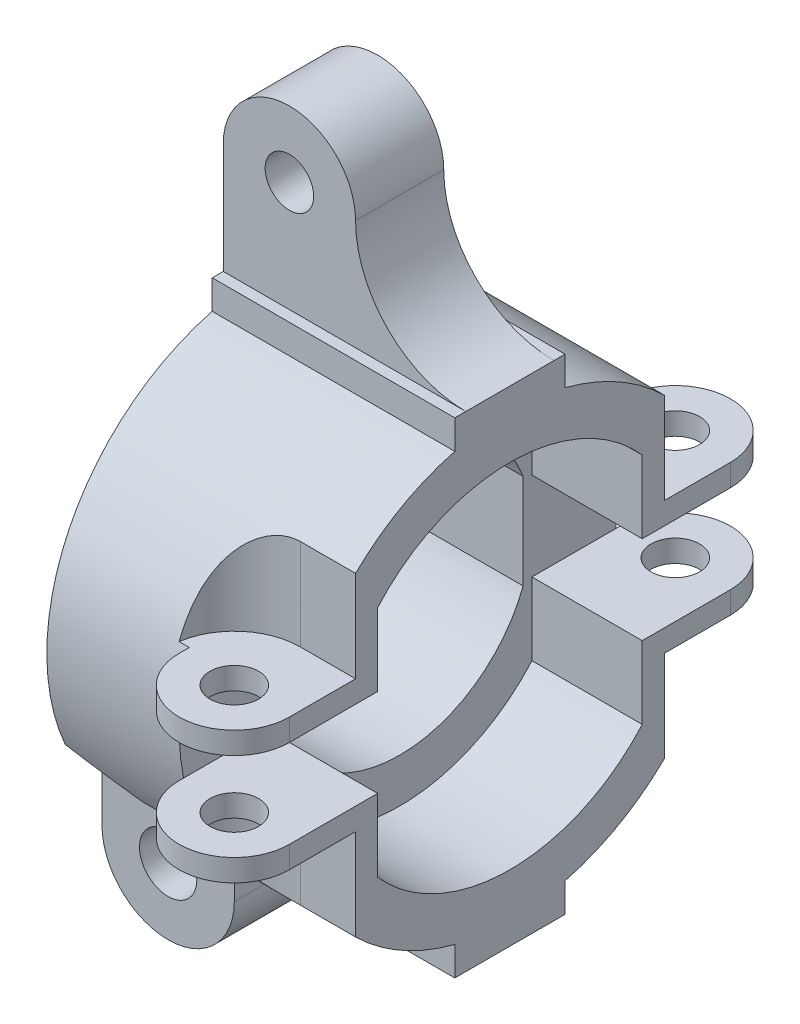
ISO-10303-21;
HEADER;
FILE_DESCRIPTION(('STEP AP214'),'2;1');
FILE_NAME('part.step','',(''),(''),'','','');
FILE_SCHEMA(('AUTOMOTIVE_DESIGN { 1 0 10303 214 1 1 1 1 }'));
ENDSEC;
DATA;
#1=APPLICATION_CONTEXT('core data for automotive mechanical design processes');
#2=APPLICATION_PROTOCOL_DEFINITION('international standard','automotive_design',2000,#1);
#3=PRODUCT_CONTEXT('',#1,'mechanical');
#4=PRODUCT('Part','Part','',(#3));
#5=PRODUCT_RELATED_PRODUCT_CATEGORY('part','',(#4));
#6=PRODUCT_DEFINITION_FORMATION('','',#4);
#7=PRODUCT_DEFINITION_CONTEXT('part definition',#1,'design');
#8=PRODUCT_DEFINITION('design','',#6,#7);
#9=PRODUCT_DEFINITION_SHAPE('','',#8);
#10=(LENGTH_UNIT() NAMED_UNIT(*) SI_UNIT(.MILLI.,.METRE.));
#11=(NAMED_UNIT(*) PLANE_ANGLE_UNIT() SI_UNIT($,.RADIAN.));
#12=(NAMED_UNIT(*) SI_UNIT($,.STERADIAN.) SOLID_ANGLE_UNIT());
#13=UNCERTAINTY_MEASURE_WITH_UNIT(LENGTH_MEASURE(1.E-05),#10,'distance_accuracy_value','');
#14=(GEOMETRIC_REPRESENTATION_CONTEXT(3) GLOBAL_UNCERTAINTY_ASSIGNED_CONTEXT((#13)) GLOBAL_UNIT_ASSIGNED_CONTEXT((#10,
#11,#12)) REPRESENTATION_CONTEXT('',''));
#15=CARTESIAN_POINT('',(0.,0.,0.));
#16=DIRECTION('',(0.,0.,1.));
#17=DIRECTION('',(1.,0.,0.));
#18=AXIS2_PLACEMENT_3D('',#15,#16,#17);
#19=CARTESIAN_POINT('',(-39.7310244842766,10.16,0.));
#20=DIRECTION('',(1.,0.,0.));
#21=DIRECTION('',(0.,0.,-1.));
#22=AXIS2_PLACEMENT_3D('',#19,#20,#21);
#23=CYLINDRICAL_SURFACE('',#22,12.7);
#24=CARTESIAN_POINT('',(3.2201749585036,13.97,12.1150278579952));
#25=CARTESIAN_POINT('',(3.22686521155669,14.1066804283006,12.0720473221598));
#26=CARTESIAN_POINT('',(3.23464449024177,14.2425935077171,12.0267595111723));
#27=CARTESIAN_POINT('',(3.25295898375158,14.5126856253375,11.931664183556));
#28=CARTESIAN_POINT('',(3.26349503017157,14.6468641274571,11.881855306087));
#29=CARTESIAN_POINT('',(3.28797177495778,14.9140144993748,11.7775226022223));
#30=CARTESIAN_POINT('',(3.30193278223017,15.0469740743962,11.7229719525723));
#31=CARTESIAN_POINT('',(3.33389583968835,15.3105501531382,11.6095827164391));
#32=CARTESIAN_POINT('',(3.35189751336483,15.4411668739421,11.5507445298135));
#33=CARTESIAN_POINT('',(3.39301555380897,15.7018503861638,11.4279913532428));
#34=CARTESIAN_POINT('',(3.4162107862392,15.83187321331,11.3640090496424));
#35=CARTESIAN_POINT('',(3.46839468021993,16.0887337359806,11.2321392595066));
#36=CARTESIAN_POINT('',(3.4973827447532,16.2155717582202,11.1642521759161));
#37=CARTESIAN_POINT('',(3.56200566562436,16.46524548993,11.0251641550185));
#38=CARTESIAN_POINT('',(3.59762287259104,16.5880908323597,10.9539723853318));
#39=CARTESIAN_POINT('',(3.67654481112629,16.8294873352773,10.8086893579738));
#40=CARTESIAN_POINT('',(3.71984658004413,16.9480401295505,10.7345992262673));
#41=CARTESIAN_POINT('',(3.80601266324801,17.1578012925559,10.5987381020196));
#42=CARTESIAN_POINT('',(3.84735467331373,17.2498781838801,10.5373430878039));
#43=CARTESIAN_POINT('',(3.93631456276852,17.4303488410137,10.4136444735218));
#44=CARTESIAN_POINT('',(3.98393292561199,17.5187423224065,10.3513408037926));
#45=CARTESIAN_POINT('',(4.08584910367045,17.6910706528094,10.2266442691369));
#46=CARTESIAN_POINT('',(4.14012730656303,17.7750175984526,10.1642521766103));
#47=CARTESIAN_POINT('',(4.25597625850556,17.9381398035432,10.0399727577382));
#48=CARTESIAN_POINT('',(4.31754681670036,18.0173151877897,9.97808541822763));
#49=CARTESIAN_POINT('',(4.44934238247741,18.1713354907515,9.85486513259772));
#50=CARTESIAN_POINT('',(4.51967853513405,18.2461023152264,9.79355276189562));
#51=CARTESIAN_POINT('',(4.66856687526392,18.3892817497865,9.67355392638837));
#52=CARTESIAN_POINT('',(4.74711684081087,18.4576960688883,9.61486675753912));
#53=CARTESIAN_POINT('',(4.91244275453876,18.5873125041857,9.50146364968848));
#54=CARTESIAN_POINT('',(4.99920881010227,18.648523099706,9.44674307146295));
#55=CARTESIAN_POINT('',(5.18076880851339,18.7629579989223,9.3426495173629));
#56=CARTESIAN_POINT('',(5.27555856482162,18.8161864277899,9.29327378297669));
#57=CARTESIAN_POINT('',(5.51006647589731,18.9323963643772,9.18387827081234));
#58=CARTESIAN_POINT('',(5.65321636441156,18.9914507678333,9.1268972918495));
#59=CARTESIAN_POINT('',(5.9510474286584,19.0908690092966,9.02964411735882));
#60=CARTESIAN_POINT('',(6.10571065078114,19.1312612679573,8.98934652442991));
#61=CARTESIAN_POINT('',(6.38139660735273,19.1841336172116,8.93621904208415));
#62=CARTESIAN_POINT('',(6.50071506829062,19.2011396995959,8.91897228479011));
#63=CARTESIAN_POINT('',(6.68135325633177,19.2181979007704,8.90163530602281));
#64=CARTESIAN_POINT('',(6.74190515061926,19.2224755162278,8.89727843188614));
#65=CARTESIAN_POINT('',(6.86329960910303,19.2281845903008,8.89145856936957));
#66=CARTESIAN_POINT('',(6.92414225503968,19.229615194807,8.88999644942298));
#67=CARTESIAN_POINT('',(6.98499999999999,19.2296141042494,8.89));
#68=B_SPLINE_CURVE_WITH_KNOTS('',3,(#24,#25,#26,#27,#28,#29,#30,#31,#32,#33,#34,#35,#36,#37,#38,
#39,#40,#41,#42,#43,#44,#45,#46,#47,#48,#49,#50,#51,#52,#53,#54,#55,#56,#57,#58,#59,#60,#61,#62,
#63,#64,#65,#66,#67),.UNSPECIFIED.,.F.,.F.,(4,2,2,2,2,2,2,2,2,2,2,2,2,2,2,2,2,2,2,2,2,4),(0.,
0.430297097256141,0.860724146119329,1.29376794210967,1.72677140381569,2.16685951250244,
2.60690228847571,3.04578983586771,3.48450854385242,3.83872221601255,4.19296318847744,
4.5461849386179,4.89939744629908,5.2576597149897,5.61582531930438,5.97356502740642,
6.33111921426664,6.82392591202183,7.31597961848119,7.68014600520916,7.86260060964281,
8.0451099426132),.UNSPECIFIED.);
#69=CARTESIAN_POINT('',(3.2201749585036,13.97,12.1150278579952));
#70=VERTEX_POINT('',#69);
#71=CARTESIAN_POINT('',(6.98499999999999,19.2296141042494,8.89));
#72=VERTEX_POINT('',#71);
#73=EDGE_CURVE('E11',#70,#72,#68,.T.);
#74=ORIENTED_EDGE('',*,*,#73,.T.);
#75=DIRECTION('',(1.,0.,0.));
#76=VECTOR('',#75,1.);
#77=CARTESIAN_POINT('',(-39.7310244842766,19.2296141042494,8.89));
#78=LINE('',#77,#76);
#79=CARTESIAN_POINT('',(10.16,19.2296141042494,8.89));
#80=VERTEX_POINT('',#79);
#81=EDGE_CURVE('E430',#72,#80,#78,.T.);
#82=ORIENTED_EDGE('',*,*,#81,.T.);
#83=CARTESIAN_POINT('',(10.16,10.16,0.));
#84=DIRECTION('',(1.,0.,0.));
#85=DIRECTION('',(0.,0.,1.));
#86=AXIS2_PLACEMENT_3D('',#83,#84,#85);
#87=CIRCLE('',#86,12.7);
#88=CARTESIAN_POINT('',(10.16,22.4567221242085,3.175));
#89=VERTEX_POINT('',#88);
#90=EDGE_CURVE('E882',#89,#80,#87,.T.);
#91=ORIENTED_EDGE('',*,*,#90,.F.);
#92=DIRECTION('',(1.,0.,0.));
#93=VECTOR('',#92,1.);
#94=CARTESIAN_POINT('',(-39.7310244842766,22.4567221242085,3.175));
#95=LINE('',#94,#93);
#96=CARTESIAN_POINT('',(-3.81,22.4567221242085,3.175));
#97=VERTEX_POINT('',#96);
#98=EDGE_CURVE('E753',#97,#89,#95,.T.);
#99=ORIENTED_EDGE('',*,*,#98,.F.);
#100=CARTESIAN_POINT('',(-3.81,10.16,0.));
#101=DIRECTION('',(1.,0.,0.));
#102=DIRECTION('',(0.,0.,-1.));
#103=AXIS2_PLACEMENT_3D('',#100,#101,#102);
#104=CIRCLE('',#103,12.7);
#105=CARTESIAN_POINT('',(-3.81,5.08,11.6397422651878));
#106=VERTEX_POINT('',#105);
#107=EDGE_CURVE('E949',#106,#97,#104,.F.);
#108=ORIENTED_EDGE('',*,*,#107,.F.);
#109=CARTESIAN_POINT('',(-19.05,10.16,0.));
#110=DIRECTION('',(-0.316227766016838,-0.948683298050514,0.));
#111=DIRECTION('',(0.948683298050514,-0.316227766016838,0.));
#112=AXIS2_PLACEMENT_3D('',#109,#110,#111);
#113=ELLIPSE('',#112,40.1609262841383,12.7);
#114=CARTESIAN_POINT('',(0.,3.81,10.9985226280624));
#115=VERTEX_POINT('',#114);
#116=EDGE_CURVE('E1047',#106,#115,#113,.F.);
#117=ORIENTED_EDGE('',*,*,#116,.T.);
#118=DIRECTION('',(1.,0.,0.));
#119=VECTOR('',#118,1.);
#120=CARTESIAN_POINT('',(-39.7310244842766,3.81,10.9985226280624));
#121=LINE('',#120,#119);
#122=CARTESIAN_POINT('',(3.57603025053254,3.81,10.9985226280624));
#123=VERTEX_POINT('',#122);
#124=EDGE_CURVE('E1050',#115,#123,#121,.T.);
#125=ORIENTED_EDGE('',*,*,#124,.T.);
#126=CARTESIAN_POINT('',(6.985,1.09038589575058,8.89));
#127=CARTESIAN_POINT('',(6.90233562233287,1.09037743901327,8.88998149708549));
#128=CARTESIAN_POINT('',(6.81968076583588,1.09302264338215,8.89268978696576));
#129=CARTESIAN_POINT('',(6.65508686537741,1.10355402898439,8.9034200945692));
#130=CARTESIAN_POINT('',(6.57314753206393,1.1114379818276,8.91143985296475));
#131=CARTESIAN_POINT('',(6.41107303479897,1.13232096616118,8.93259303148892));
#132=CARTESIAN_POINT('',(6.33093025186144,1.145290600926,8.94569705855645));
#133=CARTESIAN_POINT('',(6.1725868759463,1.17621048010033,8.97674799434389));
#134=CARTESIAN_POINT('',(6.09438639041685,1.19416099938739,8.9946951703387));
#135=CARTESIAN_POINT('',(5.8637258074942,1.25521059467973,9.05527673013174));
#136=CARTESIAN_POINT('',(5.71485453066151,1.30555364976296,9.10469904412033));
#137=CARTESIAN_POINT('',(5.43032507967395,1.42382669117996,9.21824012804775));
#138=CARTESIAN_POINT('',(5.29468118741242,1.49177540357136,9.28237453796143));
#139=CARTESIAN_POINT('',(5.0325512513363,1.6467282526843,9.42474186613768));
#140=CARTESIAN_POINT('',(4.90679165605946,1.73447580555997,9.50349440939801));
#141=CARTESIAN_POINT('',(4.67254541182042,1.92449832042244,9.66862641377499));
#142=CARTESIAN_POINT('',(4.56406403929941,2.02677770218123,9.75500819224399));
#143=CARTESIAN_POINT('',(4.38373278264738,2.22197328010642,9.91414796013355));
#144=CARTESIAN_POINT('',(4.30888371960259,2.31272895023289,9.98621385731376));
#145=CARTESIAN_POINT('',(4.16928358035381,2.50102120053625,10.1313460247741));
#146=CARTESIAN_POINT('',(4.10453743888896,2.59856106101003,10.2044127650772));
#147=CARTESIAN_POINT('',(3.98426917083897,2.7996360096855,10.3503870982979));
#148=CARTESIAN_POINT('',(3.92876718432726,2.90318354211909,10.4232940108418));
#149=CARTESIAN_POINT('',(3.82625074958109,3.11528805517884,10.5678061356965));
#150=CARTESIAN_POINT('',(3.77923925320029,3.22384676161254,10.6394108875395));
#151=CARTESIAN_POINT('',(3.66814721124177,3.50843432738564,10.820771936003));
#152=CARTESIAN_POINT('',(3.60962786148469,3.68762498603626,10.9289905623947));
#153=CARTESIAN_POINT('',(3.50792104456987,4.05446961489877,11.1380956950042));
#154=CARTESIAN_POINT('',(3.46474405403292,4.24212927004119,11.23897715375));
#155=CARTESIAN_POINT('',(3.39067401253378,4.62435053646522,11.4320809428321));
#156=CARTESIAN_POINT('',(3.3597909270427,4.81891760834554,11.5242962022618));
#157=CARTESIAN_POINT('',(3.30769599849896,5.21347227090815,11.6990773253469));
#158=CARTESIAN_POINT('',(3.28648010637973,5.4134575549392,11.7816472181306));
#159=CARTESIAN_POINT('',(3.25844708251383,5.73678015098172,11.9055431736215));
#160=CARTESIAN_POINT('',(3.24926788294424,5.85868592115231,11.9501278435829));
#161=CARTESIAN_POINT('',(3.23315777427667,6.10351873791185,12.0354356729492));
#162=CARTESIAN_POINT('',(3.22621926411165,6.22644084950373,12.0761715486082));
#163=CARTESIAN_POINT('',(3.2201749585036,6.35,12.1150278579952));
#164=B_SPLINE_CURVE_WITH_KNOTS('',3,(#126,#127,#128,#129,#130,#131,#132,#133,#134,#135,#136,
#137,#138,#139,#140,#141,#142,#143,#144,#145,#146,#147,#148,#149,#150,#151,#152,#153,#154,#155,
#156,#157,#158,#159,#160,#161,#162,#163),.UNSPECIFIED.,.F.,.F.,(4,2,2,2,2,2,2,2,2,2,2,2,2,2,2,2,
2,2,4),(0.,0.247890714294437,0.495676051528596,0.742049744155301,0.98843703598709,
1.48015127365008,1.97239068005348,2.48768419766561,3.00313477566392,3.41644877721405,
3.82996403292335,4.24436874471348,4.65891725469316,5.30994579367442,5.96141804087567,
6.61341730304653,7.2651432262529,7.65545278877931,8.04442404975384),.UNSPECIFIED.);
#165=CARTESIAN_POINT('',(3.2201749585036,6.35,12.1150278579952));
#166=VERTEX_POINT('',#165);
#167=EDGE_CURVE('E485',#123,#166,#164,.T.);
#168=ORIENTED_EDGE('',*,*,#167,.T.);
#169=DIRECTION('',(1.,0.,0.));
#170=VECTOR('',#169,1.);
#171=CARTESIAN_POINT('',(-39.7310244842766,6.35,12.1150278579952));
#172=LINE('',#171,#170);
#173=CARTESIAN_POINT('',(3.81,6.35,12.1150278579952));
#174=VERTEX_POINT('',#173);
#175=EDGE_CURVE('E482',#166,#174,#172,.T.);
#176=ORIENTED_EDGE('',*,*,#175,.T.);
#177=CARTESIAN_POINT('',(3.81,10.16,0.));
#178=DIRECTION('',(-1.,0.,0.));
#179=DIRECTION('',(0.,0.,1.));
#180=AXIS2_PLACEMENT_3D('',#177,#178,#179);
#181=CIRCLE('',#180,12.7);
#182=CARTESIAN_POINT('',(3.81,7.62,12.4434078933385));
#183=VERTEX_POINT('',#182);
#184=EDGE_CURVE('E1152',#183,#174,#181,.F.);
#185=ORIENTED_EDGE('',*,*,#184,.F.);
#186=CARTESIAN_POINT('',(3.81,10.16,0.));
#187=DIRECTION('',(1.,0.,0.));
#188=DIRECTION('',(0.,0.,-1.));
#189=AXIS2_PLACEMENT_3D('',#186,#187,#188);
#190=CIRCLE('',#189,12.7);
#191=CARTESIAN_POINT('',(3.81,12.7,12.4434078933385));
#192=VERTEX_POINT('',#191);
#193=EDGE_CURVE('E950',#192,#183,#190,.T.);
#194=ORIENTED_EDGE('',*,*,#193,.F.);
#195=CARTESIAN_POINT('',(3.80999999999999,10.16,0.));
#196=DIRECTION('',(-1.,0.,0.));
#197=DIRECTION('',(0.,0.,1.));
#198=AXIS2_PLACEMENT_3D('',#195,#196,#197);
#199=CIRCLE('',#198,12.7);
#200=CARTESIAN_POINT('',(3.80999999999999,13.97,12.1150278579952));
#201=VERTEX_POINT('',#200);
#202=EDGE_CURVE('E694',#201,#192,#199,.F.);
#203=ORIENTED_EDGE('',*,*,#202,.F.);
#204=DIRECTION('',(1.,0.,0.));
#205=VECTOR('',#204,1.);
#206=CARTESIAN_POINT('',(-39.7310244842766,13.97,12.1150278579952));
#207=LINE('',#206,#205);
#208=EDGE_CURVE('E457',#201,#70,#207,.F.);
#209=ORIENTED_EDGE('',*,*,#208,.T.);
#210=EDGE_LOOP('',(#74,#82,#91,#99,#108,#117,#125,#168,#176,#185,#194,#203,#209));
#211=FACE_BOUND('',#210,.T.);
#212=ADVANCED_FACE('F32',(#211),#23,.T.);
#213=CARTESIAN_POINT('',(10.16,19.2296141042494,-8.89));
#214=VERTEX_POINT('',#213);
#215=CARTESIAN_POINT('',(10.16,22.4567221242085,-3.175));
#216=VERTEX_POINT('',#215);
#217=EDGE_CURVE('E879',#214,#216,#87,.T.);
#218=ORIENTED_EDGE('',*,*,#217,.F.);
#219=DIRECTION('',(1.,0.,0.));
#220=VECTOR('',#219,1.);
#221=CARTESIAN_POINT('',(-39.7310244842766,19.2296141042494,-8.89));
#222=LINE('',#221,#220);
#223=CARTESIAN_POINT('',(6.985,19.2296141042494,-8.89));
#224=VERTEX_POINT('',#223);
#225=EDGE_CURVE('E459',#214,#224,#222,.F.);
#226=ORIENTED_EDGE('',*,*,#225,.T.);
#227=CARTESIAN_POINT('',(6.985,19.2296141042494,-8.89));
#228=CARTESIAN_POINT('',(6.90233562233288,19.2296225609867,-8.8899814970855));
#229=CARTESIAN_POINT('',(6.81968076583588,19.2269773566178,-8.89268978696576));
#230=CARTESIAN_POINT('',(6.65508686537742,19.2164459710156,-8.9034200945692));
#231=CARTESIAN_POINT('',(6.57314753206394,19.2085620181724,-8.91143985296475));
#232=CARTESIAN_POINT('',(6.41107303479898,19.1876790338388,-8.93259303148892));
#233=CARTESIAN_POINT('',(6.33093025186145,19.174709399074,-8.94569705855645));
#234=CARTESIAN_POINT('',(6.17258687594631,19.1437895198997,-8.97674799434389));
#235=CARTESIAN_POINT('',(6.09438639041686,19.1258390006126,-8.99469517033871));
#236=CARTESIAN_POINT('',(5.86372580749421,19.0647894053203,-9.05527673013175));
#237=CARTESIAN_POINT('',(5.71485453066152,19.014446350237,-9.10469904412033));
#238=CARTESIAN_POINT('',(5.43032507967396,18.89617330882,-9.21824012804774));
#239=CARTESIAN_POINT('',(5.29468118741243,18.8282245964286,-9.28237453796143));
#240=CARTESIAN_POINT('',(5.03255125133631,18.6732717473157,-9.42474186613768));
#241=CARTESIAN_POINT('',(4.90679165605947,18.58552419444,-9.50349440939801));
#242=CARTESIAN_POINT('',(4.67254541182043,18.3955016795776,-9.66862641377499));
#243=CARTESIAN_POINT('',(4.56406403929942,18.2932222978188,-9.75500819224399));
#244=CARTESIAN_POINT('',(4.38373278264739,18.0980267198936,-9.91414796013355));
#245=CARTESIAN_POINT('',(4.3088837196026,18.0072710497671,-9.98621385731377));
#246=CARTESIAN_POINT('',(4.16928358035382,17.8189787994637,-10.1313460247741));
#247=CARTESIAN_POINT('',(4.10453743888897,17.72143893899,-10.2044127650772));
#248=CARTESIAN_POINT('',(3.98426917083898,17.5203639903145,-10.3503870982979));
#249=CARTESIAN_POINT('',(3.92876718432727,17.4168164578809,-10.4232940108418));
#250=CARTESIAN_POINT('',(3.8262507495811,17.2047119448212,-10.5678061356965));
#251=CARTESIAN_POINT('',(3.7792392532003,17.0961532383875,-10.6394108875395));
#252=CARTESIAN_POINT('',(3.66814721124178,16.8115656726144,-10.820771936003));
#253=CARTESIAN_POINT('',(3.6096278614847,16.6323750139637,-10.9289905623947));
#254=CARTESIAN_POINT('',(3.50792104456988,16.2655303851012,-11.1380956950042));
#255=CARTESIAN_POINT('',(3.46474405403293,16.0778707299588,-11.23897715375));
#256=CARTESIAN_POINT('',(3.39067401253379,15.6956494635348,-11.4320809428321));
#257=CARTESIAN_POINT('',(3.35979092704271,15.5010823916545,-11.5242962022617));
#258=CARTESIAN_POINT('',(3.30769599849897,15.1065277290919,-11.6990773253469));
#259=CARTESIAN_POINT('',(3.28648010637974,14.9065424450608,-11.7816472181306));
#260=CARTESIAN_POINT('',(3.25844708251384,14.5832198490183,-11.9055431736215));
#261=CARTESIAN_POINT('',(3.24926788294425,14.4613140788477,-11.9501278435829));
#262=CARTESIAN_POINT('',(3.23315777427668,14.2164812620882,-12.0354356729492));
#263=CARTESIAN_POINT('',(3.22621926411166,14.0935591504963,-12.0761715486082));
#264=CARTESIAN_POINT('',(3.22017495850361,13.97,-12.1150278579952));
#265=B_SPLINE_CURVE_WITH_KNOTS('',3,(#227,#228,#229,#230,#231,#232,#233,#234,#235,#236,#237,
#238,#239,#240,#241,#242,#243,#244,#245,#246,#247,#248,#249,#250,#251,#252,#253,#254,#255,#256,
#257,#258,#259,#260,#261,#262,#263,#264),.UNSPECIFIED.,.F.,.F.,(4,2,2,2,2,2,2,2,2,2,2,2,2,2,2,2,
2,2,4),(0.,0.247890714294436,0.495676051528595,0.7420497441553,0.98843703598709,
1.48015127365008,1.97239068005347,2.4876841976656,3.00313477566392,3.41644877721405,
3.82996403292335,4.24436874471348,4.65891725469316,5.30994579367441,5.96141804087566,
6.61341730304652,7.26514322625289,7.65545278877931,8.04442404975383),.UNSPECIFIED.);
#266=CARTESIAN_POINT('',(3.22017495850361,13.97,-12.1150278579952));
#267=VERTEX_POINT('',#266);
#268=EDGE_CURVE('E41',#224,#267,#265,.T.);
#269=ORIENTED_EDGE('',*,*,#268,.T.);
#270=DIRECTION('',(1.,0.,0.));
#271=VECTOR('',#270,1.);
#272=CARTESIAN_POINT('',(-39.7310244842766,13.97,-12.1150278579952));
#273=LINE('',#272,#271);
#274=CARTESIAN_POINT('',(3.81,13.97,-12.1150278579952));
#275=VERTEX_POINT('',#274);
#276=EDGE_CURVE('E433',#267,#275,#273,.T.);
#277=ORIENTED_EDGE('',*,*,#276,.T.);
#278=CARTESIAN_POINT('',(3.80999999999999,10.16,0.));
#279=DIRECTION('',(-1.,0.,0.));
#280=DIRECTION('',(0.,0.,1.));
#281=AXIS2_PLACEMENT_3D('',#278,#279,#280);
#282=CIRCLE('',#281,12.7);
#283=CARTESIAN_POINT('',(3.81,12.7,-12.4434078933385));
#284=VERTEX_POINT('',#283);
#285=EDGE_CURVE('E711',#284,#275,#282,.F.);
#286=ORIENTED_EDGE('',*,*,#285,.F.);
#287=CARTESIAN_POINT('',(3.81,7.62,-12.4434078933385));
#288=VERTEX_POINT('',#287);
#289=EDGE_CURVE('E946',#288,#284,#190,.T.);
#290=ORIENTED_EDGE('',*,*,#289,.F.);
#291=CARTESIAN_POINT('',(3.81,10.16,0.));
#292=DIRECTION('',(-1.,0.,0.));
#293=DIRECTION('',(0.,0.,1.));
#294=AXIS2_PLACEMENT_3D('',#291,#292,#293);
#295=CIRCLE('',#294,12.7);
#296=CARTESIAN_POINT('',(3.81,6.35,-12.1150278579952));
#297=VERTEX_POINT('',#296);
#298=EDGE_CURVE('E1132',#297,#288,#295,.F.);
#299=ORIENTED_EDGE('',*,*,#298,.F.);
#300=DIRECTION('',(1.,0.,0.));
#301=VECTOR('',#300,1.);
#302=CARTESIAN_POINT('',(-39.7310244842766,6.35,-12.1150278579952));
#303=LINE('',#302,#301);
#304=CARTESIAN_POINT('',(3.22017495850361,6.35,-12.1150278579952));
#305=VERTEX_POINT('',#304);
#306=EDGE_CURVE('E473',#297,#305,#303,.F.);
#307=ORIENTED_EDGE('',*,*,#306,.T.);
#308=CARTESIAN_POINT('',(3.22017495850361,6.35,-12.1150278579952));
#309=CARTESIAN_POINT('',(3.2268652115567,6.21331957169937,-12.0720473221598));
#310=CARTESIAN_POINT('',(3.23464449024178,6.07740649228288,-12.0267595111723));
#311=CARTESIAN_POINT('',(3.25295898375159,5.80731437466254,-11.931664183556));
#312=CARTESIAN_POINT('',(3.26349503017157,5.67313587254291,-11.881855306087));
#313=CARTESIAN_POINT('',(3.28797177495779,5.40598550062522,-11.7775226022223));
#314=CARTESIAN_POINT('',(3.30193278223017,5.27302592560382,-11.7229719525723));
#315=CARTESIAN_POINT('',(3.33389583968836,5.00944984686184,-11.6095827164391));
#316=CARTESIAN_POINT('',(3.35189751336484,4.87883312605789,-11.5507445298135));
#317=CARTESIAN_POINT('',(3.39301555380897,4.61814961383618,-11.4279913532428));
#318=CARTESIAN_POINT('',(3.41621078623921,4.48812678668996,-11.3640090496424));
#319=CARTESIAN_POINT('',(3.46839468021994,4.23126626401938,-11.2321392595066));
#320=CARTESIAN_POINT('',(3.49738274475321,4.10442824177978,-11.1642521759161));
#321=CARTESIAN_POINT('',(3.56200566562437,3.85475451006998,-11.0251641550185));
#322=CARTESIAN_POINT('',(3.59762287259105,3.73190916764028,-10.9539723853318));
#323=CARTESIAN_POINT('',(3.6765448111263,3.4905126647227,-10.8086893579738));
#324=CARTESIAN_POINT('',(3.71984658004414,3.37195987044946,-10.7345992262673));
#325=CARTESIAN_POINT('',(3.80601266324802,3.16219870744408,-10.5987381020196));
#326=CARTESIAN_POINT('',(3.84735467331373,3.07012181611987,-10.5373430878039));
#327=CARTESIAN_POINT('',(3.93631456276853,2.88965115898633,-10.4136444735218));
#328=CARTESIAN_POINT('',(3.983932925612,2.80125767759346,-10.3513408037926));
#329=CARTESIAN_POINT('',(4.08584910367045,2.62892934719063,-10.2266442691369));
#330=CARTESIAN_POINT('',(4.14012730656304,2.54498240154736,-10.1642521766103));
#331=CARTESIAN_POINT('',(4.25597625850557,2.38186019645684,-10.0399727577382));
#332=CARTESIAN_POINT('',(4.31754681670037,2.30268481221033,-9.97808541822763));
#333=CARTESIAN_POINT('',(4.44934238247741,2.14866450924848,-9.85486513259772));
#334=CARTESIAN_POINT('',(4.51967853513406,2.07389768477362,-9.79355276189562));
#335=CARTESIAN_POINT('',(4.66856687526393,1.9307182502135,-9.67355392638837));
#336=CARTESIAN_POINT('',(4.74711684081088,1.8623039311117,-9.61486675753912));
#337=CARTESIAN_POINT('',(4.91244275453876,1.73268749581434,-9.50146364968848));
#338=CARTESIAN_POINT('',(4.99920881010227,1.67147690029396,-9.44674307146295));
#339=CARTESIAN_POINT('',(5.1807688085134,1.55704200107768,-9.3426495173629));
#340=CARTESIAN_POINT('',(5.27555856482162,1.50381357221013,-9.29327378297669));
#341=CARTESIAN_POINT('',(5.51006647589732,1.38760363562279,-9.18387827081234));
#342=CARTESIAN_POINT('',(5.65321636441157,1.32854923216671,-9.1268972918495));
#343=CARTESIAN_POINT('',(5.95104742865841,1.22913099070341,-9.02964411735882));
#344=CARTESIAN_POINT('',(6.10571065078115,1.18873873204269,-8.98934652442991));
#345=CARTESIAN_POINT('',(6.38139660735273,1.13586638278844,-8.93621904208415));
#346=CARTESIAN_POINT('',(6.50071506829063,1.11886030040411,-8.91897228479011));
#347=CARTESIAN_POINT('',(6.68135325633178,1.10180209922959,-8.90163530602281));
#348=CARTESIAN_POINT('',(6.74190515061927,1.09752448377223,-8.89727843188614));
#349=CARTESIAN_POINT('',(6.86329960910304,1.09181540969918,-8.89145856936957));
#350=CARTESIAN_POINT('',(6.92414225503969,1.09038480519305,-8.88999644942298));
#351=CARTESIAN_POINT('',(6.985,1.09038589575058,-8.89));
#352=B_SPLINE_CURVE_WITH_KNOTS('',3,(#308,#309,#310,#311,#312,#313,#314,#315,#316,#317,#318,
#319,#320,#321,#322,#323,#324,#325,#326,#327,#328,#329,#330,#331,#332,#333,#334,#335,#336,#337,
#338,#339,#340,#341,#342,#343,#344,#345,#346,#347,#348,#349,#350,#351),.UNSPECIFIED.,.F.,.F.,(4,
2,2,2,2,2,2,2,2,2,2,2,2,2,2,2,2,2,2,2,2,4),(0.,0.430297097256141,0.860724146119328,
1.29376794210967,1.72677140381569,2.16685951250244,2.60690228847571,3.04578983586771,
3.48450854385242,3.83872221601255,4.19296318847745,4.5461849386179,4.89939744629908,
5.2576597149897,5.61582531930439,5.97356502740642,6.33111921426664,6.82392591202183,
7.3159796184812,7.68014600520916,7.86260060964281,8.0451099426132),.UNSPECIFIED.);
#353=CARTESIAN_POINT('',(3.57603025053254,3.81,-10.9985226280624));
#354=VERTEX_POINT('',#353);
#355=EDGE_CURVE('E1113',#305,#354,#352,.T.);
#356=ORIENTED_EDGE('',*,*,#355,.T.);
#357=DIRECTION('',(1.,0.,0.));
#358=VECTOR('',#357,1.);
#359=CARTESIAN_POINT('',(-39.7310244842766,3.81,-10.9985226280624));
#360=LINE('',#359,#358);
#361=CARTESIAN_POINT('',(0.,3.81,-10.9985226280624));
#362=VERTEX_POINT('',#361);
#363=EDGE_CURVE('E1053',#362,#354,#360,.T.);
#364=ORIENTED_EDGE('',*,*,#363,.F.);
#365=CARTESIAN_POINT('',(-19.05,10.16,0.));
#366=DIRECTION('',(0.316227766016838,0.948683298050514,0.));
#367=DIRECTION('',(0.948683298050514,-0.316227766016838,0.));
#368=AXIS2_PLACEMENT_3D('',#365,#366,#367);
#369=ELLIPSE('',#368,40.1609262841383,12.7);
#370=CARTESIAN_POINT('',(-3.81,5.08,-11.6397422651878));
#371=VERTEX_POINT('',#370);
#372=EDGE_CURVE('E1056',#371,#362,#369,.F.);
#373=ORIENTED_EDGE('',*,*,#372,.F.);
#374=CARTESIAN_POINT('',(-3.81,22.4567221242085,-3.175));
#375=VERTEX_POINT('',#374);
#376=EDGE_CURVE('E947',#375,#371,#104,.F.);
#377=ORIENTED_EDGE('',*,*,#376,.F.);
#378=DIRECTION('',(1.,0.,0.));
#379=VECTOR('',#378,1.);
#380=CARTESIAN_POINT('',(-39.7310244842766,22.4567221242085,-3.175));
#381=LINE('',#380,#379);
#382=EDGE_CURVE('E747',#216,#375,#381,.F.);
#383=ORIENTED_EDGE('',*,*,#382,.F.);
#384=EDGE_LOOP('',(#218,#226,#269,#277,#286,#290,#299,#307,#356,#364,#373,#377,#383));
#385=FACE_BOUND('',#384,.T.);
#386=ADVANCED_FACE('F626',(#385),#23,.T.);
#387=CARTESIAN_POINT('',(10.16,10.16,0.));
#388=DIRECTION('',(-1.,0.,0.));
#389=DIRECTION('',(0.,0.,1.));
#390=AXIS2_PLACEMENT_3D('',#387,#388,#389);
#391=PLANE('',#390);
#392=DIRECTION('',(0.,1.,0.));
#393=VECTOR('',#392,1.);
#394=CARTESIAN_POINT('',(10.16,10.16,8.89));
#395=LINE('',#394,#393);
#396=CARTESIAN_POINT('',(10.16,13.97,8.89));
#397=VERTEX_POINT('',#396);
#398=EDGE_CURVE('E1080',#397,#80,#395,.T.);
#399=ORIENTED_EDGE('',*,*,#398,.F.);
#400=DIRECTION('',(0.,0.,1.));
#401=VECTOR('',#400,1.);
#402=CARTESIAN_POINT('',(10.16,13.97,12.7));
#403=LINE('',#402,#401);
#404=CARTESIAN_POINT('',(10.16,13.97,12.7));
#405=VERTEX_POINT('',#404);
#406=EDGE_CURVE('E441',#397,#405,#403,.T.);
#407=ORIENTED_EDGE('',*,*,#406,.T.);
#408=DIRECTION('',(0.,-1.,0.));
#409=VECTOR('',#408,1.);
#410=CARTESIAN_POINT('',(10.16,13.97,12.7));
#411=LINE('',#410,#409);
#412=CARTESIAN_POINT('',(10.16,12.7,12.7));
#413=VERTEX_POINT('',#412);
#414=EDGE_CURVE('E713',#405,#413,#411,.T.);
#415=ORIENTED_EDGE('',*,*,#414,.T.);
#416=DIRECTION('',(0.,0.,-1.));
#417=VECTOR('',#416,1.);
#418=CARTESIAN_POINT('',(10.16,12.7,12.4434078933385));
#419=LINE('',#418,#417);
#420=CARTESIAN_POINT('',(10.16,12.7,7.62));
#421=VERTEX_POINT('',#420);
#422=EDGE_CURVE('E881',#413,#421,#419,.T.);
#423=ORIENTED_EDGE('',*,*,#422,.T.);
#424=DIRECTION('',(0.,-1.,0.));
#425=VECTOR('',#424,1.);
#426=CARTESIAN_POINT('',(10.16,12.7,7.62));
#427=LINE('',#426,#425);
#428=CARTESIAN_POINT('',(10.16,16.8802083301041,7.62));
#429=VERTEX_POINT('',#428);
#430=EDGE_CURVE('E840',#429,#421,#427,.T.);
#431=ORIENTED_EDGE('',*,*,#430,.F.);
#432=CARTESIAN_POINT('',(10.16,10.16,0.));
#433=DIRECTION('',(-1.,0.,0.));
#434=DIRECTION('',(0.,0.,1.));
#435=AXIS2_PLACEMENT_3D('',#432,#433,#434);
#436=CIRCLE('',#435,10.16);
#437=CARTESIAN_POINT('',(10.16,16.8802083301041,-7.62));
#438=VERTEX_POINT('',#437);
#439=EDGE_CURVE('E884',#429,#438,#436,.T.);
#440=ORIENTED_EDGE('',*,*,#439,.T.);
#441=DIRECTION('',(0.,1.,0.));
#442=VECTOR('',#441,1.);
#443=CARTESIAN_POINT('',(10.16,12.7,-7.62));
#444=LINE('',#443,#442);
#445=CARTESIAN_POINT('',(10.16,12.7,-7.62));
#446=VERTEX_POINT('',#445);
#447=EDGE_CURVE('E817',#446,#438,#444,.T.);
#448=ORIENTED_EDGE('',*,*,#447,.F.);
#449=DIRECTION('',(0.,0.,-1.));
#450=VECTOR('',#449,1.);
#451=CARTESIAN_POINT('',(10.16,12.7,-9.83737769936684));
#452=LINE('',#451,#450);
#453=CARTESIAN_POINT('',(10.16,12.7,-12.7));
#454=VERTEX_POINT('',#453);
#455=EDGE_CURVE('E886',#446,#454,#452,.T.);
#456=ORIENTED_EDGE('',*,*,#455,.T.);
#457=DIRECTION('',(0.,-1.,0.));
#458=VECTOR('',#457,1.);
#459=CARTESIAN_POINT('',(10.16,13.97,-12.7));
#460=LINE('',#459,#458);
#461=CARTESIAN_POINT('',(10.16,13.97,-12.7));
#462=VERTEX_POINT('',#461);
#463=EDGE_CURVE('E1165',#462,#454,#460,.T.);
#464=ORIENTED_EDGE('',*,*,#463,.F.);
#465=DIRECTION('',(0.,0.,1.));
#466=VECTOR('',#465,1.);
#467=CARTESIAN_POINT('',(10.16,13.97,-8.91809074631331));
#468=LINE('',#467,#466);
#469=CARTESIAN_POINT('',(10.16,13.97,-8.89));
#470=VERTEX_POINT('',#469);
#471=EDGE_CURVE('E49',#462,#470,#468,.T.);
#472=ORIENTED_EDGE('',*,*,#471,.T.);
#473=DIRECTION('',(0.,-1.,0.));
#474=VECTOR('',#473,1.);
#475=CARTESIAN_POINT('',(10.16,10.16,-8.89));
#476=LINE('',#475,#474);
#477=EDGE_CURVE('E1077',#214,#470,#476,.T.);
#478=ORIENTED_EDGE('',*,*,#477,.F.);
#479=ORIENTED_EDGE('',*,*,#217,.T.);
#480=DIRECTION('',(0.,-1.,0.));
#481=VECTOR('',#480,1.);
#482=CARTESIAN_POINT('',(10.16,20.32,-3.175));
#483=LINE('',#482,#481);
#484=CARTESIAN_POINT('',(10.16,24.13,-3.175));
#485=VERTEX_POINT('',#484);
#486=EDGE_CURVE('E726',#485,#216,#483,.T.);
#487=ORIENTED_EDGE('',*,*,#486,.F.);
#488=DIRECTION('',(0.,0.,-1.));
#489=VECTOR('',#488,1.);
#490=CARTESIAN_POINT('',(10.16,24.13,3.175));
#491=LINE('',#490,#489);
#492=CARTESIAN_POINT('',(10.16,24.13,-2.54));
#493=VERTEX_POINT('',#492);
#494=EDGE_CURVE('E736',#493,#485,#491,.T.);
#495=ORIENTED_EDGE('',*,*,#494,.F.);
#496=CARTESIAN_POINT('',(10.16,24.13,2.54));
#497=VERTEX_POINT('',#496);
#498=EDGE_CURVE('E735',#497,#493,#491,.T.);
#499=ORIENTED_EDGE('',*,*,#498,.F.);
#500=CARTESIAN_POINT('',(10.16,24.13,3.175));
#501=VERTEX_POINT('',#500);
#502=EDGE_CURVE('E730',#501,#497,#491,.T.);
#503=ORIENTED_EDGE('',*,*,#502,.F.);
#504=DIRECTION('',(0.,1.,0.));
#505=VECTOR('',#504,1.);
#506=CARTESIAN_POINT('',(10.16,20.32,3.175));
#507=LINE('',#506,#505);
#508=EDGE_CURVE('E729',#89,#501,#507,.T.);
#509=ORIENTED_EDGE('',*,*,#508,.F.);
#510=ORIENTED_EDGE('',*,*,#90,.T.);
#511=EDGE_LOOP('',(#399,#407,#415,#423,#431,#440,#448,#456,#464,#472,#478,#479,#487,#495,#499,
#503,#509,#510));
#512=FACE_BOUND('',#511,.T.);
#513=ADVANCED_FACE('F622',(#512),#391,.F.);
#514=DIRECTION('',(1.,0.,0.));
#515=VECTOR('',#514,1.);
#516=CARTESIAN_POINT('',(-39.7310244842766,1.09038589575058,8.89));
#517=LINE('',#516,#515);
#518=CARTESIAN_POINT('',(10.16,1.09038589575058,8.89));
#519=VERTEX_POINT('',#518);
#520=CARTESIAN_POINT('',(6.98499999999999,1.09038589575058,8.89));
#521=VERTEX_POINT('',#520);
#522=EDGE_CURVE('E494',#519,#521,#517,.F.);
#523=ORIENTED_EDGE('',*,*,#522,.T.);
#524=CARTESIAN_POINT('',(3.81,3.15583222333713,10.5939432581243));
#525=VERTEX_POINT('',#524);
#526=EDGE_CURVE('E493',#521,#525,#164,.T.);
#527=ORIENTED_EDGE('',*,*,#526,.T.);
#528=CARTESIAN_POINT('',(3.81,10.16,0.));
#529=DIRECTION('',(1.,0.,0.));
#530=DIRECTION('',(0.,0.,-1.));
#531=AXIS2_PLACEMENT_3D('',#528,#529,#530);
#532=CIRCLE('',#531,12.7);
#533=CARTESIAN_POINT('',(3.81,1.75973958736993,9.525));
#534=VERTEX_POINT('',#533);
#535=EDGE_CURVE('E907',#525,#534,#532,.T.);
#536=ORIENTED_EDGE('',*,*,#535,.T.);
#537=CARTESIAN_POINT('',(3.81,0.,7.62));
#538=VERTEX_POINT('',#537);
#539=EDGE_CURVE('E908',#534,#538,#532,.T.);
#540=ORIENTED_EDGE('',*,*,#539,.T.);
#541=CARTESIAN_POINT('',(-3.81,0.,7.62));
#542=CARTESIAN_POINT('',(-3.81000262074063,-0.160902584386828,7.40545859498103));
#543=CARTESIAN_POINT('',(-3.79982864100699,-0.315035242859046,7.18576166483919));
#544=CARTESIAN_POINT('',(-3.76398485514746,-0.608612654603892,6.73786660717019));
#545=CARTESIAN_POINT('',(-3.73830042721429,-0.748043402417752,6.50966064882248));
#546=CARTESIAN_POINT('',(-3.67557971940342,-1.01229222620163,6.04497117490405));
#547=CARTESIAN_POINT('',(-3.63848758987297,-1.1370341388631,5.80845212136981));
#548=CARTESIAN_POINT('',(-3.55698038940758,-1.37088144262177,5.32915400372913));
#549=CARTESIAN_POINT('',(-3.5125670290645,-1.47999047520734,5.08637641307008));
#550=CARTESIAN_POINT('',(-3.41592527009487,-1.69183824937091,4.5725353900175));
#551=CARTESIAN_POINT('',(-3.36335367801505,-1.79307708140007,4.30091857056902));
#552=CARTESIAN_POINT('',(-3.25876096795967,-1.97680323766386,3.75126537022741));
#553=CARTESIAN_POINT('',(-3.20673993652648,-2.05928765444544,3.4732280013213));
#554=CARTESIAN_POINT('',(-3.10835787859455,-2.2049754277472,2.91222498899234));
#555=CARTESIAN_POINT('',(-3.06197720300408,-2.26824694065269,2.62928062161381));
#556=CARTESIAN_POINT('',(-2.97957168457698,-2.37546784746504,2.05825007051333));
#557=CARTESIAN_POINT('',(-2.94354523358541,-2.41942024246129,1.77016469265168));
#558=CARTESIAN_POINT('',(-2.8870467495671,-2.48655542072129,1.19803623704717));
#559=CARTESIAN_POINT('',(-2.86617817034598,-2.51027078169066,0.914096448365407));
#560=CARTESIAN_POINT('',(-2.84119008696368,-2.53852586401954,0.34453644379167));
#561=CARTESIAN_POINT('',(-2.8370680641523,-2.54306846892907,0.0589164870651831));
#562=CARTESIAN_POINT('',(-2.84615924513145,-2.53288733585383,-0.512159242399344));
#563=CARTESIAN_POINT('',(-2.85940077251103,-2.51813211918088,-0.797613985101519));
#564=CARTESIAN_POINT('',(-2.90143333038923,-2.46957180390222,-1.3657450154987));
#565=CARTESIAN_POINT('',(-2.93022799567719,-2.43576225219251,-1.64842063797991));
#566=CARTESIAN_POINT('',(-3.00838450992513,-2.33890691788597,-2.2787292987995));
#567=CARTESIAN_POINT('',(-3.06107051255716,-2.27070090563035,-2.62515171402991));
#568=CARTESIAN_POINT('',(-3.17646796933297,-2.10622879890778,-3.30963246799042));
#569=CARTESIAN_POINT('',(-3.23918468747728,-2.00994794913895,-3.6476863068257));
#570=CARTESIAN_POINT('',(-3.36586249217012,-1.78975622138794,-4.31471727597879));
#571=CARTESIAN_POINT('',(-3.42982451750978,-1.6658236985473,-4.64368706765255));
#572=CARTESIAN_POINT('',(-3.55033891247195,-1.39059879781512,-5.29124481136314));
#573=CARTESIAN_POINT('',(-3.60689632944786,-1.23932522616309,-5.60983972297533));
#574=CARTESIAN_POINT('',(-3.68473574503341,-0.974512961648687,-6.11216789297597));
#575=CARTESIAN_POINT('',(-3.71114214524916,-0.869540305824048,-6.2996498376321));
#576=CARTESIAN_POINT('',(-3.75586638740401,-0.649730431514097,-6.66978552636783));
#577=CARTESIAN_POINT('',(-3.77418416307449,-0.534893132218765,-6.85243923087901));
#578=CARTESIAN_POINT('',(-3.80039354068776,-0.29587316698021,-7.2118803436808));
#579=CARTESIAN_POINT('',(-3.80830304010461,-0.171706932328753,-7.38867731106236));
#580=CARTESIAN_POINT('',(-3.811209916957,0.08555413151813,-7.73577070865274));
#581=CARTESIAN_POINT('',(-3.80621140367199,0.218646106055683,-7.9060691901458));
#582=CARTESIAN_POINT('',(-3.78397345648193,0.455796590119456,-8.1940995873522));
#583=CARTESIAN_POINT('',(-3.77039502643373,0.558015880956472,-8.31363191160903));
#584=CARTESIAN_POINT('',(-3.73368713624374,0.76605016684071,-8.54799592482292));
#585=CARTESIAN_POINT('',(-3.71056023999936,0.871864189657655,-8.66282886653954));
#586=CARTESIAN_POINT('',(-3.65357970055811,1.08615597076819,-8.88703427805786));
#587=CARTESIAN_POINT('',(-3.61973682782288,1.19463095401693,-8.99641210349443));
#588=CARTESIAN_POINT('',(-3.54012580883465,1.41319707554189,-9.20905312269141));
#589=CARTESIAN_POINT('',(-3.49436087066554,1.52328777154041,-9.31231795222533));
#590=CARTESIAN_POINT('',(-3.40196407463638,1.71799345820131,-9.48870716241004));
#591=CARTESIAN_POINT('',(-3.35800337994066,1.8025854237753,-9.56326053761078));
#592=CARTESIAN_POINT('',(-3.26199535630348,1.97100924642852,-9.70786996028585));
#593=CARTESIAN_POINT('',(-3.20994998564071,2.05484128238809,-9.77792709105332));
#594=CARTESIAN_POINT('',(-3.09743174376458,2.22082658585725,-9.91317258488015));
#595=CARTESIAN_POINT('',(-3.03695669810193,2.30297941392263,-9.9783596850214));
#596=CARTESIAN_POINT('',(-2.90744342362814,2.46446300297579,-10.103421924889));
#597=CARTESIAN_POINT('',(-2.83840959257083,2.54379518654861,-10.1632997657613));
#598=CARTESIAN_POINT('',(-2.6910451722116,2.69925078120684,-10.2779687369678));
#599=CARTESIAN_POINT('',(-2.61263125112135,2.77533581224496,-10.3327051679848));
#600=CARTESIAN_POINT('',(-2.44730712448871,2.92215693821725,-10.4360762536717));
#601=CARTESIAN_POINT('',(-2.36040132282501,2.99289577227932,-10.4847140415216));
#602=CARTESIAN_POINT('',(-2.17854219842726,3.12775711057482,-10.5756406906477));
#603=CARTESIAN_POINT('',(-2.08359133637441,3.19188162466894,-10.617931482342));
#604=CARTESIAN_POINT('',(-1.88632009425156,3.31228651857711,-10.6959792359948));
#605=CARTESIAN_POINT('',(-1.78400109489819,3.36856836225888,-10.7317374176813));
#606=CARTESIAN_POINT('',(-1.58841069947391,3.46455200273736,-10.7918347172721));
#607=CARTESIAN_POINT('',(-1.4960136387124,3.50547485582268,-10.8170794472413));
#608=CARTESIAN_POINT('',(-1.30721166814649,3.58016752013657,-10.8626755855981));
#609=CARTESIAN_POINT('',(-1.21080726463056,3.61393823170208,-10.8830276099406));
#610=CARTESIAN_POINT('',(-1.01479517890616,3.67379761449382,-10.9188092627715));
#611=CARTESIAN_POINT('',(-0.915188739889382,3.69988922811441,-10.9342407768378));
#612=CARTESIAN_POINT('',(-0.713576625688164,3.74400245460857,-10.9601839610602));
#613=CARTESIAN_POINT('',(-0.611571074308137,3.76202448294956,-10.9706958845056));
#614=CARTESIAN_POINT('',(-0.415083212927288,3.78850287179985,-10.9860928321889));
#615=CARTESIAN_POINT('',(-0.320726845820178,3.79766025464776,-10.9913909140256));
#616=CARTESIAN_POINT('',(-0.131418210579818,3.8089135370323,-10.9978972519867));
#617=CARTESIAN_POINT('',(-0.0364657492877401,3.81100701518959,-10.9991041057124));
#618=CARTESIAN_POINT('',(0.153234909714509,3.8080982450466,-10.9974245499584));
#619=CARTESIAN_POINT('',(0.24798319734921,3.8031003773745,-10.9945406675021));
#620=CARTESIAN_POINT('',(0.436665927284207,3.78607978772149,-10.984681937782));
#621=CARTESIAN_POINT('',(0.53060005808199,3.77405448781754,-10.9777055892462));
#622=CARTESIAN_POINT('',(0.714937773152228,3.74346104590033,-10.9598510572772));
#623=CARTESIAN_POINT('',(0.805373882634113,3.72503857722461,-10.9490596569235));
#624=CARTESIAN_POINT('',(0.984164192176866,3.68184696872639,-10.923559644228));
#625=CARTESIAN_POINT('',(1.07251763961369,3.65707557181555,-10.9088496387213));
#626=CARTESIAN_POINT('',(1.3334741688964,3.57368024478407,-10.8588508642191));
#627=CARTESIAN_POINT('',(1.50216952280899,3.50594194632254,-10.8176746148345));
#628=CARTESIAN_POINT('',(1.82771416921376,3.34798314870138,-10.7189181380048));
#629=CARTESIAN_POINT('',(1.98426636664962,3.25734790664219,-10.6610321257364));
#630=CARTESIAN_POINT('',(2.27864766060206,3.05866064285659,-10.5297258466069));
#631=CARTESIAN_POINT('',(2.41647345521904,2.9506055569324,-10.4563028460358));
#632=CARTESIAN_POINT('',(2.68024130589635,2.71402503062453,-10.2893047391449));
#633=CARTESIAN_POINT('',(2.80471368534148,2.58460275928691,-10.1946908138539));
#634=CARTESIAN_POINT('',(3.0295112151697,2.31705204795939,-9.99031925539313));
#635=CARTESIAN_POINT('',(3.12982429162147,2.17891929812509,-9.88055409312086));
#636=CARTESIAN_POINT('',(3.28186098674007,1.93895557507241,-9.68098374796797));
#637=CARTESIAN_POINT('',(3.33928801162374,1.83798187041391,-9.59438901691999));
#638=CARTESIAN_POINT('',(3.44291615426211,1.63564831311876,-9.41507767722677));
#639=CARTESIAN_POINT('',(3.48911343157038,1.5342883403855,-9.32235898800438));
#640=CARTESIAN_POINT('',(3.57111523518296,1.33234229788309,-9.13136415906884));
#641=CARTESIAN_POINT('',(3.60690435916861,1.23175758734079,-9.03308003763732));
#642=CARTESIAN_POINT('',(3.66892033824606,1.03248068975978,-8.83167488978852));
#643=CARTESIAN_POINT('',(3.69514428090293,0.933789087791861,-8.72855240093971));
#644=CARTESIAN_POINT('',(3.74872662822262,0.695679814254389,-8.47110166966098));
#645=CARTESIAN_POINT('',(3.77138012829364,0.557717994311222,-8.31443832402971));
#646=CARTESIAN_POINT('',(3.80142697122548,0.289036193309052,-7.99361789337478));
#647=CARTESIAN_POINT('',(3.80881328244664,0.158319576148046,-7.82945739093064));
#648=CARTESIAN_POINT('',(3.8109237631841,-0.095015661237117,-7.49458462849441));
#649=CARTESIAN_POINT('',(3.80562894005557,-0.217621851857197,-7.32386291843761));
#650=CARTESIAN_POINT('',(3.78472332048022,-0.453908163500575,-6.97703452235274));
#651=CARTESIAN_POINT('',(3.76911295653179,-0.567588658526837,-6.80092806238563));
#652=CARTESIAN_POINT('',(3.71809356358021,-0.850319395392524,-6.33827516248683));
#653=CARTESIAN_POINT('',(3.6764344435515,-1.0122984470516,-6.04807856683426));
#654=CARTESIAN_POINT('',(3.58031355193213,-1.31235389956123,-5.45756006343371));
#655=CARTESIAN_POINT('',(3.52584339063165,-1.4504145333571,-5.15723163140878));
#656=CARTESIAN_POINT('',(3.41120259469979,-1.70264636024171,-4.54717008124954));
#657=CARTESIAN_POINT('',(3.35102229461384,-1.81677595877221,-4.23742164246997));
#658=CARTESIAN_POINT('',(3.23218055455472,-2.02065029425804,-3.60979167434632));
#659=CARTESIAN_POINT('',(3.17351869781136,-2.11040178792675,-3.29191242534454));
#660=CARTESIAN_POINT('',(3.07239560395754,-2.25458583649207,-2.69251954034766));
#661=CARTESIAN_POINT('',(3.02881602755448,-2.31216481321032,-2.41195392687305));
#662=CARTESIAN_POINT('',(2.95288873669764,-2.40838686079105,-1.84607048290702));
#663=CARTESIAN_POINT('',(2.92053924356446,-2.44703293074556,-1.56075341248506));
#664=CARTESIAN_POINT('',(2.87118707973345,-2.5047653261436,-0.988013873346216));
#665=CARTESIAN_POINT('',(2.85411936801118,-2.52393459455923,-0.700605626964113));
#666=CARTESIAN_POINT('',(2.83745898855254,-2.5426555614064,-0.124646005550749));
#667=CARTESIAN_POINT('',(2.83786469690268,-2.54220908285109,0.163905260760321));
#668=CARTESIAN_POINT('',(2.85608530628,-2.52171561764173,0.739624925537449));
#669=CARTESIAN_POINT('',(2.87389383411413,-2.50167580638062,1.02679379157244));
#670=CARTESIAN_POINT('',(2.9244605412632,-2.44235964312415,1.5978038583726));
#671=CARTESIAN_POINT('',(2.95722171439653,-2.40307943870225,1.88164438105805));
#672=CARTESIAN_POINT('',(3.03387849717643,-2.30554224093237,2.44595300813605));
#673=CARTESIAN_POINT('',(3.07782916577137,-2.2471909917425,2.72639703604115));
#674=CARTESIAN_POINT('',(3.17210829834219,-2.11201555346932,3.28166124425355));
#675=CARTESIAN_POINT('',(3.22243680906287,-2.03519122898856,3.55648138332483));
#676=CARTESIAN_POINT('',(3.32941474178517,-1.85553153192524,4.12476691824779));
#677=CARTESIAN_POINT('',(3.3862228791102,-1.75096653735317,4.4176563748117));
#678=CARTESIAN_POINT('',(3.49586452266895,-1.52031349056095,4.99571213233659));
#679=CARTESIAN_POINT('',(3.54869699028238,-1.39421984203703,5.28087640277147));
#680=CARTESIAN_POINT('',(3.64418167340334,-1.12111249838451,5.8415153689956));
#681=CARTESIAN_POINT('',(3.68687118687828,-0.974178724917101,6.11702228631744));
#682=CARTESIAN_POINT('',(3.75594371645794,-0.659500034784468,6.65779626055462));
#683=CARTESIAN_POINT('',(3.78233975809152,-0.491771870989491,6.9230713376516));
#684=CARTESIAN_POINT('',(3.81285882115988,-0.122672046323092,7.46128048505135));
#685=CARTESIAN_POINT('',(3.81513922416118,0.0802869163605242,7.73326763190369));
#686=CARTESIAN_POINT('',(3.7904873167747,0.39959763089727,8.12731616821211));
#687=CARTESIAN_POINT('',(3.77758776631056,0.508528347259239,8.25635948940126));
#688=CARTESIAN_POINT('',(3.7409757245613,0.730666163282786,8.5091665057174));
#689=CARTESIAN_POINT('',(3.71726497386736,0.843872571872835,8.63293104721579));
#690=CARTESIAN_POINT('',(3.66258646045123,1.05417737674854,8.85399366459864));
#691=CARTESIAN_POINT('',(3.63351501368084,1.15077534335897,8.95223707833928));
#692=CARTESIAN_POINT('',(3.5660265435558,1.34542203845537,9.14395202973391));
#693=CARTESIAN_POINT('',(3.52761177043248,1.4434704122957,9.23742470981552));
#694=CARTESIAN_POINT('',(3.44067540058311,1.63993256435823,9.41893407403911));
#695=CARTESIAN_POINT('',(3.3921645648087,1.73834584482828,9.50697641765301));
#696=CARTESIAN_POINT('',(3.2843142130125,1.9343957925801,9.67710002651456));
#697=CARTESIAN_POINT('',(3.22497730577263,2.03203264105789,9.7591827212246));
#698=CARTESIAN_POINT('',(3.10859343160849,2.20481466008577,9.90023926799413));
#699=CARTESIAN_POINT('',(3.05367266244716,2.28038520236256,9.96045097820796));
#700=CARTESIAN_POINT('',(2.93660621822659,2.42928133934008,10.0764522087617));
#701=CARTESIAN_POINT('',(2.87446207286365,2.50260740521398,10.1322426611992));
#702=CARTESIAN_POINT('',(2.74290559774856,2.64613811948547,10.2391352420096));
#703=CARTESIAN_POINT('',(2.67349188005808,2.71634216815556,10.2902364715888));
#704=CARTESIAN_POINT('',(2.52756273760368,2.85262819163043,10.3874598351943));
#705=CARTESIAN_POINT('',(2.45105078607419,2.91871215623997,10.4335843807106));
#706=CARTESIAN_POINT('',(2.29061844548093,3.04626675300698,10.5209704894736));
#707=CARTESIAN_POINT('',(2.2066500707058,3.10770196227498,10.5621958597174));
#708=CARTESIAN_POINT('',(2.03226296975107,3.22443955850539,10.6392148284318));
#709=CARTESIAN_POINT('',(1.94184723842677,3.27974476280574,10.6750109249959));
#710=CARTESIAN_POINT('',(1.75515434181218,3.38333105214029,10.7410676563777));
#711=CARTESIAN_POINT('',(1.65887729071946,3.43161227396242,10.7713283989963));
#712=CARTESIAN_POINT('',(1.46123715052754,3.52031450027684,10.8262320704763));
#713=CARTESIAN_POINT('',(1.35987466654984,3.56073643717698,10.8508756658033));
#714=CARTESIAN_POINT('',(1.16449920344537,3.6289843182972,10.8920723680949));
#715=CARTESIAN_POINT('',(1.07092519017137,3.65771177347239,10.9092208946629));
#716=CARTESIAN_POINT('',(0.881136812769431,3.70800977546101,10.9390437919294));
#717=CARTESIAN_POINT('',(0.784921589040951,3.72957796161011,10.9517166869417));
#718=CARTESIAN_POINT('',(0.590705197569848,3.76522363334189,10.972568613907));
#719=CARTESIAN_POINT('',(0.492705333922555,3.77930637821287,10.9807508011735));
#720=CARTESIAN_POINT('',(0.295599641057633,3.79980803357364,10.9926384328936));
#721=CARTESIAN_POINT('',(0.196493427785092,3.80622419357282,10.9963422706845));
#722=CARTESIAN_POINT('',(0.00369660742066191,3.81114779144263,10.9991854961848));
#723=CARTESIAN_POINT('',(-0.0899796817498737,3.81008641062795,10.9985737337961));
#724=CARTESIAN_POINT('',(-0.276923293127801,3.80107527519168,10.9933663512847));
#725=CARTESIAN_POINT('',(-0.370190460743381,3.79312311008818,10.9887693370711));
#726=CARTESIAN_POINT('',(-0.555559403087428,3.77043340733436,10.9755915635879));
#727=CARTESIAN_POINT('',(-0.647661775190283,3.75569950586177,10.967012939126));
#728=CARTESIAN_POINT('',(-0.830132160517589,3.71962825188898,10.9458690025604));
#729=CARTESIAN_POINT('',(-0.920499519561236,3.69828845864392,10.9333022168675));
#730=CARTESIAN_POINT('',(-1.09831849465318,3.64941690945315,10.9042702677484));
#731=CARTESIAN_POINT('',(-1.18578418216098,3.62192247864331,10.8878285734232));
#732=CARTESIAN_POINT('',(-1.35779201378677,3.56101704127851,10.8510224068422));
#733=CARTESIAN_POINT('',(-1.44233310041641,3.52760392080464,10.8306565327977));
#734=CARTESIAN_POINT('',(-1.69069467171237,3.41909276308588,10.7637080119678));
#735=CARTESIAN_POINT('',(-1.84942559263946,3.33567477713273,10.7112466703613));
#736=CARTESIAN_POINT('',(-2.15470122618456,3.1474888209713,10.5890342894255));
#737=CARTESIAN_POINT('',(-2.30062686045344,3.04207704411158,10.5187434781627));
#738=CARTESIAN_POINT('',(-2.57151590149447,2.81681576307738,10.3627406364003));
#739=CARTESIAN_POINT('',(-2.69647557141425,2.69696369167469,10.2770258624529));
#740=CARTESIAN_POINT('',(-2.9349926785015,2.43637933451,10.0828770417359));
#741=CARTESIAN_POINT('',(-3.04643572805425,2.29474076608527,9.97307675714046));
#742=CARTESIAN_POINT('',(-3.24380322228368,2.00610729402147,9.7385130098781));
#743=CARTESIAN_POINT('',(-3.32970485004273,1.85910773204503,9.61373630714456));
#744=CARTESIAN_POINT('',(-3.45989612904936,1.60026892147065,9.38314732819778));
#745=CARTESIAN_POINT('',(-3.50922505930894,1.48850255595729,9.28002174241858));
#746=CARTESIAN_POINT('',(-3.59539583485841,1.26626820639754,9.06725930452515));
#747=CARTESIAN_POINT('',(-3.63223137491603,1.15580090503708,8.95761919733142));
#748=CARTESIAN_POINT('',(-3.69462013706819,0.937437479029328,8.73263690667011));
#749=CARTESIAN_POINT('',(-3.72016663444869,0.829542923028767,8.61729136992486));
#750=CARTESIAN_POINT('',(-3.76120270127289,0.617354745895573,8.38170884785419));
#751=CARTESIAN_POINT('',(-3.7766958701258,0.513059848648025,8.26147362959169));
#752=CARTESIAN_POINT('',(-3.79544395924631,0.340229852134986,8.05445718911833));
#753=CARTESIAN_POINT('',(-3.80099957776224,0.270585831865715,7.96879418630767));
#754=CARTESIAN_POINT('',(-3.80827431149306,0.133581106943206,7.79571003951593));
#755=CARTESIAN_POINT('',(-3.80999892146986,0.0662172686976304,7.70829159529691));
#756=CARTESIAN_POINT('',(-3.81,0.,7.62));
#757=B_SPLINE_CURVE_WITH_KNOTS('',3,(#541,#542,#543,#544,#545,#546,#547,#548,#549,#550,#551,
#552,#553,#554,#555,#556,#557,#558,#559,#560,#561,#562,#563,#564,#565,#566,#567,#568,#569,#570,
#571,#572,#573,#574,#575,#576,#577,#578,#579,#580,#581,#582,#583,#584,#585,#586,#587,#588,#589,
#590,#591,#592,#593,#594,#595,#596,#597,#598,#599,#600,#601,#602,#603,#604,#605,#606,#607,#608,
#609,#610,#611,#612,#613,#614,#615,#616,#617,#618,#619,#620,#621,#622,#623,#624,#625,#626,#627,
#628,#629,#630,#631,#632,#633,#634,#635,#636,#637,#638,#639,#640,#641,#642,#643,#644,#645,#646,
#647,#648,#649,#650,#651,#652,#653,#654,#655,#656,#657,#658,#659,#660,#661,#662,#663,#664,#665,
#666,#667,#668,#669,#670,#671,#672,#673,#674,#675,#676,#677,#678,#679,#680,#681,#682,#683,#684,
#685,#686,#687,#688,#689,#690,#691,#692,#693,#694,#695,#696,#697,#698,#699,#700,#701,#702,#703,
#704,#705,#706,#707,#708,#709,#710,#711,#712,#713,#714,#715,#716,#717,#718,#719,#720,#721,#722,
#723,#724,#725,#726,#727,#728,#729,#730,#731,#732,#733,#734,#735,#736,#737,#738,#739,#740,#741,
#742,#743,#744,#745,#746,#747,#748,#749,#750,#751,#752,#753,#754,#755,#756),.UNSPECIFIED.,.T.,
.F.,(4,2,2,2,2,2,2,2,2,2,2,2,2,2,2,2,2,2,2,2,2,2,2,2,2,2,2,2,2,2,2,2,2,2,2,2,2,2,2,2,2,2,2,2,2,
2,2,2,2,2,2,2,2,2,2,2,2,2,2,2,2,2,2,2,2,2,2,2,2,2,2,2,2,2,2,2,2,2,2,2,2,2,2,2,2,2,2,2,2,2,2,2,2,
2,2,2,2,2,2,2,2,2,2,2,2,2,2,4),(0.,0.804410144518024,1.60957979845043,2.41875588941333,
3.22774318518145,4.11086148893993,4.99411660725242,5.8742008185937,6.75414826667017,
7.61015338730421,8.46602976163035,9.32330398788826,10.1807786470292,11.2501568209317,
12.3200980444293,13.3908797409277,14.4609276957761,15.1100279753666,15.7591335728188,
16.4071215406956,17.0549032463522,17.5281497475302,18.0012692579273,18.4739147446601,
18.946433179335,19.309182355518,19.671843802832,20.0345989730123,20.39716851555,
20.7632389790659,21.1291205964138,21.4948907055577,21.8605924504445,22.1726523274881,
22.4846728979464,22.796573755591,23.1084585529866,23.3929556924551,23.6775503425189,
23.9619692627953,24.2464925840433,24.5249210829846,24.8034487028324,25.3599120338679,
25.9272852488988,26.4947583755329,27.1012678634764,27.7080798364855,28.1421874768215,
28.5764433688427,29.0113386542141,29.4463662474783,30.0753088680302,30.7045410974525,
31.3347163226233,31.9648651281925,32.9681348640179,33.9720634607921,34.9777227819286,
35.9831030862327,36.8514661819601,37.7196916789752,38.5842040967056,39.4486361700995,
40.3127517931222,41.1770405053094,42.045667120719,42.914300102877,43.8618920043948,
44.8097306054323,45.7540278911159,46.6975692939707,47.7127266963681,48.2204371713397,
48.7280659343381,49.1501490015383,49.5721305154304,49.9936645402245,50.4150971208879,
50.7482091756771,51.0812508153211,51.4143561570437,51.747299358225,52.0825666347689,
52.4176791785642,52.7527851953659,53.0878514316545,53.3855957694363,53.683438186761,
53.9810710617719,54.2788106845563,54.5595281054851,54.8403437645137,55.1210090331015,
55.4017781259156,55.6808885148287,55.9600987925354,56.5179832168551,57.095348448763,
57.6728164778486,58.3035411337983,58.9348275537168,59.4138213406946,59.8930565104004,
60.3725767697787,60.8519252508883,61.1834450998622,61.5144891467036),.UNSPECIFIED.);
#758=CARTESIAN_POINT('',(3.15444425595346,-2.13672212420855,3.175));
#759=VERTEX_POINT('',#758);
#760=EDGE_CURVE('E961',#759,#538,#757,.T.);
#761=ORIENTED_EDGE('',*,*,#760,.F.);
#762=DIRECTION('',(1.,0.,0.));
#763=VECTOR('',#762,1.);
#764=CARTESIAN_POINT('',(-39.7310244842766,-2.13672212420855,3.175));
#765=LINE('',#764,#763);
#766=CARTESIAN_POINT('',(10.16,-2.13672212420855,3.175));
#767=VERTEX_POINT('',#766);
#768=EDGE_CURVE('E792',#767,#759,#765,.F.);
#769=ORIENTED_EDGE('',*,*,#768,.F.);
#770=CARTESIAN_POINT('',(10.16,10.16,0.));
#771=DIRECTION('',(1.,0.,0.));
#772=DIRECTION('',(0.,0.,-1.));
#773=AXIS2_PLACEMENT_3D('',#770,#771,#772);
#774=CIRCLE('',#773,12.7);
#775=EDGE_CURVE('E894',#519,#767,#774,.T.);
#776=ORIENTED_EDGE('',*,*,#775,.F.);
#777=EDGE_LOOP('',(#523,#527,#536,#540,#761,#769,#776));
#778=FACE_BOUND('',#777,.T.);
#779=ADVANCED_FACE('F625',(#778),#23,.T.);
#780=CARTESIAN_POINT('',(3.81,1.75973958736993,-9.525));
#781=VERTEX_POINT('',#780);
#782=CARTESIAN_POINT('',(3.81,3.15583222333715,-10.5939432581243));
#783=VERTEX_POINT('',#782);
#784=EDGE_CURVE('E888',#781,#783,#532,.T.);
#785=ORIENTED_EDGE('',*,*,#784,.T.);
#786=CARTESIAN_POINT('',(6.985,1.09038589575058,-8.89));
#787=VERTEX_POINT('',#786);
#788=EDGE_CURVE('E1106',#783,#787,#352,.T.);
#789=ORIENTED_EDGE('',*,*,#788,.T.);
#790=DIRECTION('',(1.,0.,0.));
#791=VECTOR('',#790,1.);
#792=CARTESIAN_POINT('',(-39.7310244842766,1.09038589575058,-8.89));
#793=LINE('',#792,#791);
#794=CARTESIAN_POINT('',(10.16,1.09038589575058,-8.89));
#795=VERTEX_POINT('',#794);
#796=EDGE_CURVE('E1205',#787,#795,#793,.T.);
#797=ORIENTED_EDGE('',*,*,#796,.T.);
#798=CARTESIAN_POINT('',(10.16,-2.13672212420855,-3.175));
#799=VERTEX_POINT('',#798);
#800=EDGE_CURVE('E897',#799,#795,#774,.T.);
#801=ORIENTED_EDGE('',*,*,#800,.F.);
#802=DIRECTION('',(1.,0.,0.));
#803=VECTOR('',#802,1.);
#804=CARTESIAN_POINT('',(-39.7310244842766,-2.13672212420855,-3.175));
#805=LINE('',#804,#803);
#806=CARTESIAN_POINT('',(3.15444425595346,-2.13672212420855,-3.175));
#807=VERTEX_POINT('',#806);
#808=EDGE_CURVE('E783',#807,#799,#805,.T.);
#809=ORIENTED_EDGE('',*,*,#808,.F.);
#810=CARTESIAN_POINT('',(3.81,0.,-7.62));
#811=VERTEX_POINT('',#810);
#812=EDGE_CURVE('E955',#811,#807,#757,.T.);
#813=ORIENTED_EDGE('',*,*,#812,.F.);
#814=EDGE_CURVE('E906',#811,#781,#532,.T.);
#815=ORIENTED_EDGE('',*,*,#814,.T.);
#816=EDGE_LOOP('',(#785,#789,#797,#801,#809,#813,#815));
#817=FACE_BOUND('',#816,.T.);
#818=ADVANCED_FACE('F649',(#817),#23,.T.);
#819=CARTESIAN_POINT('',(3.81,10.16,0.));
#820=DIRECTION('',(1.,0.,0.));
#821=DIRECTION('',(0.,0.,-1.));
#822=AXIS2_PLACEMENT_3D('',#819,#820,#821);
#823=PLANE('',#822);
#824=DIRECTION('',(0.,1.,0.));
#825=VECTOR('',#824,1.);
#826=CARTESIAN_POINT('',(3.81,-3.81,-10.5939432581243));
#827=LINE('',#826,#825);
#828=CARTESIAN_POINT('',(3.81,3.81,-10.5939432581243));
#829=VERTEX_POINT('',#828);
#830=EDGE_CURVE('E1075',#783,#829,#827,.T.);
#831=ORIENTED_EDGE('',*,*,#830,.F.);
#832=ORIENTED_EDGE('',*,*,#784,.F.);
#833=DIRECTION('',(0.,1.,0.));
#834=VECTOR('',#833,1.);
#835=CARTESIAN_POINT('',(3.81,0.,-9.525));
#836=LINE('',#835,#834);
#837=CARTESIAN_POINT('',(3.81,3.81,-9.525));
#838=VERTEX_POINT('',#837);
#839=EDGE_CURVE('E903',#781,#838,#836,.T.);
#840=ORIENTED_EDGE('',*,*,#839,.T.);
#841=DIRECTION('',(0.,0.,1.));
#842=VECTOR('',#841,1.);
#843=CARTESIAN_POINT('',(3.81,3.81,-12.7));
#844=LINE('',#843,#842);
#845=EDGE_CURVE('E926',#829,#838,#844,.T.);
#846=ORIENTED_EDGE('',*,*,#845,.F.);
#847=EDGE_LOOP('',(#831,#832,#840,#846));
#848=FACE_BOUND('',#847,.T.);
#849=ADVANCED_FACE('F645',(#848),#823,.F.);
#850=CARTESIAN_POINT('',(10.16,10.16,0.));
#851=DIRECTION('',(1.,0.,0.));
#852=DIRECTION('',(0.,0.,-1.));
#853=AXIS2_PLACEMENT_3D('',#850,#851,#852);
#854=PLANE('',#853);
#855=ORIENTED_EDGE('',*,*,#800,.T.);
#856=DIRECTION('',(0.,1.,0.));
#857=VECTOR('',#856,1.);
#858=CARTESIAN_POINT('',(10.16,10.16,-8.89));
#859=LINE('',#858,#857);
#860=CARTESIAN_POINT('',(10.16,6.35,-8.89));
#861=VERTEX_POINT('',#860);
#862=EDGE_CURVE('E1072',#795,#861,#859,.T.);
#863=ORIENTED_EDGE('',*,*,#862,.T.);
#864=DIRECTION('',(0.,0.,-1.));
#865=VECTOR('',#864,1.);
#866=CARTESIAN_POINT('',(10.16,6.35,-10.1957570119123));
#867=LINE('',#866,#865);
#868=CARTESIAN_POINT('',(10.16,6.35,-12.7));
#869=VERTEX_POINT('',#868);
#870=EDGE_CURVE('E1122',#861,#869,#867,.T.);
#871=ORIENTED_EDGE('',*,*,#870,.T.);
#872=DIRECTION('',(0.,1.,0.));
#873=VECTOR('',#872,1.);
#874=CARTESIAN_POINT('',(10.16,6.35,-12.7));
#875=LINE('',#874,#873);
#876=CARTESIAN_POINT('',(10.16,7.62,-12.7));
#877=VERTEX_POINT('',#876);
#878=EDGE_CURVE('E1129',#869,#877,#875,.T.);
#879=ORIENTED_EDGE('',*,*,#878,.T.);
#880=DIRECTION('',(0.,0.,1.));
#881=VECTOR('',#880,1.);
#882=CARTESIAN_POINT('',(10.16,7.62,-9.83737769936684));
#883=LINE('',#882,#881);
#884=CARTESIAN_POINT('',(10.16,7.62,-7.62));
#885=VERTEX_POINT('',#884);
#886=EDGE_CURVE('E896',#877,#885,#883,.T.);
#887=ORIENTED_EDGE('',*,*,#886,.T.);
#888=DIRECTION('',(0.,1.,0.));
#889=VECTOR('',#888,1.);
#890=CARTESIAN_POINT('',(10.16,7.62,-7.62));
#891=LINE('',#890,#889);
#892=CARTESIAN_POINT('',(10.16,3.43979166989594,-7.62));
#893=VERTEX_POINT('',#892);
#894=EDGE_CURVE('E805',#893,#885,#891,.T.);
#895=ORIENTED_EDGE('',*,*,#894,.F.);
#896=CARTESIAN_POINT('',(10.16,10.16,0.));
#897=DIRECTION('',(-1.,0.,0.));
#898=DIRECTION('',(0.,0.,-1.));
#899=AXIS2_PLACEMENT_3D('',#896,#897,#898);
#900=CIRCLE('',#899,10.16);
#901=CARTESIAN_POINT('',(10.16,3.43979166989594,7.62));
#902=VERTEX_POINT('',#901);
#903=EDGE_CURVE('E899',#893,#902,#900,.T.);
#904=ORIENTED_EDGE('',*,*,#903,.T.);
#905=DIRECTION('',(0.,-1.,0.));
#906=VECTOR('',#905,1.);
#907=CARTESIAN_POINT('',(10.16,7.62,7.62));
#908=LINE('',#907,#906);
#909=CARTESIAN_POINT('',(10.16,7.62,7.62));
#910=VERTEX_POINT('',#909);
#911=EDGE_CURVE('E829',#910,#902,#908,.T.);
#912=ORIENTED_EDGE('',*,*,#911,.F.);
#913=DIRECTION('',(0.,0.,1.));
#914=VECTOR('',#913,1.);
#915=CARTESIAN_POINT('',(10.16,7.62,12.4434078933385));
#916=LINE('',#915,#914);
#917=CARTESIAN_POINT('',(10.16,7.62,12.7));
#918=VERTEX_POINT('',#917);
#919=EDGE_CURVE('E901',#910,#918,#916,.T.);
#920=ORIENTED_EDGE('',*,*,#919,.T.);
#921=DIRECTION('',(0.,1.,0.));
#922=VECTOR('',#921,1.);
#923=CARTESIAN_POINT('',(10.16,6.35,12.7));
#924=LINE('',#923,#922);
#925=CARTESIAN_POINT('',(10.16,6.35,12.7));
#926=VERTEX_POINT('',#925);
#927=EDGE_CURVE('E1145',#926,#918,#924,.T.);
#928=ORIENTED_EDGE('',*,*,#927,.F.);
#929=DIRECTION('',(0.,0.,-1.));
#930=VECTOR('',#929,1.);
#931=CARTESIAN_POINT('',(10.16,6.35,12.7));
#932=LINE('',#931,#930);
#933=CARTESIAN_POINT('',(10.16,6.35,8.89));
#934=VERTEX_POINT('',#933);
#935=EDGE_CURVE('E1140',#926,#934,#932,.T.);
#936=ORIENTED_EDGE('',*,*,#935,.T.);
#937=DIRECTION('',(0.,-1.,0.));
#938=VECTOR('',#937,1.);
#939=CARTESIAN_POINT('',(10.16,10.16,8.89));
#940=LINE('',#939,#938);
#941=EDGE_CURVE('E1069',#934,#519,#940,.T.);
#942=ORIENTED_EDGE('',*,*,#941,.T.);
#943=ORIENTED_EDGE('',*,*,#775,.T.);
#944=DIRECTION('',(0.,1.,0.));
#945=VECTOR('',#944,1.);
#946=CARTESIAN_POINT('',(10.16,-3.81,3.175));
#947=LINE('',#946,#945);
#948=CARTESIAN_POINT('',(10.16,-3.81,3.175));
#949=VERTEX_POINT('',#948);
#950=EDGE_CURVE('E765',#949,#767,#947,.T.);
#951=ORIENTED_EDGE('',*,*,#950,.F.);
#952=DIRECTION('',(0.,0.,1.));
#953=VECTOR('',#952,1.);
#954=CARTESIAN_POINT('',(10.16,-3.81,3.175));
#955=LINE('',#954,#953);
#956=CARTESIAN_POINT('',(10.16,-3.81,-3.175));
#957=VERTEX_POINT('',#956);
#958=EDGE_CURVE('E762',#957,#949,#955,.T.);
#959=ORIENTED_EDGE('',*,*,#958,.F.);
#960=DIRECTION('',(0.,-1.,0.));
#961=VECTOR('',#960,1.);
#962=CARTESIAN_POINT('',(10.16,-3.81,-3.175));
#963=LINE('',#962,#961);
#964=EDGE_CURVE('E759',#799,#957,#963,.T.);
#965=ORIENTED_EDGE('',*,*,#964,.F.);
#966=EDGE_LOOP('',(#855,#863,#871,#879,#887,#895,#904,#912,#920,#928,#936,#942,#943,#951,#959,#965));
#967=FACE_BOUND('',#966,.T.);
#968=ADVANCED_FACE('F641',(#967),#854,.T.);
#969=DIRECTION('',(0.,1.,0.));
#970=VECTOR('',#969,1.);
#971=CARTESIAN_POINT('',(3.81,-3.81,10.5939432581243));
#972=LINE('',#971,#970);
#973=CARTESIAN_POINT('',(3.81,3.81,10.5939432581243));
#974=VERTEX_POINT('',#973);
#975=EDGE_CURVE('E1067',#974,#525,#972,.F.);
#976=ORIENTED_EDGE('',*,*,#975,.F.);
#977=DIRECTION('',(0.,0.,-1.));
#978=VECTOR('',#977,1.);
#979=CARTESIAN_POINT('',(3.81,3.81,12.7));
#980=LINE('',#979,#978);
#981=CARTESIAN_POINT('',(3.81,3.81,9.525));
#982=VERTEX_POINT('',#981);
#983=EDGE_CURVE('E944',#974,#982,#980,.T.);
#984=ORIENTED_EDGE('',*,*,#983,.T.);
#985=DIRECTION('',(0.,1.,0.));
#986=VECTOR('',#985,1.);
#987=CARTESIAN_POINT('',(3.81,0.,9.525));
#988=LINE('',#987,#986);
#989=EDGE_CURVE('E917',#534,#982,#988,.T.);
#990=ORIENTED_EDGE('',*,*,#989,.F.);
#991=ORIENTED_EDGE('',*,*,#535,.F.);
#992=EDGE_LOOP('',(#976,#984,#990,#991));
#993=FACE_BOUND('',#992,.T.);
#994=ADVANCED_FACE('F644',(#993),#823,.F.);
#995=CARTESIAN_POINT('',(-11.2153089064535,24.13,3.175));
#996=DIRECTION('',(0.,1.,0.));
#997=DIRECTION('',(0.,0.,1.));
#998=AXIS2_PLACEMENT_3D('',#995,#996,#997);
#999=PLANE('',#998);
#1000=DIRECTION('',(-1.,0.,0.));
#1001=VECTOR('',#1000,1.);
#1002=CARTESIAN_POINT('',(-3.81,24.13,-2.54));
#1003=LINE('',#1002,#1001);
#1004=CARTESIAN_POINT('',(-3.81,24.13,-2.54));
#1005=VERTEX_POINT('',#1004);
#1006=EDGE_CURVE('E756',#493,#1005,#1003,.T.);
#1007=ORIENTED_EDGE('',*,*,#1006,.F.);
#1008=ORIENTED_EDGE('',*,*,#494,.T.);
#1009=DIRECTION('',(1.,0.,0.));
#1010=VECTOR('',#1009,1.);
#1011=CARTESIAN_POINT('',(-11.2153089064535,24.13,-3.175));
#1012=LINE('',#1011,#1010);
#1013=CARTESIAN_POINT('',(-3.81,24.13,-3.175));
#1014=VERTEX_POINT('',#1013);
#1015=EDGE_CURVE('E732',#1014,#485,#1012,.T.);
#1016=ORIENTED_EDGE('',*,*,#1015,.F.);
#1017=DIRECTION('',(0.,0.,-1.));
#1018=VECTOR('',#1017,1.);
#1019=CARTESIAN_POINT('',(-3.81,24.13,3.175));
#1020=LINE('',#1019,#1018);
#1021=EDGE_CURVE('E740',#1005,#1014,#1020,.T.);
#1022=ORIENTED_EDGE('',*,*,#1021,.F.);
#1023=EDGE_LOOP('',(#1007,#1008,#1016,#1022));
#1024=FACE_BOUND('',#1023,.T.);
#1025=ADVANCED_FACE('F569',(#1024),#999,.T.);
#1026=CARTESIAN_POINT('',(0.,0.,9.525));
#1027=DIRECTION('',(0.,0.,-1.));
#1028=DIRECTION('',(-1.,0.,0.));
#1029=AXIS2_PLACEMENT_3D('',#1026,#1027,#1028);
#1030=CYLINDRICAL_SURFACE('',#1029,3.81);
#1031=ORIENTED_EDGE('',*,*,#812,.T.);
#1032=CARTESIAN_POINT('',(0.,0.,-3.175));
#1033=DIRECTION('',(0.,0.,-1.));
#1034=DIRECTION('',(-1.,0.,0.));
#1035=AXIS2_PLACEMENT_3D('',#1032,#1033,#1034);
#1036=CIRCLE('',#1035,3.81);
#1037=CARTESIAN_POINT('',(0.,-3.81,-3.175));
#1038=VERTEX_POINT('',#1037);
#1039=EDGE_CURVE('E786',#807,#1038,#1036,.T.);
#1040=ORIENTED_EDGE('',*,*,#1039,.T.);
#1041=CARTESIAN_POINT('',(-3.15444425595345,-2.13672212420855,-3.175));
#1042=VERTEX_POINT('',#1041);
#1043=EDGE_CURVE('E789',#1038,#1042,#1036,.T.);
#1044=ORIENTED_EDGE('',*,*,#1043,.T.);
#1045=CARTESIAN_POINT('',(-3.81,0.,-7.62));
#1046=VERTEX_POINT('',#1045);
#1047=EDGE_CURVE('E960',#1042,#1046,#757,.T.);
#1048=ORIENTED_EDGE('',*,*,#1047,.T.);
#1049=DIRECTION('',(0.,0.,-1.));
#1050=VECTOR('',#1049,1.);
#1051=CARTESIAN_POINT('',(-3.81,0.,9.525));
#1052=LINE('',#1051,#1050);
#1053=CARTESIAN_POINT('',(-3.81,0.,-9.525));
#1054=VERTEX_POINT('',#1053);
#1055=EDGE_CURVE('E1027',#1046,#1054,#1052,.T.);
#1056=ORIENTED_EDGE('',*,*,#1055,.T.);
#1057=CARTESIAN_POINT('',(0.,0.,-9.525));
#1058=DIRECTION('',(0.,0.,1.));
#1059=DIRECTION('',(1.,0.,0.));
#1060=AXIS2_PLACEMENT_3D('',#1057,#1058,#1059);
#1061=CIRCLE('',#1060,3.81);
#1062=CARTESIAN_POINT('',(3.81,0.,-9.525));
#1063=VERTEX_POINT('',#1062);
#1064=EDGE_CURVE('E1017',#1054,#1063,#1061,.T.);
#1065=ORIENTED_EDGE('',*,*,#1064,.T.);
#1066=DIRECTION('',(0.,0.,-1.));
#1067=VECTOR('',#1066,1.);
#1068=CARTESIAN_POINT('',(3.81,0.,9.525));
#1069=LINE('',#1068,#1067);
#1070=EDGE_CURVE('E1043',#811,#1063,#1069,.T.);
#1071=ORIENTED_EDGE('',*,*,#1070,.F.);
#1072=EDGE_LOOP('',(#1031,#1040,#1044,#1048,#1056,#1065,#1071));
#1073=FACE_BOUND('',#1072,.T.);
#1074=ADVANCED_FACE('F972',(#1073),#1030,.T.);
#1075=DIRECTION('',(1.,0.,0.));
#1076=VECTOR('',#1075,1.);
#1077=CARTESIAN_POINT('',(-39.7310244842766,-2.13672212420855,3.175));
#1078=LINE('',#1077,#1076);
#1079=CARTESIAN_POINT('',(-3.15444425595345,-2.13672212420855,3.175));
#1080=VERTEX_POINT('',#1079);
#1081=CARTESIAN_POINT('',(-3.81,-2.13672212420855,3.175));
#1082=VERTEX_POINT('',#1081);
#1083=EDGE_CURVE('E798',#1080,#1082,#1078,.F.);
#1084=ORIENTED_EDGE('',*,*,#1083,.F.);
#1085=CARTESIAN_POINT('',(-3.81,0.,7.62));
#1086=VERTEX_POINT('',#1085);
#1087=EDGE_CURVE('E962',#1086,#1080,#757,.T.);
#1088=ORIENTED_EDGE('',*,*,#1087,.F.);
#1089=EDGE_CURVE('E951',#1082,#1086,#104,.F.);
#1090=ORIENTED_EDGE('',*,*,#1089,.F.);
#1091=EDGE_LOOP('',(#1084,#1088,#1090));
#1092=FACE_BOUND('',#1091,.T.);
#1093=ADVANCED_FACE('F658',(#1092),#23,.T.);
#1094=CARTESIAN_POINT('',(10.16,10.16,0.));
#1095=DIRECTION('',(-1.,0.,0.));
#1096=DIRECTION('',(0.,0.,1.));
#1097=AXIS2_PLACEMENT_3D('',#1094,#1095,#1096);
#1098=CYLINDRICAL_SURFACE('',#1097,10.16);
#1099=CARTESIAN_POINT('',(3.81,10.16,0.));
#1100=DIRECTION('',(-1.,0.,0.));
#1101=DIRECTION('',(0.,0.,-1.));
#1102=AXIS2_PLACEMENT_3D('',#1099,#1100,#1101);
#1103=CIRCLE('',#1102,10.16);
#1104=CARTESIAN_POINT('',(3.81,3.43979166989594,-7.62));
#1105=VERTEX_POINT('',#1104);
#1106=CARTESIAN_POINT('',(3.81,3.43979166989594,7.62));
#1107=VERTEX_POINT('',#1106);
#1108=EDGE_CURVE('E911',#1105,#1107,#1103,.T.);
#1109=ORIENTED_EDGE('',*,*,#1108,.T.);
#1110=DIRECTION('',(-1.,0.,0.));
#1111=VECTOR('',#1110,1.);
#1112=CARTESIAN_POINT('',(10.16,3.43979166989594,7.62));
#1113=LINE('',#1112,#1111);
#1114=EDGE_CURVE('E832',#902,#1107,#1113,.T.);
#1115=ORIENTED_EDGE('',*,*,#1114,.F.);
#1116=ORIENTED_EDGE('',*,*,#903,.F.);
#1117=DIRECTION('',(-1.,0.,0.));
#1118=VECTOR('',#1117,1.);
#1119=CARTESIAN_POINT('',(10.16,3.43979166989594,-7.62));
#1120=LINE('',#1119,#1118);
#1121=EDGE_CURVE('E808',#1105,#893,#1120,.F.);
#1122=ORIENTED_EDGE('',*,*,#1121,.F.);
#1123=EDGE_LOOP('',(#1109,#1115,#1116,#1122));
#1124=FACE_BOUND('',#1123,.T.);
#1125=ADVANCED_FACE('F655',(#1124),#1098,.F.);
#1126=CARTESIAN_POINT('',(3.81,0.,9.525));
#1127=DIRECTION('',(-1.,0.,0.));
#1128=DIRECTION('',(0.,0.,1.));
#1129=AXIS2_PLACEMENT_3D('',#1126,#1127,#1128);
#1130=PLANE('',#1129);
#1131=DIRECTION('',(0.,-1.,0.));
#1132=VECTOR('',#1131,1.);
#1133=CARTESIAN_POINT('',(3.81,7.62,-7.62));
#1134=LINE('',#1133,#1132);
#1135=CARTESIAN_POINT('',(3.81,7.62,-7.62));
#1136=VERTEX_POINT('',#1135);
#1137=EDGE_CURVE('E800',#1136,#1105,#1134,.T.);
#1138=ORIENTED_EDGE('',*,*,#1137,.F.);
#1139=DIRECTION('',(0.,0.,1.));
#1140=VECTOR('',#1139,1.);
#1141=CARTESIAN_POINT('',(3.81,7.62,-9.83737769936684));
#1142=LINE('',#1141,#1140);
#1143=EDGE_CURVE('E909',#288,#1136,#1142,.T.);
#1144=ORIENTED_EDGE('',*,*,#1143,.F.);
#1145=ORIENTED_EDGE('',*,*,#289,.T.);
#1146=DIRECTION('',(0.,0.,-1.));
#1147=VECTOR('',#1146,1.);
#1148=CARTESIAN_POINT('',(3.81,12.7,-9.83737769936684));
#1149=LINE('',#1148,#1147);
#1150=CARTESIAN_POINT('',(3.81,12.7,-7.62));
#1151=VERTEX_POINT('',#1150);
#1152=EDGE_CURVE('E892',#1151,#284,#1149,.T.);
#1153=ORIENTED_EDGE('',*,*,#1152,.F.);
#1154=DIRECTION('',(0.,-1.,0.));
#1155=VECTOR('',#1154,1.);
#1156=CARTESIAN_POINT('',(3.81,12.7,-7.62));
#1157=LINE('',#1156,#1155);
#1158=CARTESIAN_POINT('',(3.81,16.8802083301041,-7.62));
#1159=VERTEX_POINT('',#1158);
#1160=EDGE_CURVE('E811',#1159,#1151,#1157,.T.);
#1161=ORIENTED_EDGE('',*,*,#1160,.F.);
#1162=CARTESIAN_POINT('',(3.81,10.16,0.));
#1163=DIRECTION('',(-1.,0.,0.));
#1164=DIRECTION('',(0.,0.,1.));
#1165=AXIS2_PLACEMENT_3D('',#1162,#1163,#1164);
#1166=CIRCLE('',#1165,10.16);
#1167=CARTESIAN_POINT('',(3.81,16.8802083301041,7.62));
#1168=VERTEX_POINT('',#1167);
#1169=EDGE_CURVE('E890',#1168,#1159,#1166,.T.);
#1170=ORIENTED_EDGE('',*,*,#1169,.F.);
#1171=DIRECTION('',(0.,1.,0.));
#1172=VECTOR('',#1171,1.);
#1173=CARTESIAN_POINT('',(3.81,12.7,7.62));
#1174=LINE('',#1173,#1172);
#1175=CARTESIAN_POINT('',(3.81,12.7,7.62));
#1176=VERTEX_POINT('',#1175);
#1177=EDGE_CURVE('E835',#1176,#1168,#1174,.T.);
#1178=ORIENTED_EDGE('',*,*,#1177,.F.);
#1179=DIRECTION('',(0.,0.,-1.));
#1180=VECTOR('',#1179,1.);
#1181=CARTESIAN_POINT('',(3.81,12.7,12.4434078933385));
#1182=LINE('',#1181,#1180);
#1183=EDGE_CURVE('E872',#192,#1176,#1182,.T.);
#1184=ORIENTED_EDGE('',*,*,#1183,.F.);
#1185=ORIENTED_EDGE('',*,*,#193,.T.);
#1186=DIRECTION('',(0.,0.,1.));
#1187=VECTOR('',#1186,1.);
#1188=CARTESIAN_POINT('',(3.81,7.62,12.4434078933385));
#1189=LINE('',#1188,#1187);
#1190=CARTESIAN_POINT('',(3.81,7.62,7.62));
#1191=VERTEX_POINT('',#1190);
#1192=EDGE_CURVE('E913',#1191,#183,#1189,.T.);
#1193=ORIENTED_EDGE('',*,*,#1192,.F.);
#1194=DIRECTION('',(0.,1.,0.));
#1195=VECTOR('',#1194,1.);
#1196=CARTESIAN_POINT('',(3.81,7.62,7.62));
#1197=LINE('',#1196,#1195);
#1198=EDGE_CURVE('E823',#1107,#1191,#1197,.T.);
#1199=ORIENTED_EDGE('',*,*,#1198,.F.);
#1200=ORIENTED_EDGE('',*,*,#1108,.F.);
#1201=EDGE_LOOP('',(#1138,#1144,#1145,#1153,#1161,#1170,#1178,#1184,#1185,#1193,#1199,#1200));
#1202=FACE_BOUND('',#1201,.T.);
#1203=DIRECTION('',(0.,1.,0.));
#1204=VECTOR('',#1203,1.);
#1205=CARTESIAN_POINT('',(3.81,12.8956637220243,-7.112));
#1206=LINE('',#1205,#1204);
#1207=CARTESIAN_POINT('',(3.81,7.42433627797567,-7.112));
#1208=VERTEX_POINT('',#1207);
#1209=CARTESIAN_POINT('',(3.81,12.8956637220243,-7.112));
#1210=VERTEX_POINT('',#1209);
#1211=EDGE_CURVE('E862',#1208,#1210,#1206,.T.);
#1212=ORIENTED_EDGE('',*,*,#1211,.F.);
#1213=CARTESIAN_POINT('',(3.81,10.16,0.));
#1214=DIRECTION('',(1.,0.,0.));
#1215=DIRECTION('',(0.,0.,-1.));
#1216=AXIS2_PLACEMENT_3D('',#1213,#1214,#1215);
#1217=CIRCLE('',#1216,7.62);
#1218=CARTESIAN_POINT('',(3.81,7.42433627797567,7.112));
#1219=VERTEX_POINT('',#1218);
#1220=EDGE_CURVE('E846',#1219,#1208,#1217,.T.);
#1221=ORIENTED_EDGE('',*,*,#1220,.F.);
#1222=DIRECTION('',(0.,-1.,0.));
#1223=VECTOR('',#1222,1.);
#1224=CARTESIAN_POINT('',(3.81,12.8956637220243,7.112));
#1225=LINE('',#1224,#1223);
#1226=CARTESIAN_POINT('',(3.81,12.8956637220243,7.112));
#1227=VERTEX_POINT('',#1226);
#1228=EDGE_CURVE('E851',#1227,#1219,#1225,.T.);
#1229=ORIENTED_EDGE('',*,*,#1228,.F.);
#1230=CARTESIAN_POINT('',(3.81,10.16,0.));
#1231=DIRECTION('',(1.,0.,0.));
#1232=DIRECTION('',(0.,0.,-1.));
#1233=AXIS2_PLACEMENT_3D('',#1230,#1231,#1232);
#1234=CIRCLE('',#1233,7.62);
#1235=EDGE_CURVE('E865',#1210,#1227,#1234,.T.);
#1236=ORIENTED_EDGE('',*,*,#1235,.F.);
#1237=EDGE_LOOP('',(#1212,#1221,#1229,#1236));
#1238=FACE_BOUND('',#1237,.T.);
#1239=ADVANCED_FACE('F635',(#1202,#1238),#1130,.F.);
#1240=CARTESIAN_POINT('',(10.16,10.16,0.));
#1241=DIRECTION('',(-1.,0.,0.));
#1242=DIRECTION('',(0.,0.,1.));
#1243=AXIS2_PLACEMENT_3D('',#1240,#1241,#1242);
#1244=CYLINDRICAL_SURFACE('',#1243,10.16);
#1245=ORIENTED_EDGE('',*,*,#1169,.T.);
#1246=DIRECTION('',(-1.,0.,0.));
#1247=VECTOR('',#1246,1.);
#1248=CARTESIAN_POINT('',(10.16,16.8802083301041,-7.62));
#1249=LINE('',#1248,#1247);
#1250=EDGE_CURVE('E820',#438,#1159,#1249,.T.);
#1251=ORIENTED_EDGE('',*,*,#1250,.F.);
#1252=ORIENTED_EDGE('',*,*,#439,.F.);
#1253=DIRECTION('',(-1.,0.,0.));
#1254=VECTOR('',#1253,1.);
#1255=CARTESIAN_POINT('',(10.16,16.8802083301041,7.62));
#1256=LINE('',#1255,#1254);
#1257=EDGE_CURVE('E843',#1168,#429,#1256,.F.);
#1258=ORIENTED_EDGE('',*,*,#1257,.F.);
#1259=EDGE_LOOP('',(#1245,#1251,#1252,#1258));
#1260=FACE_BOUND('',#1259,.T.);
#1261=ADVANCED_FACE('F631',(#1260),#1244,.F.);
#1262=ORIENTED_EDGE('',*,*,#539,.F.);
#1263=DIRECTION('',(0.,1.,0.));
#1264=VECTOR('',#1263,1.);
#1265=CARTESIAN_POINT('',(3.81,0.,9.525));
#1266=LINE('',#1265,#1264);
#1267=CARTESIAN_POINT('',(3.81,0.,9.525));
#1268=VERTEX_POINT('',#1267);
#1269=EDGE_CURVE('E1021',#1268,#534,#1266,.T.);
#1270=ORIENTED_EDGE('',*,*,#1269,.F.);
#1271=EDGE_CURVE('E1044',#1268,#538,#1069,.T.);
#1272=ORIENTED_EDGE('',*,*,#1271,.T.);
#1273=EDGE_LOOP('',(#1262,#1270,#1272));
#1274=FACE_BOUND('',#1273,.T.);
#1275=ADVANCED_FACE('F634',(#1274),#1130,.F.);
#1276=ORIENTED_EDGE('',*,*,#814,.F.);
#1277=ORIENTED_EDGE('',*,*,#1070,.T.);
#1278=DIRECTION('',(0.,1.,0.));
#1279=VECTOR('',#1278,1.);
#1280=CARTESIAN_POINT('',(3.81,0.,-9.525));
#1281=LINE('',#1280,#1279);
#1282=EDGE_CURVE('E1030',#1063,#781,#1281,.T.);
#1283=ORIENTED_EDGE('',*,*,#1282,.T.);
#1284=EDGE_LOOP('',(#1276,#1277,#1283));
#1285=FACE_BOUND('',#1284,.T.);
#1286=ADVANCED_FACE('F975',(#1285),#1130,.F.);
#1287=CARTESIAN_POINT('',(-3.81,0.,9.525));
#1288=DIRECTION('',(1.,0.,0.));
#1289=DIRECTION('',(0.,0.,-1.));
#1290=AXIS2_PLACEMENT_3D('',#1287,#1288,#1289);
#1291=PLANE('',#1290);
#1292=DIRECTION('',(0.,-1.,0.));
#1293=VECTOR('',#1292,1.);
#1294=CARTESIAN_POINT('',(-3.81,20.32,-3.175));
#1295=LINE('',#1294,#1293);
#1296=EDGE_CURVE('E737',#1014,#375,#1295,.T.);
#1297=ORIENTED_EDGE('',*,*,#1296,.T.);
#1298=ORIENTED_EDGE('',*,*,#376,.T.);
#1299=DIRECTION('',(0.,0.,1.));
#1300=VECTOR('',#1299,1.);
#1301=CARTESIAN_POINT('',(-3.81,5.08,-12.7));
#1302=LINE('',#1301,#1300);
#1303=CARTESIAN_POINT('',(-3.81,5.08,-9.525));
#1304=VERTEX_POINT('',#1303);
#1305=EDGE_CURVE('E930',#371,#1304,#1302,.T.);
#1306=ORIENTED_EDGE('',*,*,#1305,.T.);
#1307=DIRECTION('',(0.,-1.,0.));
#1308=VECTOR('',#1307,1.);
#1309=CARTESIAN_POINT('',(-3.81,0.,-9.525));
#1310=LINE('',#1309,#1308);
#1311=EDGE_CURVE('E1022',#1304,#1054,#1310,.T.);
#1312=ORIENTED_EDGE('',*,*,#1311,.T.);
#1313=ORIENTED_EDGE('',*,*,#1055,.F.);
#1314=CARTESIAN_POINT('',(-3.81,-2.13672212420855,-3.175));
#1315=VERTEX_POINT('',#1314);
#1316=EDGE_CURVE('E952',#1046,#1315,#104,.F.);
#1317=ORIENTED_EDGE('',*,*,#1316,.T.);
#1318=DIRECTION('',(0.,-1.,0.));
#1319=VECTOR('',#1318,1.);
#1320=CARTESIAN_POINT('',(-3.81,-3.81,-3.175));
#1321=LINE('',#1320,#1319);
#1322=CARTESIAN_POINT('',(-3.81,-3.81,-3.175));
#1323=VERTEX_POINT('',#1322);
#1324=EDGE_CURVE('E769',#1315,#1323,#1321,.T.);
#1325=ORIENTED_EDGE('',*,*,#1324,.T.);
#1326=DIRECTION('',(0.,0.,1.));
#1327=VECTOR('',#1326,1.);
#1328=CARTESIAN_POINT('',(-3.81,-3.81,3.175));
#1329=LINE('',#1328,#1327);
#1330=CARTESIAN_POINT('',(-3.81,-3.81,3.175));
#1331=VERTEX_POINT('',#1330);
#1332=EDGE_CURVE('E775',#1323,#1331,#1329,.T.);
#1333=ORIENTED_EDGE('',*,*,#1332,.T.);
#1334=DIRECTION('',(0.,1.,0.));
#1335=VECTOR('',#1334,1.);
#1336=CARTESIAN_POINT('',(-3.81,-3.81,3.175));
#1337=LINE('',#1336,#1335);
#1338=EDGE_CURVE('E771',#1331,#1082,#1337,.T.);
#1339=ORIENTED_EDGE('',*,*,#1338,.T.);
#1340=ORIENTED_EDGE('',*,*,#1089,.T.);
#1341=CARTESIAN_POINT('',(-3.81,0.,9.525));
#1342=VERTEX_POINT('',#1341);
#1343=EDGE_CURVE('E1035',#1342,#1086,#1052,.T.);
#1344=ORIENTED_EDGE('',*,*,#1343,.F.);
#1345=DIRECTION('',(0.,-1.,0.));
#1346=VECTOR('',#1345,1.);
#1347=CARTESIAN_POINT('',(-3.81,0.,9.525));
#1348=LINE('',#1347,#1346);
#1349=CARTESIAN_POINT('',(-3.81,5.08,9.525));
#1350=VERTEX_POINT('',#1349);
#1351=EDGE_CURVE('E1025',#1350,#1342,#1348,.T.);
#1352=ORIENTED_EDGE('',*,*,#1351,.F.);
#1353=DIRECTION('',(0.,0.,-1.));
#1354=VECTOR('',#1353,1.);
#1355=CARTESIAN_POINT('',(-3.81,5.08,12.7));
#1356=LINE('',#1355,#1354);
#1357=EDGE_CURVE('E939',#106,#1350,#1356,.T.);
#1358=ORIENTED_EDGE('',*,*,#1357,.F.);
#1359=ORIENTED_EDGE('',*,*,#107,.T.);
#1360=DIRECTION('',(0.,1.,0.));
#1361=VECTOR('',#1360,1.);
#1362=CARTESIAN_POINT('',(-3.81,20.32,3.175));
#1363=LINE('',#1362,#1361);
#1364=CARTESIAN_POINT('',(-3.81,24.13,3.175));
#1365=VERTEX_POINT('',#1364);
#1366=EDGE_CURVE('E745',#97,#1365,#1363,.T.);
#1367=ORIENTED_EDGE('',*,*,#1366,.T.);
#1368=CARTESIAN_POINT('',(-3.81,24.13,2.54));
#1369=VERTEX_POINT('',#1368);
#1370=EDGE_CURVE('E742',#1365,#1369,#1020,.T.);
#1371=ORIENTED_EDGE('',*,*,#1370,.T.);
#1372=DIRECTION('',(0.,1.,0.));
#1373=VECTOR('',#1372,1.);
#1374=CARTESIAN_POINT('',(-3.81,38.2416638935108,2.54));
#1375=LINE('',#1374,#1373);
#1376=CARTESIAN_POINT('',(-3.81,30.48,2.54));
#1377=VERTEX_POINT('',#1376);
#1378=EDGE_CURVE('E963',#1369,#1377,#1375,.T.);
#1379=ORIENTED_EDGE('',*,*,#1378,.T.);
#1380=DIRECTION('',(0.,0.,-1.));
#1381=VECTOR('',#1380,1.);
#1382=CARTESIAN_POINT('',(-3.81,30.48,9.525));
#1383=LINE('',#1382,#1381);
#1384=CARTESIAN_POINT('',(-3.81,30.48,-2.54));
#1385=VERTEX_POINT('',#1384);
#1386=EDGE_CURVE('E1038',#1377,#1385,#1383,.T.);
#1387=ORIENTED_EDGE('',*,*,#1386,.T.);
#1388=DIRECTION('',(0.,-1.,0.));
#1389=VECTOR('',#1388,1.);
#1390=CARTESIAN_POINT('',(-3.81,38.2416638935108,-2.54));
#1391=LINE('',#1390,#1389);
#1392=EDGE_CURVE('E1010',#1385,#1005,#1391,.T.);
#1393=ORIENTED_EDGE('',*,*,#1392,.T.);
#1394=ORIENTED_EDGE('',*,*,#1021,.T.);
#1395=EDGE_LOOP('',(#1297,#1298,#1306,#1312,#1313,#1317,#1325,#1333,#1339,#1340,#1344,#1352,
#1358,#1359,#1367,#1371,#1379,#1387,#1393,#1394));
#1396=FACE_BOUND('',#1395,.T.);
#1397=DIRECTION('',(0.,-1.,0.));
#1398=VECTOR('',#1397,1.);
#1399=CARTESIAN_POINT('',(-3.81,12.8956637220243,7.112));
#1400=LINE('',#1399,#1398);
#1401=CARTESIAN_POINT('',(-3.81,12.8956637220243,7.112));
#1402=VERTEX_POINT('',#1401);
#1403=CARTESIAN_POINT('',(-3.81,7.42433627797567,7.112));
#1404=VERTEX_POINT('',#1403);
#1405=EDGE_CURVE('E857',#1402,#1404,#1400,.T.);
#1406=ORIENTED_EDGE('',*,*,#1405,.T.);
#1407=CARTESIAN_POINT('',(-3.81,10.16,0.));
#1408=DIRECTION('',(1.,0.,0.));
#1409=DIRECTION('',(0.,0.,-1.));
#1410=AXIS2_PLACEMENT_3D('',#1407,#1408,#1409);
#1411=CIRCLE('',#1410,7.62);
#1412=CARTESIAN_POINT('',(-3.81,7.42433627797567,-7.112));
#1413=VERTEX_POINT('',#1412);
#1414=EDGE_CURVE('E847',#1404,#1413,#1411,.T.);
#1415=ORIENTED_EDGE('',*,*,#1414,.T.);
#1416=DIRECTION('',(0.,1.,0.));
#1417=VECTOR('',#1416,1.);
#1418=CARTESIAN_POINT('',(-3.81,12.8956637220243,-7.112));
#1419=LINE('',#1418,#1417);
#1420=CARTESIAN_POINT('',(-3.81,12.8956637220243,-7.112));
#1421=VERTEX_POINT('',#1420);
#1422=EDGE_CURVE('E850',#1413,#1421,#1419,.T.);
#1423=ORIENTED_EDGE('',*,*,#1422,.T.);
#1424=CARTESIAN_POINT('',(-3.81,10.16,0.));
#1425=DIRECTION('',(1.,0.,0.));
#1426=DIRECTION('',(0.,0.,-1.));
#1427=AXIS2_PLACEMENT_3D('',#1424,#1425,#1426);
#1428=CIRCLE('',#1427,7.62);
#1429=EDGE_CURVE('E854',#1421,#1402,#1428,.T.);
#1430=ORIENTED_EDGE('',*,*,#1429,.T.);
#1431=EDGE_LOOP('',(#1406,#1415,#1423,#1430));
#1432=FACE_BOUND('',#1431,.T.);
#1433=ADVANCED_FACE('F970',(#1396,#1432),#1291,.F.);
#1434=ORIENTED_EDGE('',*,*,#1087,.T.);
#1435=CARTESIAN_POINT('',(0.,0.,3.175));
#1436=DIRECTION('',(0.,0.,1.));
#1437=DIRECTION('',(1.,0.,0.));
#1438=AXIS2_PLACEMENT_3D('',#1435,#1436,#1437);
#1439=CIRCLE('',#1438,3.81);
#1440=CARTESIAN_POINT('',(0.,-3.81,3.175));
#1441=VERTEX_POINT('',#1440);
#1442=EDGE_CURVE('E797',#1080,#1441,#1439,.T.);
#1443=ORIENTED_EDGE('',*,*,#1442,.T.);
#1444=EDGE_CURVE('E794',#1441,#759,#1439,.T.);
#1445=ORIENTED_EDGE('',*,*,#1444,.T.);
#1446=ORIENTED_EDGE('',*,*,#760,.T.);
#1447=ORIENTED_EDGE('',*,*,#1271,.F.);
#1448=CARTESIAN_POINT('',(0.,0.,9.525));
#1449=DIRECTION('',(0.,0.,1.));
#1450=DIRECTION('',(1.,0.,0.));
#1451=AXIS2_PLACEMENT_3D('',#1448,#1449,#1450);
#1452=CIRCLE('',#1451,3.81);
#1453=EDGE_CURVE('E1018',#1342,#1268,#1452,.T.);
#1454=ORIENTED_EDGE('',*,*,#1453,.F.);
#1455=ORIENTED_EDGE('',*,*,#1343,.T.);
#1456=EDGE_LOOP('',(#1434,#1443,#1445,#1446,#1447,#1454,#1455));
#1457=FACE_BOUND('',#1456,.T.);
#1458=ADVANCED_FACE('F965',(#1457),#1030,.T.);
#1459=CARTESIAN_POINT('',(0.,30.48,9.525));
#1460=DIRECTION('',(0.,0.,-1.));
#1461=DIRECTION('',(-1.,0.,0.));
#1462=AXIS2_PLACEMENT_3D('',#1459,#1460,#1461);
#1463=CYLINDRICAL_SURFACE('',#1462,3.81);
#1464=ORIENTED_EDGE('',*,*,#1386,.F.);
#1465=CARTESIAN_POINT('',(0.,30.48,2.54));
#1466=DIRECTION('',(0.,0.,-1.));
#1467=DIRECTION('',(0.,1.,0.));
#1468=AXIS2_PLACEMENT_3D('',#1465,#1466,#1467);
#1469=CIRCLE('',#1468,3.81);
#1470=CARTESIAN_POINT('',(3.81,30.48,2.54));
#1471=VERTEX_POINT('',#1470);
#1472=EDGE_CURVE('E1006',#1377,#1471,#1469,.T.);
#1473=ORIENTED_EDGE('',*,*,#1472,.T.);
#1474=DIRECTION('',(0.,0.,-1.));
#1475=VECTOR('',#1474,1.);
#1476=CARTESIAN_POINT('',(3.81,30.48,9.525));
#1477=LINE('',#1476,#1475);
#1478=CARTESIAN_POINT('',(3.81,30.48,-2.54));
#1479=VERTEX_POINT('',#1478);
#1480=EDGE_CURVE('E1040',#1471,#1479,#1477,.T.);
#1481=ORIENTED_EDGE('',*,*,#1480,.T.);
#1482=CARTESIAN_POINT('',(0.,30.48,-2.54));
#1483=DIRECTION('',(0.,0.,1.));
#1484=DIRECTION('',(0.,-1.,0.));
#1485=AXIS2_PLACEMENT_3D('',#1482,#1483,#1484);
#1486=CIRCLE('',#1485,3.81);
#1487=EDGE_CURVE('E1009',#1479,#1385,#1486,.T.);
#1488=ORIENTED_EDGE('',*,*,#1487,.T.);
#1489=EDGE_LOOP('',(#1464,#1473,#1481,#1488));
#1490=FACE_BOUND('',#1489,.T.);
#1491=ADVANCED_FACE('F969',(#1490),#1463,.T.);
#1492=CARTESIAN_POINT('',(0.,0.,9.525));
#1493=DIRECTION('',(0.,0.,1.));
#1494=DIRECTION('',(1.,0.,0.));
#1495=AXIS2_PLACEMENT_3D('',#1492,#1493,#1494);
#1496=PLANE('',#1495);
#1497=CARTESIAN_POINT('',(0.,0.,9.525));
#1498=DIRECTION('',(0.,0.,1.));
#1499=DIRECTION('',(1.,0.,0.));
#1500=AXIS2_PLACEMENT_3D('',#1497,#1498,#1499);
#1501=CIRCLE('',#1500,1.651);
#1502=CARTESIAN_POINT('',(1.651,0.,9.525));
#1503=VERTEX_POINT('',#1502);
#1504=EDGE_CURVE('E718',#1503,#1503,#1501,.T.);
#1505=ORIENTED_EDGE('',*,*,#1504,.F.);
#1506=EDGE_LOOP('',(#1505));
#1507=FACE_BOUND('',#1506,.T.);
#1508=ORIENTED_EDGE('',*,*,#1269,.T.);
#1509=ORIENTED_EDGE('',*,*,#989,.T.);
#1510=DIRECTION('',(-1.,0.,0.));
#1511=VECTOR('',#1510,1.);
#1512=CARTESIAN_POINT('',(0.,3.81,9.525));
#1513=LINE('',#1512,#1511);
#1514=CARTESIAN_POINT('',(0.,3.81,9.525));
#1515=VERTEX_POINT('',#1514);
#1516=EDGE_CURVE('E933',#982,#1515,#1513,.T.);
#1517=ORIENTED_EDGE('',*,*,#1516,.T.);
#1518=DIRECTION('',(-0.948683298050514,0.316227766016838,0.));
#1519=VECTOR('',#1518,1.);
#1520=CARTESIAN_POINT('',(0.,3.81,9.525));
#1521=LINE('',#1520,#1519);
#1522=EDGE_CURVE('E936',#1515,#1350,#1521,.T.);
#1523=ORIENTED_EDGE('',*,*,#1522,.T.);
#1524=ORIENTED_EDGE('',*,*,#1351,.T.);
#1525=ORIENTED_EDGE('',*,*,#1453,.T.);
#1526=EDGE_LOOP('',(#1508,#1509,#1517,#1523,#1524,#1525));
#1527=FACE_BOUND('',#1526,.T.);
#1528=ADVANCED_FACE('F979',(#1507,#1527),#1496,.T.);
#1529=CARTESIAN_POINT('',(0.,0.,-9.525));
#1530=DIRECTION('',(0.,0.,1.));
#1531=DIRECTION('',(1.,0.,0.));
#1532=AXIS2_PLACEMENT_3D('',#1529,#1530,#1531);
#1533=PLANE('',#1532);
#1534=CARTESIAN_POINT('',(0.,0.,-9.525));
#1535=DIRECTION('',(0.,0.,1.));
#1536=DIRECTION('',(1.,0.,0.));
#1537=AXIS2_PLACEMENT_3D('',#1534,#1535,#1536);
#1538=CIRCLE('',#1537,1.651);
#1539=CARTESIAN_POINT('',(1.651,0.,-9.525));
#1540=VERTEX_POINT('',#1539);
#1541=EDGE_CURVE('E725',#1540,#1540,#1538,.T.);
#1542=ORIENTED_EDGE('',*,*,#1541,.T.);
#1543=EDGE_LOOP('',(#1542));
#1544=FACE_BOUND('',#1543,.T.);
#1545=ORIENTED_EDGE('',*,*,#1311,.F.);
#1546=DIRECTION('',(-0.948683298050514,0.316227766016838,0.));
#1547=VECTOR('',#1546,1.);
#1548=CARTESIAN_POINT('',(0.,3.81,-9.525));
#1549=LINE('',#1548,#1547);
#1550=CARTESIAN_POINT('',(0.,3.81,-9.525));
#1551=VERTEX_POINT('',#1550);
#1552=EDGE_CURVE('E920',#1551,#1304,#1549,.T.);
#1553=ORIENTED_EDGE('',*,*,#1552,.F.);
#1554=DIRECTION('',(-1.,0.,0.));
#1555=VECTOR('',#1554,1.);
#1556=CARTESIAN_POINT('',(0.,3.81,-9.525));
#1557=LINE('',#1556,#1555);
#1558=EDGE_CURVE('E923',#838,#1551,#1557,.T.);
#1559=ORIENTED_EDGE('',*,*,#1558,.F.);
#1560=ORIENTED_EDGE('',*,*,#839,.F.);
#1561=ORIENTED_EDGE('',*,*,#1282,.F.);
#1562=ORIENTED_EDGE('',*,*,#1064,.F.);
#1563=EDGE_LOOP('',(#1545,#1553,#1559,#1560,#1561,#1562));
#1564=FACE_BOUND('',#1563,.T.);
#1565=ADVANCED_FACE('F984',(#1544,#1564),#1533,.F.);
#1566=CARTESIAN_POINT('',(-3.81,38.2416638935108,-2.54));
#1567=DIRECTION('',(0.,0.,1.));
#1568=DIRECTION('',(0.,-1.,0.));
#1569=AXIS2_PLACEMENT_3D('',#1566,#1567,#1568);
#1570=PLANE('',#1569);
#1571=CARTESIAN_POINT('',(0.,30.48,-2.54));
#1572=DIRECTION('',(0.,0.,1.));
#1573=DIRECTION('',(0.,-1.,0.));
#1574=AXIS2_PLACEMENT_3D('',#1571,#1572,#1573);
#1575=CIRCLE('',#1574,1.397);
#1576=CARTESIAN_POINT('',(1.397,30.48,-2.54));
#1577=VERTEX_POINT('',#1576);
#1578=EDGE_CURVE('E722',#1577,#1577,#1575,.T.);
#1579=ORIENTED_EDGE('',*,*,#1578,.T.);
#1580=EDGE_LOOP('',(#1579));
#1581=FACE_BOUND('',#1580,.T.);
#1582=ORIENTED_EDGE('',*,*,#1487,.F.);
#1583=CARTESIAN_POINT('',(10.16,30.48,-2.54));
#1584=DIRECTION('',(0.,0.,1.));
#1585=DIRECTION('',(0.,-1.,0.));
#1586=AXIS2_PLACEMENT_3D('',#1583,#1584,#1585);
#1587=CIRCLE('',#1586,6.35);
#1588=EDGE_CURVE('E1059',#1479,#493,#1587,.T.);
#1589=ORIENTED_EDGE('',*,*,#1588,.T.);
#1590=ORIENTED_EDGE('',*,*,#1006,.T.);
#1591=ORIENTED_EDGE('',*,*,#1392,.F.);
#1592=EDGE_LOOP('',(#1582,#1589,#1590,#1591));
#1593=FACE_BOUND('',#1592,.T.);
#1594=ADVANCED_FACE('F987',(#1581,#1593),#1570,.F.);
#1595=CARTESIAN_POINT('',(-3.81,38.2416638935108,2.54));
#1596=DIRECTION('',(0.,0.,-1.));
#1597=DIRECTION('',(0.,1.,0.));
#1598=AXIS2_PLACEMENT_3D('',#1595,#1596,#1597);
#1599=PLANE('',#1598);
#1600=CARTESIAN_POINT('',(0.,30.48,2.54));
#1601=DIRECTION('',(0.,0.,-1.));
#1602=DIRECTION('',(0.,1.,0.));
#1603=AXIS2_PLACEMENT_3D('',#1600,#1601,#1602);
#1604=CIRCLE('',#1603,1.397);
#1605=CARTESIAN_POINT('',(1.397,30.48,2.54));
#1606=VERTEX_POINT('',#1605);
#1607=EDGE_CURVE('E721',#1606,#1606,#1604,.T.);
#1608=ORIENTED_EDGE('',*,*,#1607,.T.);
#1609=EDGE_LOOP('',(#1608));
#1610=FACE_BOUND('',#1609,.T.);
#1611=ORIENTED_EDGE('',*,*,#1378,.F.);
#1612=DIRECTION('',(1.,0.,0.));
#1613=VECTOR('',#1612,1.);
#1614=CARTESIAN_POINT('',(-3.81,24.13,2.54));
#1615=LINE('',#1614,#1613);
#1616=EDGE_CURVE('E1003',#1369,#497,#1615,.T.);
#1617=ORIENTED_EDGE('',*,*,#1616,.T.);
#1618=CARTESIAN_POINT('',(10.16,30.48,2.54));
#1619=DIRECTION('',(0.,0.,-1.));
#1620=DIRECTION('',(0.,1.,0.));
#1621=AXIS2_PLACEMENT_3D('',#1618,#1619,#1620);
#1622=CIRCLE('',#1621,6.35);
#1623=EDGE_CURVE('E1065',#497,#1471,#1622,.T.);
#1624=ORIENTED_EDGE('',*,*,#1623,.T.);
#1625=ORIENTED_EDGE('',*,*,#1472,.F.);
#1626=EDGE_LOOP('',(#1611,#1617,#1624,#1625));
#1627=FACE_BOUND('',#1626,.T.);
#1628=ADVANCED_FACE('F680',(#1610,#1627),#1599,.F.);
#1629=DIRECTION('',(1.,0.,0.));
#1630=VECTOR('',#1629,1.);
#1631=CARTESIAN_POINT('',(-39.7310244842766,-2.13672212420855,-3.175));
#1632=LINE('',#1631,#1630);
#1633=EDGE_CURVE('E790',#1315,#1042,#1632,.T.);
#1634=ORIENTED_EDGE('',*,*,#1633,.F.);
#1635=ORIENTED_EDGE('',*,*,#1316,.F.);
#1636=ORIENTED_EDGE('',*,*,#1047,.F.);
#1637=EDGE_LOOP('',(#1634,#1635,#1636));
#1638=FACE_BOUND('',#1637,.T.);
#1639=ADVANCED_FACE('F496',(#1638),#23,.T.);
#1640=CARTESIAN_POINT('',(0.,3.81,12.7));
#1641=DIRECTION('',(0.,-1.,0.));
#1642=DIRECTION('',(0.,0.,-1.));
#1643=AXIS2_PLACEMENT_3D('',#1640,#1641,#1642);
#1644=PLANE('',#1643);
#1645=ORIENTED_EDGE('',*,*,#983,.F.);
#1646=CARTESIAN_POINT('',(6.98499999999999,3.81,12.7));
#1647=DIRECTION('',(0.,-1.,0.));
#1648=DIRECTION('',(0.,0.,-1.));
#1649=AXIS2_PLACEMENT_3D('',#1646,#1647,#1648);
#1650=CIRCLE('',#1649,3.81);
#1651=EDGE_CURVE('E57',#974,#123,#1650,.F.);
#1652=ORIENTED_EDGE('',*,*,#1651,.T.);
#1653=ORIENTED_EDGE('',*,*,#124,.F.);
#1654=DIRECTION('',(0.,0.,-1.));
#1655=VECTOR('',#1654,1.);
#1656=CARTESIAN_POINT('',(0.,3.81,12.7));
#1657=LINE('',#1656,#1655);
#1658=EDGE_CURVE('E942',#115,#1515,#1657,.T.);
#1659=ORIENTED_EDGE('',*,*,#1658,.T.);
#1660=ORIENTED_EDGE('',*,*,#1516,.F.);
#1661=EDGE_LOOP('',(#1645,#1652,#1653,#1659,#1660));
#1662=FACE_BOUND('',#1661,.T.);
#1663=ADVANCED_FACE('F673',(#1662),#1644,.T.);
#1664=CARTESIAN_POINT('',(0.,3.81,12.7));
#1665=DIRECTION('',(-0.316227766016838,-0.948683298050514,0.));
#1666=DIRECTION('',(0.948683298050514,-0.316227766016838,0.));
#1667=AXIS2_PLACEMENT_3D('',#1664,#1665,#1666);
#1668=PLANE('',#1667);
#1669=ORIENTED_EDGE('',*,*,#1357,.T.);
#1670=ORIENTED_EDGE('',*,*,#1522,.F.);
#1671=ORIENTED_EDGE('',*,*,#1658,.F.);
#1672=ORIENTED_EDGE('',*,*,#116,.F.);
#1673=EDGE_LOOP('',(#1669,#1670,#1671,#1672));
#1674=FACE_BOUND('',#1673,.T.);
#1675=ADVANCED_FACE('F670',(#1674),#1668,.T.);
#1676=CARTESIAN_POINT('',(0.,3.81,-12.7));
#1677=DIRECTION('',(0.316227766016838,0.948683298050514,0.));
#1678=DIRECTION('',(-0.948683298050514,0.316227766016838,0.));
#1679=AXIS2_PLACEMENT_3D('',#1676,#1677,#1678);
#1680=PLANE('',#1679);
#1681=ORIENTED_EDGE('',*,*,#372,.T.);
#1682=DIRECTION('',(0.,0.,1.));
#1683=VECTOR('',#1682,1.);
#1684=CARTESIAN_POINT('',(0.,3.81,-12.7));
#1685=LINE('',#1684,#1683);
#1686=EDGE_CURVE('E928',#362,#1551,#1685,.T.);
#1687=ORIENTED_EDGE('',*,*,#1686,.T.);
#1688=ORIENTED_EDGE('',*,*,#1552,.T.);
#1689=ORIENTED_EDGE('',*,*,#1305,.F.);
#1690=EDGE_LOOP('',(#1681,#1687,#1688,#1689));
#1691=FACE_BOUND('',#1690,.T.);
#1692=ADVANCED_FACE('F666',(#1691),#1680,.F.);
#1693=CARTESIAN_POINT('',(0.,3.81,-12.7));
#1694=DIRECTION('',(0.,1.,0.));
#1695=DIRECTION('',(0.,0.,1.));
#1696=AXIS2_PLACEMENT_3D('',#1693,#1694,#1695);
#1697=PLANE('',#1696);
#1698=CARTESIAN_POINT('',(6.985,3.81,-12.7));
#1699=DIRECTION('',(0.,1.,0.));
#1700=DIRECTION('',(0.,0.,1.));
#1701=AXIS2_PLACEMENT_3D('',#1698,#1699,#1700);
#1702=CIRCLE('',#1701,3.81);
#1703=EDGE_CURVE('E1114',#829,#354,#1702,.F.);
#1704=ORIENTED_EDGE('',*,*,#1703,.F.);
#1705=ORIENTED_EDGE('',*,*,#845,.T.);
#1706=ORIENTED_EDGE('',*,*,#1558,.T.);
#1707=ORIENTED_EDGE('',*,*,#1686,.F.);
#1708=ORIENTED_EDGE('',*,*,#363,.T.);
#1709=EDGE_LOOP('',(#1704,#1705,#1706,#1707,#1708));
#1710=FACE_BOUND('',#1709,.T.);
#1711=ADVANCED_FACE('F662',(#1710),#1697,.F.);
#1712=CARTESIAN_POINT('',(10.16,7.62,-9.83737769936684));
#1713=DIRECTION('',(0.,-1.,0.));
#1714=DIRECTION('',(0.,0.,-1.));
#1715=AXIS2_PLACEMENT_3D('',#1712,#1713,#1714);
#1716=PLANE('',#1715);
#1717=CARTESIAN_POINT('',(6.985,7.62,-12.7));
#1718=DIRECTION('',(0.,-1.,0.));
#1719=DIRECTION('',(0.,0.,-1.));
#1720=AXIS2_PLACEMENT_3D('',#1717,#1718,#1719);
#1721=CIRCLE('',#1720,1.397);
#1722=CARTESIAN_POINT('',(6.985,7.62,-11.303));
#1723=VERTEX_POINT('',#1722);
#1724=EDGE_CURVE('E1896',#1723,#1723,#1721,.T.);
#1725=ORIENTED_EDGE('',*,*,#1724,.T.);
#1726=EDGE_LOOP('',(#1725));
#1727=FACE_BOUND('',#1726,.T.);
#1728=DIRECTION('',(-1.,0.,0.));
#1729=VECTOR('',#1728,1.);
#1730=CARTESIAN_POINT('',(19.1782960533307,7.62,-7.62));
#1731=LINE('',#1730,#1729);
#1732=EDGE_CURVE('E802',#885,#1136,#1731,.T.);
#1733=ORIENTED_EDGE('',*,*,#1732,.F.);
#1734=ORIENTED_EDGE('',*,*,#886,.F.);
#1735=CARTESIAN_POINT('',(6.985,7.62,-12.7));
#1736=DIRECTION('',(0.,1.,0.));
#1737=DIRECTION('',(0.,0.,1.));
#1738=AXIS2_PLACEMENT_3D('',#1735,#1736,#1737);
#1739=CIRCLE('',#1738,3.17499999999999);
#1740=CARTESIAN_POINT('',(3.81,7.62,-12.7));
#1741=VERTEX_POINT('',#1740);
#1742=EDGE_CURVE('E1125',#877,#1741,#1739,.T.);
#1743=ORIENTED_EDGE('',*,*,#1742,.T.);
#1744=DIRECTION('',(0.,0.,1.));
#1745=VECTOR('',#1744,1.);
#1746=CARTESIAN_POINT('',(3.81,7.62,-10.1957570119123));
#1747=LINE('',#1746,#1745);
#1748=EDGE_CURVE('E1119',#1741,#288,#1747,.T.);
#1749=ORIENTED_EDGE('',*,*,#1748,.T.);
#1750=ORIENTED_EDGE('',*,*,#1143,.T.);
#1751=EDGE_LOOP('',(#1733,#1734,#1743,#1749,#1750));
#1752=FACE_BOUND('',#1751,.T.);
#1753=ADVANCED_FACE('F653',(#1727,#1752),#1716,.F.);
#1754=CARTESIAN_POINT('',(10.16,7.62,12.4434078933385));
#1755=DIRECTION('',(0.,-1.,0.));
#1756=DIRECTION('',(0.,0.,-1.));
#1757=AXIS2_PLACEMENT_3D('',#1754,#1755,#1756);
#1758=PLANE('',#1757);
#1759=CARTESIAN_POINT('',(6.98499999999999,7.62,12.7));
#1760=DIRECTION('',(0.,-1.,0.));
#1761=DIRECTION('',(0.,0.,-1.));
#1762=AXIS2_PLACEMENT_3D('',#1759,#1760,#1761);
#1763=CIRCLE('',#1762,1.397);
#1764=CARTESIAN_POINT('',(6.98499999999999,7.62,14.097));
#1765=VERTEX_POINT('',#1764);
#1766=EDGE_CURVE('E449',#1765,#1765,#1763,.T.);
#1767=ORIENTED_EDGE('',*,*,#1766,.T.);
#1768=EDGE_LOOP('',(#1767));
#1769=FACE_BOUND('',#1768,.T.);
#1770=ORIENTED_EDGE('',*,*,#1192,.T.);
#1771=DIRECTION('',(0.,0.,1.));
#1772=VECTOR('',#1771,1.);
#1773=CARTESIAN_POINT('',(3.81,7.62,12.7));
#1774=LINE('',#1773,#1772);
#1775=CARTESIAN_POINT('',(3.81,7.62,12.7));
#1776=VERTEX_POINT('',#1775);
#1777=EDGE_CURVE('E1141',#183,#1776,#1774,.T.);
#1778=ORIENTED_EDGE('',*,*,#1777,.T.);
#1779=CARTESIAN_POINT('',(6.98499999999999,7.62,12.7));
#1780=DIRECTION('',(0.,1.,0.));
#1781=DIRECTION('',(0.,0.,1.));
#1782=AXIS2_PLACEMENT_3D('',#1779,#1780,#1781);
#1783=CIRCLE('',#1782,3.17499999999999);
#1784=EDGE_CURVE('E1136',#1776,#918,#1783,.T.);
#1785=ORIENTED_EDGE('',*,*,#1784,.T.);
#1786=ORIENTED_EDGE('',*,*,#919,.F.);
#1787=DIRECTION('',(-1.,0.,0.));
#1788=VECTOR('',#1787,1.);
#1789=CARTESIAN_POINT('',(19.1782960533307,7.62,7.62));
#1790=LINE('',#1789,#1788);
#1791=EDGE_CURVE('E826',#910,#1191,#1790,.T.);
#1792=ORIENTED_EDGE('',*,*,#1791,.T.);
#1793=EDGE_LOOP('',(#1770,#1778,#1785,#1786,#1792));
#1794=FACE_BOUND('',#1793,.T.);
#1795=ADVANCED_FACE('F639',(#1769,#1794),#1758,.F.);
#1796=CARTESIAN_POINT('',(10.16,12.7,12.4434078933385));
#1797=DIRECTION('',(0.,1.,0.));
#1798=DIRECTION('',(0.,0.,1.));
#1799=AXIS2_PLACEMENT_3D('',#1796,#1797,#1798);
#1800=PLANE('',#1799);
#1801=CARTESIAN_POINT('',(6.98499999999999,12.7,12.7));
#1802=DIRECTION('',(0.,1.,0.));
#1803=DIRECTION('',(0.,0.,1.));
#1804=AXIS2_PLACEMENT_3D('',#1801,#1802,#1803);
#1805=CIRCLE('',#1804,1.397);
#1806=CARTESIAN_POINT('',(6.98499999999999,12.7,14.097));
#1807=VERTEX_POINT('',#1806);
#1808=EDGE_CURVE('E1893',#1807,#1807,#1805,.T.);
#1809=ORIENTED_EDGE('',*,*,#1808,.T.);
#1810=EDGE_LOOP('',(#1809));
#1811=FACE_BOUND('',#1810,.T.);
#1812=DIRECTION('',(-1.,0.,0.));
#1813=VECTOR('',#1812,1.);
#1814=CARTESIAN_POINT('',(19.1782960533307,12.7,7.62));
#1815=LINE('',#1814,#1813);
#1816=EDGE_CURVE('E837',#421,#1176,#1815,.T.);
#1817=ORIENTED_EDGE('',*,*,#1816,.F.);
#1818=ORIENTED_EDGE('',*,*,#422,.F.);
#1819=CARTESIAN_POINT('',(6.98499999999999,12.7,12.7));
#1820=DIRECTION('',(0.,-1.,0.));
#1821=DIRECTION('',(0.,0.,-1.));
#1822=AXIS2_PLACEMENT_3D('',#1819,#1820,#1821);
#1823=CIRCLE('',#1822,3.175);
#1824=CARTESIAN_POINT('',(3.80999999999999,12.7,12.7));
#1825=VERTEX_POINT('',#1824);
#1826=EDGE_CURVE('E708',#413,#1825,#1823,.T.);
#1827=ORIENTED_EDGE('',*,*,#1826,.T.);
#1828=DIRECTION('',(0.,0.,-1.));
#1829=VECTOR('',#1828,1.);
#1830=CARTESIAN_POINT('',(3.80999999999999,12.7,12.7));
#1831=LINE('',#1830,#1829);
#1832=EDGE_CURVE('E704',#1825,#192,#1831,.T.);
#1833=ORIENTED_EDGE('',*,*,#1832,.T.);
#1834=ORIENTED_EDGE('',*,*,#1183,.T.);
#1835=EDGE_LOOP('',(#1817,#1818,#1827,#1833,#1834));
#1836=FACE_BOUND('',#1835,.T.);
#1837=ADVANCED_FACE('F629',(#1811,#1836),#1800,.F.);
#1838=CARTESIAN_POINT('',(10.16,12.7,-9.83737769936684));
#1839=DIRECTION('',(0.,1.,0.));
#1840=DIRECTION('',(0.,0.,1.));
#1841=AXIS2_PLACEMENT_3D('',#1838,#1839,#1840);
#1842=PLANE('',#1841);
#1843=CARTESIAN_POINT('',(6.985,12.7,-12.7));
#1844=DIRECTION('',(0.,1.,0.));
#1845=DIRECTION('',(0.,0.,1.));
#1846=AXIS2_PLACEMENT_3D('',#1843,#1844,#1845);
#1847=CIRCLE('',#1846,1.397);
#1848=CARTESIAN_POINT('',(6.985,12.7,-11.303));
#1849=VERTEX_POINT('',#1848);
#1850=EDGE_CURVE('E1900',#1849,#1849,#1847,.T.);
#1851=ORIENTED_EDGE('',*,*,#1850,.T.);
#1852=EDGE_LOOP('',(#1851));
#1853=FACE_BOUND('',#1852,.T.);
#1854=ORIENTED_EDGE('',*,*,#1152,.T.);
#1855=DIRECTION('',(0.,0.,-1.));
#1856=VECTOR('',#1855,1.);
#1857=CARTESIAN_POINT('',(3.81,12.7,-8.91809074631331));
#1858=LINE('',#1857,#1856);
#1859=CARTESIAN_POINT('',(3.81,12.7,-12.7));
#1860=VERTEX_POINT('',#1859);
#1861=EDGE_CURVE('E1161',#284,#1860,#1858,.T.);
#1862=ORIENTED_EDGE('',*,*,#1861,.T.);
#1863=CARTESIAN_POINT('',(6.985,12.7,-12.7));
#1864=DIRECTION('',(0.,-1.,0.));
#1865=DIRECTION('',(0.,0.,-1.));
#1866=AXIS2_PLACEMENT_3D('',#1863,#1864,#1865);
#1867=CIRCLE('',#1866,3.175);
#1868=EDGE_CURVE('E1157',#1860,#454,#1867,.T.);
#1869=ORIENTED_EDGE('',*,*,#1868,.T.);
#1870=ORIENTED_EDGE('',*,*,#455,.F.);
#1871=DIRECTION('',(-1.,0.,0.));
#1872=VECTOR('',#1871,1.);
#1873=CARTESIAN_POINT('',(19.1782960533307,12.7,-7.62));
#1874=LINE('',#1873,#1872);
#1875=EDGE_CURVE('E814',#446,#1151,#1874,.T.);
#1876=ORIENTED_EDGE('',*,*,#1875,.T.);
#1877=EDGE_LOOP('',(#1854,#1862,#1869,#1870,#1876));
#1878=FACE_BOUND('',#1877,.T.);
#1879=ADVANCED_FACE('F620',(#1853,#1878),#1842,.F.);
#1880=CARTESIAN_POINT('',(-3.81,10.16,0.));
#1881=DIRECTION('',(1.,0.,0.));
#1882=DIRECTION('',(0.,0.,-1.));
#1883=AXIS2_PLACEMENT_3D('',#1880,#1881,#1882);
#1884=CYLINDRICAL_SURFACE('',#1883,7.62);
#1885=ORIENTED_EDGE('',*,*,#1220,.T.);
#1886=DIRECTION('',(1.,0.,0.));
#1887=VECTOR('',#1886,1.);
#1888=CARTESIAN_POINT('',(-3.81,7.42433627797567,-7.112));
#1889=LINE('',#1888,#1887);
#1890=EDGE_CURVE('E860',#1413,#1208,#1889,.T.);
#1891=ORIENTED_EDGE('',*,*,#1890,.F.);
#1892=ORIENTED_EDGE('',*,*,#1414,.F.);
#1893=DIRECTION('',(1.,0.,0.));
#1894=VECTOR('',#1893,1.);
#1895=CARTESIAN_POINT('',(-3.81,7.42433627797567,7.112));
#1896=LINE('',#1895,#1894);
#1897=EDGE_CURVE('E870',#1404,#1219,#1896,.T.);
#1898=ORIENTED_EDGE('',*,*,#1897,.T.);
#1899=EDGE_LOOP('',(#1885,#1891,#1892,#1898));
#1900=FACE_BOUND('',#1899,.T.);
#1901=ADVANCED_FACE('F610',(#1900),#1884,.F.);
#1902=CARTESIAN_POINT('',(-3.81,12.8956637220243,7.112));
#1903=DIRECTION('',(0.,0.,1.));
#1904=DIRECTION('',(0.,-1.,0.));
#1905=AXIS2_PLACEMENT_3D('',#1902,#1903,#1904);
#1906=PLANE('',#1905);
#1907=ORIENTED_EDGE('',*,*,#1228,.T.);
#1908=ORIENTED_EDGE('',*,*,#1897,.F.);
#1909=ORIENTED_EDGE('',*,*,#1405,.F.);
#1910=DIRECTION('',(1.,0.,0.));
#1911=VECTOR('',#1910,1.);
#1912=CARTESIAN_POINT('',(-3.81,12.8956637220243,7.112));
#1913=LINE('',#1912,#1911);
#1914=EDGE_CURVE('E873',#1402,#1227,#1913,.T.);
#1915=ORIENTED_EDGE('',*,*,#1914,.T.);
#1916=EDGE_LOOP('',(#1907,#1908,#1909,#1915));
#1917=FACE_BOUND('',#1916,.T.);
#1918=ADVANCED_FACE('F606',(#1917),#1906,.F.);
#1919=CARTESIAN_POINT('',(-3.81,10.16,0.));
#1920=DIRECTION('',(1.,0.,0.));
#1921=DIRECTION('',(0.,0.,-1.));
#1922=AXIS2_PLACEMENT_3D('',#1919,#1920,#1921);
#1923=CYLINDRICAL_SURFACE('',#1922,7.62);
#1924=ORIENTED_EDGE('',*,*,#1235,.T.);
#1925=ORIENTED_EDGE('',*,*,#1914,.F.);
#1926=ORIENTED_EDGE('',*,*,#1429,.F.);
#1927=DIRECTION('',(1.,0.,0.));
#1928=VECTOR('',#1927,1.);
#1929=CARTESIAN_POINT('',(-3.81,12.8956637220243,-7.112));
#1930=LINE('',#1929,#1928);
#1931=EDGE_CURVE('E875',#1421,#1210,#1930,.T.);
#1932=ORIENTED_EDGE('',*,*,#1931,.T.);
#1933=EDGE_LOOP('',(#1924,#1925,#1926,#1932));
#1934=FACE_BOUND('',#1933,.T.);
#1935=ADVANCED_FACE('F609',(#1934),#1923,.F.);
#1936=CARTESIAN_POINT('',(-3.81,12.8956637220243,-7.112));
#1937=DIRECTION('',(0.,0.,-1.));
#1938=DIRECTION('',(0.,1.,0.));
#1939=AXIS2_PLACEMENT_3D('',#1936,#1937,#1938);
#1940=PLANE('',#1939);
#1941=ORIENTED_EDGE('',*,*,#1211,.T.);
#1942=ORIENTED_EDGE('',*,*,#1931,.F.);
#1943=ORIENTED_EDGE('',*,*,#1422,.F.);
#1944=ORIENTED_EDGE('',*,*,#1890,.T.);
#1945=EDGE_LOOP('',(#1941,#1942,#1943,#1944));
#1946=FACE_BOUND('',#1945,.T.);
#1947=ADVANCED_FACE('F604',(#1946),#1940,.F.);
#1948=CARTESIAN_POINT('',(19.1782960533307,12.7,7.62));
#1949=DIRECTION('',(0.,0.,1.));
#1950=DIRECTION('',(0.,-1.,0.));
#1951=AXIS2_PLACEMENT_3D('',#1948,#1949,#1950);
#1952=PLANE('',#1951);
#1953=ORIENTED_EDGE('',*,*,#1177,.T.);
#1954=ORIENTED_EDGE('',*,*,#1257,.T.);
#1955=ORIENTED_EDGE('',*,*,#430,.T.);
#1956=ORIENTED_EDGE('',*,*,#1816,.T.);
#1957=EDGE_LOOP('',(#1953,#1954,#1955,#1956));
#1958=FACE_BOUND('',#1957,.T.);
#1959=ADVANCED_FACE('F600',(#1958),#1952,.F.);
#1960=CARTESIAN_POINT('',(19.1782960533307,7.62,7.62));
#1961=DIRECTION('',(0.,0.,1.));
#1962=DIRECTION('',(0.,-1.,0.));
#1963=AXIS2_PLACEMENT_3D('',#1960,#1961,#1962);
#1964=PLANE('',#1963);
#1965=ORIENTED_EDGE('',*,*,#911,.T.);
#1966=ORIENTED_EDGE('',*,*,#1114,.T.);
#1967=ORIENTED_EDGE('',*,*,#1198,.T.);
#1968=ORIENTED_EDGE('',*,*,#1791,.F.);
#1969=EDGE_LOOP('',(#1965,#1966,#1967,#1968));
#1970=FACE_BOUND('',#1969,.T.);
#1971=ADVANCED_FACE('F596',(#1970),#1964,.F.);
#1972=CARTESIAN_POINT('',(19.1782960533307,12.7,-7.62));
#1973=DIRECTION('',(0.,0.,-1.));
#1974=DIRECTION('',(0.,1.,0.));
#1975=AXIS2_PLACEMENT_3D('',#1972,#1973,#1974);
#1976=PLANE('',#1975);
#1977=ORIENTED_EDGE('',*,*,#447,.T.);
#1978=ORIENTED_EDGE('',*,*,#1250,.T.);
#1979=ORIENTED_EDGE('',*,*,#1160,.T.);
#1980=ORIENTED_EDGE('',*,*,#1875,.F.);
#1981=EDGE_LOOP('',(#1977,#1978,#1979,#1980));
#1982=FACE_BOUND('',#1981,.T.);
#1983=ADVANCED_FACE('F592',(#1982),#1976,.F.);
#1984=CARTESIAN_POINT('',(19.1782960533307,7.62,-7.62));
#1985=DIRECTION('',(0.,0.,-1.));
#1986=DIRECTION('',(0.,1.,0.));
#1987=AXIS2_PLACEMENT_3D('',#1984,#1985,#1986);
#1988=PLANE('',#1987);
#1989=ORIENTED_EDGE('',*,*,#1137,.T.);
#1990=ORIENTED_EDGE('',*,*,#1121,.T.);
#1991=ORIENTED_EDGE('',*,*,#894,.T.);
#1992=ORIENTED_EDGE('',*,*,#1732,.T.);
#1993=EDGE_LOOP('',(#1989,#1990,#1991,#1992));
#1994=FACE_BOUND('',#1993,.T.);
#1995=ADVANCED_FACE('F585',(#1994),#1988,.F.);
#1996=CARTESIAN_POINT('',(-11.2153089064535,-3.81,3.175));
#1997=DIRECTION('',(0.,-1.,0.));
#1998=DIRECTION('',(0.,0.,-1.));
#1999=AXIS2_PLACEMENT_3D('',#1996,#1997,#1998);
#2000=PLANE('',#1999);
#2001=DIRECTION('',(1.,0.,0.));
#2002=VECTOR('',#2001,1.);
#2003=CARTESIAN_POINT('',(-11.2153089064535,-3.81,-3.175));
#2004=LINE('',#2003,#2002);
#2005=EDGE_CURVE('E772',#1323,#1038,#2004,.T.);
#2006=ORIENTED_EDGE('',*,*,#2005,.T.);
#2007=EDGE_CURVE('E778',#1038,#957,#2004,.T.);
#2008=ORIENTED_EDGE('',*,*,#2007,.T.);
#2009=ORIENTED_EDGE('',*,*,#958,.T.);
#2010=DIRECTION('',(1.,0.,0.));
#2011=VECTOR('',#2010,1.);
#2012=CARTESIAN_POINT('',(-11.2153089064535,-3.81,3.175));
#2013=LINE('',#2012,#2011);
#2014=EDGE_CURVE('E768',#1441,#949,#2013,.T.);
#2015=ORIENTED_EDGE('',*,*,#2014,.F.);
#2016=EDGE_CURVE('E779',#1331,#1441,#2013,.T.);
#2017=ORIENTED_EDGE('',*,*,#2016,.F.);
#2018=ORIENTED_EDGE('',*,*,#1332,.F.);
#2019=EDGE_LOOP('',(#2006,#2008,#2009,#2015,#2017,#2018));
#2020=FACE_BOUND('',#2019,.T.);
#2021=ADVANCED_FACE('F581',(#2020),#2000,.T.);
#2022=CARTESIAN_POINT('',(-11.2153089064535,-3.81,3.175));
#2023=DIRECTION('',(0.,0.,1.));
#2024=DIRECTION('',(1.,0.,0.));
#2025=AXIS2_PLACEMENT_3D('',#2022,#2023,#2024);
#2026=PLANE('',#2025);
#2027=ORIENTED_EDGE('',*,*,#1444,.F.);
#2028=ORIENTED_EDGE('',*,*,#2014,.T.);
#2029=ORIENTED_EDGE('',*,*,#950,.T.);
#2030=ORIENTED_EDGE('',*,*,#768,.T.);
#2031=EDGE_LOOP('',(#2027,#2028,#2029,#2030));
#2032=FACE_BOUND('',#2031,.T.);
#2033=ADVANCED_FACE('F584',(#2032),#2026,.T.);
#2034=CARTESIAN_POINT('',(-11.2153089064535,-3.81,-3.175));
#2035=DIRECTION('',(0.,0.,-1.));
#2036=DIRECTION('',(-1.,0.,0.));
#2037=AXIS2_PLACEMENT_3D('',#2034,#2035,#2036);
#2038=PLANE('',#2037);
#2039=ORIENTED_EDGE('',*,*,#1039,.F.);
#2040=ORIENTED_EDGE('',*,*,#808,.T.);
#2041=ORIENTED_EDGE('',*,*,#964,.T.);
#2042=ORIENTED_EDGE('',*,*,#2007,.F.);
#2043=EDGE_LOOP('',(#2039,#2040,#2041,#2042));
#2044=FACE_BOUND('',#2043,.T.);
#2045=ADVANCED_FACE('F580',(#2044),#2038,.T.);
#2046=ORIENTED_EDGE('',*,*,#1442,.F.);
#2047=ORIENTED_EDGE('',*,*,#1083,.T.);
#2048=ORIENTED_EDGE('',*,*,#1338,.F.);
#2049=ORIENTED_EDGE('',*,*,#2016,.T.);
#2050=EDGE_LOOP('',(#2046,#2047,#2048,#2049));
#2051=FACE_BOUND('',#2050,.T.);
#2052=ADVANCED_FACE('F578',(#2051),#2026,.T.);
#2053=ORIENTED_EDGE('',*,*,#1324,.F.);
#2054=ORIENTED_EDGE('',*,*,#1633,.T.);
#2055=ORIENTED_EDGE('',*,*,#1043,.F.);
#2056=ORIENTED_EDGE('',*,*,#2005,.F.);
#2057=EDGE_LOOP('',(#2053,#2054,#2055,#2056));
#2058=FACE_BOUND('',#2057,.T.);
#2059=ADVANCED_FACE('F567',(#2058),#2038,.T.);
#2060=ORIENTED_EDGE('',*,*,#502,.T.);
#2061=ORIENTED_EDGE('',*,*,#1616,.F.);
#2062=ORIENTED_EDGE('',*,*,#1370,.F.);
#2063=DIRECTION('',(1.,0.,0.));
#2064=VECTOR('',#2063,1.);
#2065=CARTESIAN_POINT('',(-11.2153089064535,24.13,3.175));
#2066=LINE('',#2065,#2064);
#2067=EDGE_CURVE('E741',#1365,#501,#2066,.T.);
#2068=ORIENTED_EDGE('',*,*,#2067,.T.);
#2069=EDGE_LOOP('',(#2060,#2061,#2062,#2068));
#2070=FACE_BOUND('',#2069,.T.);
#2071=ADVANCED_FACE('F563',(#2070),#999,.T.);
#2072=CARTESIAN_POINT('',(-11.2153089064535,20.32,3.175));
#2073=DIRECTION('',(0.,0.,1.));
#2074=DIRECTION('',(1.,0.,0.));
#2075=AXIS2_PLACEMENT_3D('',#2072,#2073,#2074);
#2076=PLANE('',#2075);
#2077=ORIENTED_EDGE('',*,*,#1366,.F.);
#2078=ORIENTED_EDGE('',*,*,#98,.T.);
#2079=ORIENTED_EDGE('',*,*,#508,.T.);
#2080=ORIENTED_EDGE('',*,*,#2067,.F.);
#2081=EDGE_LOOP('',(#2077,#2078,#2079,#2080));
#2082=FACE_BOUND('',#2081,.T.);
#2083=ADVANCED_FACE('F566',(#2082),#2076,.T.);
#2084=CARTESIAN_POINT('',(-11.2153089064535,20.32,-3.175));
#2085=DIRECTION('',(0.,0.,-1.));
#2086=DIRECTION('',(-1.,0.,0.));
#2087=AXIS2_PLACEMENT_3D('',#2084,#2085,#2086);
#2088=PLANE('',#2087);
#2089=ORIENTED_EDGE('',*,*,#486,.T.);
#2090=ORIENTED_EDGE('',*,*,#382,.T.);
#2091=ORIENTED_EDGE('',*,*,#1296,.F.);
#2092=ORIENTED_EDGE('',*,*,#1015,.T.);
#2093=EDGE_LOOP('',(#2089,#2090,#2091,#2092));
#2094=FACE_BOUND('',#2093,.T.);
#2095=ADVANCED_FACE('F558',(#2094),#2088,.T.);
#2096=CARTESIAN_POINT('',(0.,30.48,-12.7));
#2097=DIRECTION('',(0.,0.,1.));
#2098=DIRECTION('',(1.,0.,0.));
#2099=AXIS2_PLACEMENT_3D('',#2096,#2097,#2098);
#2100=CYLINDRICAL_SURFACE('',#2099,1.397);
#2101=CARTESIAN_POINT('',(1.397,30.48,2.54));
#2102=CARTESIAN_POINT('',(1.397,30.48,2.48708333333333));
#2103=CARTESIAN_POINT('',(1.397,30.48,2.43416666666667));
#2104=CARTESIAN_POINT('',(1.397,30.48,2.32833333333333));
#2105=CARTESIAN_POINT('',(1.397,30.48,2.27541666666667));
#2106=CARTESIAN_POINT('',(1.397,30.48,2.16958333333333));
#2107=CARTESIAN_POINT('',(1.397,30.48,2.11666666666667));
#2108=CARTESIAN_POINT('',(1.397,30.48,2.01083333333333));
#2109=CARTESIAN_POINT('',(1.397,30.48,1.95791666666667));
#2110=CARTESIAN_POINT('',(1.397,30.48,1.85208333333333));
#2111=CARTESIAN_POINT('',(1.397,30.48,1.79916666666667));
#2112=CARTESIAN_POINT('',(1.397,30.48,1.69333333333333));
#2113=CARTESIAN_POINT('',(1.397,30.48,1.64041666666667));
#2114=CARTESIAN_POINT('',(1.397,30.48,1.53458333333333));
#2115=CARTESIAN_POINT('',(1.397,30.48,1.48166666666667));
#2116=CARTESIAN_POINT('',(1.397,30.48,1.37583333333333));
#2117=CARTESIAN_POINT('',(1.397,30.48,1.32291666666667));
#2118=CARTESIAN_POINT('',(1.397,30.48,1.21708333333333));
#2119=CARTESIAN_POINT('',(1.397,30.48,1.16416666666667));
#2120=CARTESIAN_POINT('',(1.397,30.48,1.05833333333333));
#2121=CARTESIAN_POINT('',(1.397,30.48,1.00541666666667));
#2122=CARTESIAN_POINT('',(1.397,30.48,0.899583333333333));
#2123=CARTESIAN_POINT('',(1.397,30.48,0.846666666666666));
#2124=CARTESIAN_POINT('',(1.397,30.48,0.740833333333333));
#2125=CARTESIAN_POINT('',(1.397,30.48,0.687916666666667));
#2126=CARTESIAN_POINT('',(1.397,30.48,0.582083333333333));
#2127=CARTESIAN_POINT('',(1.397,30.48,0.529166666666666));
#2128=CARTESIAN_POINT('',(1.397,30.48,0.423333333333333));
#2129=CARTESIAN_POINT('',(1.397,30.48,0.370416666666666));
#2130=CARTESIAN_POINT('',(1.397,30.48,0.264583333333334));
#2131=CARTESIAN_POINT('',(1.397,30.48,0.211666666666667));
#2132=CARTESIAN_POINT('',(1.397,30.48,0.105833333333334));
#2133=CARTESIAN_POINT('',(1.397,30.48,0.0529166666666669));
#2134=CARTESIAN_POINT('',(1.397,30.48,-0.0529166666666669));
#2135=CARTESIAN_POINT('',(1.397,30.48,-0.105833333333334));
#2136=CARTESIAN_POINT('',(1.397,30.48,-0.211666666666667));
#2137=CARTESIAN_POINT('',(1.397,30.48,-0.264583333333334));
#2138=CARTESIAN_POINT('',(1.397,30.48,-0.370416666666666));
#2139=CARTESIAN_POINT('',(1.397,30.48,-0.423333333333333));
#2140=CARTESIAN_POINT('',(1.397,30.48,-0.529166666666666));
#2141=CARTESIAN_POINT('',(1.397,30.48,-0.582083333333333));
#2142=CARTESIAN_POINT('',(1.397,30.48,-0.687916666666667));
#2143=CARTESIAN_POINT('',(1.397,30.48,-0.740833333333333));
#2144=CARTESIAN_POINT('',(1.397,30.48,-0.846666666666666));
#2145=CARTESIAN_POINT('',(1.397,30.48,-0.899583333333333));
#2146=CARTESIAN_POINT('',(1.397,30.48,-1.00541666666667));
#2147=CARTESIAN_POINT('',(1.397,30.48,-1.05833333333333));
#2148=CARTESIAN_POINT('',(1.397,30.48,-1.16416666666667));
#2149=CARTESIAN_POINT('',(1.397,30.48,-1.21708333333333));
#2150=CARTESIAN_POINT('',(1.397,30.48,-1.32291666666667));
#2151=CARTESIAN_POINT('',(1.397,30.48,-1.37583333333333));
#2152=CARTESIAN_POINT('',(1.397,30.48,-1.48166666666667));
#2153=CARTESIAN_POINT('',(1.397,30.48,-1.53458333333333));
#2154=CARTESIAN_POINT('',(1.397,30.48,-1.64041666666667));
#2155=CARTESIAN_POINT('',(1.397,30.48,-1.69333333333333));
#2156=CARTESIAN_POINT('',(1.397,30.48,-1.79916666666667));
#2157=CARTESIAN_POINT('',(1.397,30.48,-1.85208333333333));
#2158=CARTESIAN_POINT('',(1.397,30.48,-1.95791666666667));
#2159=CARTESIAN_POINT('',(1.397,30.48,-2.01083333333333));
#2160=CARTESIAN_POINT('',(1.397,30.48,-2.11666666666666));
#2161=CARTESIAN_POINT('',(1.397,30.48,-2.16958333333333));
#2162=CARTESIAN_POINT('',(1.397,30.48,-2.27541666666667));
#2163=CARTESIAN_POINT('',(1.397,30.48,-2.32833333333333));
#2164=CARTESIAN_POINT('',(1.397,30.48,-2.43416666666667));
#2165=CARTESIAN_POINT('',(1.397,30.48,-2.48708333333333));
#2166=CARTESIAN_POINT('',(1.397,30.48,-2.54));
#2167=B_SPLINE_CURVE_WITH_KNOTS('',3,(#2101,#2102,#2103,#2104,#2105,#2106,#2107,#2108,#2109,
#2110,#2111,#2112,#2113,#2114,#2115,#2116,#2117,#2118,#2119,#2120,#2121,#2122,#2123,#2124,#2125,
#2126,#2127,#2128,#2129,#2130,#2131,#2132,#2133,#2134,#2135,#2136,#2137,#2138,#2139,#2140,#2141,
#2142,#2143,#2144,#2145,#2146,#2147,#2148,#2149,#2150,#2151,#2152,#2153,#2154,#2155,#2156,#2157,
#2158,#2159,#2160,#2161,#2162,#2163,#2164,#2165,#2166),.UNSPECIFIED.,.F.,.F.,(4,2,2,2,2,2,2,2,2,
2,2,2,2,2,2,2,2,2,2,2,2,2,2,2,2,2,2,2,2,2,2,2,4),(0.,0.158749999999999,0.3175,0.476249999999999,
0.635,0.793749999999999,0.9525,1.11125,1.27,1.42875,1.5875,1.74625,1.905,2.06375,2.2225,2.38125,
2.54,2.69875,2.8575,3.01625,3.175,3.33375,3.4925,3.65125,3.81,3.96875,4.1275,4.28625,4.445,
4.60375,4.7625,4.92125,5.08),.UNSPECIFIED.);
#2168=EDGE_CURVE('BSEAM555',#1606,#1577,#2167,.T.);
#2169=ORIENTED_EDGE('',*,*,#1607,.F.);
#2170=ORIENTED_EDGE('',*,*,#1578,.F.);
#2171=ORIENTED_EDGE('',*,*,#2168,.T.);
#2172=ORIENTED_EDGE('',*,*,#2168,.F.);
#2173=EDGE_LOOP('',(#2169,#2171,#2170,#2172));
#2174=FACE_BOUND('',#2173,.T.);
#2175=ADVANCED_FACE('F555',(#2174),#2100,.F.);
#2176=CARTESIAN_POINT('',(0.,0.,-12.7));
#2177=DIRECTION('',(0.,0.,1.));
#2178=DIRECTION('',(1.,0.,0.));
#2179=AXIS2_PLACEMENT_3D('',#2176,#2177,#2178);
#2180=CYLINDRICAL_SURFACE('',#2179,1.651);
#2181=ORIENTED_EDGE('',*,*,#1504,.T.);
#2182=EDGE_LOOP('',(#2181));
#2183=FACE_BOUND('',#2182,.T.);
#2184=ORIENTED_EDGE('',*,*,#1541,.F.);
#2185=EDGE_LOOP('',(#2184));
#2186=FACE_BOUND('',#2185,.T.);
#2187=ADVANCED_FACE('F553',(#2183,#2186),#2180,.F.);
#2188=CARTESIAN_POINT('',(6.98499999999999,13.97,12.7));
#2189=DIRECTION('',(0.,-1.,0.));
#2190=DIRECTION('',(0.,0.,-1.));
#2191=AXIS2_PLACEMENT_3D('',#2188,#2189,#2190);
#2192=CYLINDRICAL_SURFACE('',#2191,3.175);
#2193=ORIENTED_EDGE('',*,*,#1826,.F.);
#2194=ORIENTED_EDGE('',*,*,#414,.F.);
#2195=CARTESIAN_POINT('',(6.98499999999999,13.97,12.7));
#2196=DIRECTION('',(0.,-1.,0.));
#2197=DIRECTION('',(0.,0.,-1.));
#2198=AXIS2_PLACEMENT_3D('',#2195,#2196,#2197);
#2199=CIRCLE('',#2198,3.175);
#2200=CARTESIAN_POINT('',(3.80999999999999,13.97,12.7));
#2201=VERTEX_POINT('',#2200);
#2202=EDGE_CURVE('E701',#405,#2201,#2199,.T.);
#2203=ORIENTED_EDGE('',*,*,#2202,.T.);
#2204=DIRECTION('',(0.,-1.,0.));
#2205=VECTOR('',#2204,1.);
#2206=CARTESIAN_POINT('',(3.80999999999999,13.97,12.7));
#2207=LINE('',#2206,#2205);
#2208=EDGE_CURVE('E700',#2201,#1825,#2207,.T.);
#2209=ORIENTED_EDGE('',*,*,#2208,.T.);
#2210=EDGE_LOOP('',(#2193,#2194,#2203,#2209));
#2211=FACE_BOUND('',#2210,.T.);
#2212=ADVANCED_FACE('F549',(#2211),#2192,.T.);
#2213=CARTESIAN_POINT('',(3.80999999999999,13.97,12.7));
#2214=DIRECTION('',(-1.,0.,0.));
#2215=DIRECTION('',(0.,0.,1.));
#2216=AXIS2_PLACEMENT_3D('',#2213,#2214,#2215);
#2217=PLANE('',#2216);
#2218=DIRECTION('',(0.,0.,-1.));
#2219=VECTOR('',#2218,1.);
#2220=CARTESIAN_POINT('',(3.80999999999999,13.97,12.7));
#2221=LINE('',#2220,#2219);
#2222=EDGE_CURVE('E697',#2201,#201,#2221,.T.);
#2223=ORIENTED_EDGE('',*,*,#2222,.T.);
#2224=ORIENTED_EDGE('',*,*,#202,.T.);
#2225=ORIENTED_EDGE('',*,*,#1832,.F.);
#2226=ORIENTED_EDGE('',*,*,#2208,.F.);
#2227=EDGE_LOOP('',(#2223,#2224,#2225,#2226));
#2228=FACE_BOUND('',#2227,.T.);
#2229=ADVANCED_FACE('F545',(#2228),#2217,.T.);
#2230=CARTESIAN_POINT('',(6.98499999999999,13.97,12.7));
#2231=DIRECTION('',(0.,-1.,0.));
#2232=DIRECTION('',(0.,0.,-1.));
#2233=AXIS2_PLACEMENT_3D('',#2230,#2231,#2232);
#2234=PLANE('',#2233);
#2235=CARTESIAN_POINT('',(6.98499999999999,13.97,12.7));
#2236=DIRECTION('',(0.,1.,0.));
#2237=DIRECTION('',(0.,0.,1.));
#2238=AXIS2_PLACEMENT_3D('',#2235,#2236,#2237);
#2239=CIRCLE('',#2238,1.397);
#2240=CARTESIAN_POINT('',(6.98499999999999,13.97,14.097));
#2241=VERTEX_POINT('',#2240);
#2242=EDGE_CURVE('E1890',#2241,#2241,#2239,.T.);
#2243=ORIENTED_EDGE('',*,*,#2242,.F.);
#2244=EDGE_LOOP('',(#2243));
#2245=FACE_BOUND('',#2244,.T.);
#2246=ORIENTED_EDGE('',*,*,#406,.F.);
#2247=DIRECTION('',(-1.,0.,0.));
#2248=VECTOR('',#2247,1.);
#2249=CARTESIAN_POINT('',(6.98499999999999,13.97,8.89));
#2250=LINE('',#2249,#2248);
#2251=CARTESIAN_POINT('',(6.98499999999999,13.97,8.89));
#2252=VERTEX_POINT('',#2251);
#2253=EDGE_CURVE('E427',#397,#2252,#2250,.T.);
#2254=ORIENTED_EDGE('',*,*,#2253,.T.);
#2255=CARTESIAN_POINT('',(6.98499999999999,13.97,12.7));
#2256=DIRECTION('',(0.,1.,0.));
#2257=DIRECTION('',(0.,0.,1.));
#2258=AXIS2_PLACEMENT_3D('',#2255,#2256,#2257);
#2259=CIRCLE('',#2258,3.81);
#2260=EDGE_CURVE('E438',#2252,#70,#2259,.T.);
#2261=ORIENTED_EDGE('',*,*,#2260,.T.);
#2262=ORIENTED_EDGE('',*,*,#208,.F.);
#2263=ORIENTED_EDGE('',*,*,#2222,.F.);
#2264=ORIENTED_EDGE('',*,*,#2202,.F.);
#2265=EDGE_LOOP('',(#2246,#2254,#2261,#2262,#2263,#2264));
#2266=FACE_BOUND('',#2265,.T.);
#2267=ADVANCED_FACE('F437',(#2245,#2266),#2234,.F.);
#2268=CARTESIAN_POINT('',(6.985,13.97,-12.7));
#2269=DIRECTION('',(0.,-1.,0.));
#2270=DIRECTION('',(0.,0.,-1.));
#2271=AXIS2_PLACEMENT_3D('',#2268,#2269,#2270);
#2272=CYLINDRICAL_SURFACE('',#2271,3.175);
#2273=ORIENTED_EDGE('',*,*,#1868,.F.);
#2274=DIRECTION('',(0.,-1.,0.));
#2275=VECTOR('',#2274,1.);
#2276=CARTESIAN_POINT('',(3.81,13.97,-12.7));
#2277=LINE('',#2276,#2275);
#2278=CARTESIAN_POINT('',(3.81,13.97,-12.7));
#2279=VERTEX_POINT('',#2278);
#2280=EDGE_CURVE('E1169',#2279,#1860,#2277,.T.);
#2281=ORIENTED_EDGE('',*,*,#2280,.F.);
#2282=CARTESIAN_POINT('',(6.985,13.97,-12.7));
#2283=DIRECTION('',(0.,-1.,0.));
#2284=DIRECTION('',(0.,0.,-1.));
#2285=AXIS2_PLACEMENT_3D('',#2282,#2283,#2284);
#2286=CIRCLE('',#2285,3.175);
#2287=EDGE_CURVE('E1158',#2279,#462,#2286,.T.);
#2288=ORIENTED_EDGE('',*,*,#2287,.T.);
#2289=ORIENTED_EDGE('',*,*,#463,.T.);
#2290=EDGE_LOOP('',(#2273,#2281,#2288,#2289));
#2291=FACE_BOUND('',#2290,.T.);
#2292=ADVANCED_FACE('F538',(#2291),#2272,.T.);
#2293=CARTESIAN_POINT('',(3.81,13.97,-8.91809074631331));
#2294=DIRECTION('',(-1.,0.,0.));
#2295=DIRECTION('',(0.,0.,1.));
#2296=AXIS2_PLACEMENT_3D('',#2293,#2294,#2295);
#2297=PLANE('',#2296);
#2298=ORIENTED_EDGE('',*,*,#1861,.F.);
#2299=ORIENTED_EDGE('',*,*,#285,.T.);
#2300=DIRECTION('',(0.,0.,-1.));
#2301=VECTOR('',#2300,1.);
#2302=CARTESIAN_POINT('',(3.81,13.97,-8.91809074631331));
#2303=LINE('',#2302,#2301);
#2304=EDGE_CURVE('E1163',#275,#2279,#2303,.T.);
#2305=ORIENTED_EDGE('',*,*,#2304,.T.);
#2306=ORIENTED_EDGE('',*,*,#2280,.T.);
#2307=EDGE_LOOP('',(#2298,#2299,#2305,#2306));
#2308=FACE_BOUND('',#2307,.T.);
#2309=ADVANCED_FACE('F534',(#2308),#2297,.T.);
#2310=CARTESIAN_POINT('',(6.985,13.97,-12.7));
#2311=DIRECTION('',(0.,-1.,0.));
#2312=DIRECTION('',(0.,0.,-1.));
#2313=AXIS2_PLACEMENT_3D('',#2310,#2311,#2312);
#2314=PLANE('',#2313);
#2315=CARTESIAN_POINT('',(6.985,13.97,-12.7));
#2316=DIRECTION('',(0.,1.,0.));
#2317=DIRECTION('',(0.,0.,1.));
#2318=AXIS2_PLACEMENT_3D('',#2315,#2316,#2317);
#2319=CIRCLE('',#2318,1.397);
#2320=CARTESIAN_POINT('',(6.985,13.97,-11.303));
#2321=VERTEX_POINT('',#2320);
#2322=EDGE_CURVE('E1904',#2321,#2321,#2319,.T.);
#2323=ORIENTED_EDGE('',*,*,#2322,.F.);
#2324=EDGE_LOOP('',(#2323));
#2325=FACE_BOUND('',#2324,.T.);
#2326=ORIENTED_EDGE('',*,*,#2304,.F.);
#2327=ORIENTED_EDGE('',*,*,#276,.F.);
#2328=CARTESIAN_POINT('',(6.985,13.97,-12.7));
#2329=DIRECTION('',(0.,1.,0.));
#2330=DIRECTION('',(0.,0.,1.));
#2331=AXIS2_PLACEMENT_3D('',#2328,#2329,#2330);
#2332=CIRCLE('',#2331,3.81);
#2333=CARTESIAN_POINT('',(6.985,13.97,-8.89));
#2334=VERTEX_POINT('',#2333);
#2335=EDGE_CURVE('E452',#267,#2334,#2332,.T.);
#2336=ORIENTED_EDGE('',*,*,#2335,.T.);
#2337=DIRECTION('',(1.,0.,0.));
#2338=VECTOR('',#2337,1.);
#2339=CARTESIAN_POINT('',(6.985,13.97,-8.89));
#2340=LINE('',#2339,#2338);
#2341=EDGE_CURVE('E446',#2334,#470,#2340,.T.);
#2342=ORIENTED_EDGE('',*,*,#2341,.T.);
#2343=ORIENTED_EDGE('',*,*,#471,.F.);
#2344=ORIENTED_EDGE('',*,*,#2287,.F.);
#2345=EDGE_LOOP('',(#2326,#2327,#2336,#2342,#2343,#2344));
#2346=FACE_BOUND('',#2345,.T.);
#2347=ADVANCED_FACE('F530',(#2325,#2346),#2314,.F.);
#2348=CARTESIAN_POINT('',(6.98499999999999,6.35,12.7));
#2349=DIRECTION('',(0.,1.,0.));
#2350=DIRECTION('',(0.,0.,1.));
#2351=AXIS2_PLACEMENT_3D('',#2348,#2349,#2350);
#2352=CYLINDRICAL_SURFACE('',#2351,3.17499999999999);
#2353=ORIENTED_EDGE('',*,*,#1784,.F.);
#2354=DIRECTION('',(0.,1.,0.));
#2355=VECTOR('',#2354,1.);
#2356=CARTESIAN_POINT('',(3.81,6.35,12.7));
#2357=LINE('',#2356,#2355);
#2358=CARTESIAN_POINT('',(3.81,6.35,12.7));
#2359=VERTEX_POINT('',#2358);
#2360=EDGE_CURVE('E1149',#2359,#1776,#2357,.T.);
#2361=ORIENTED_EDGE('',*,*,#2360,.F.);
#2362=CARTESIAN_POINT('',(6.98499999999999,6.35,12.7));
#2363=DIRECTION('',(0.,1.,0.));
#2364=DIRECTION('',(0.,0.,1.));
#2365=AXIS2_PLACEMENT_3D('',#2362,#2363,#2364);
#2366=CIRCLE('',#2365,3.17499999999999);
#2367=EDGE_CURVE('E1137',#2359,#926,#2366,.T.);
#2368=ORIENTED_EDGE('',*,*,#2367,.T.);
#2369=ORIENTED_EDGE('',*,*,#927,.T.);
#2370=EDGE_LOOP('',(#2353,#2361,#2368,#2369));
#2371=FACE_BOUND('',#2370,.T.);
#2372=ADVANCED_FACE('F526',(#2371),#2352,.T.);
#2373=CARTESIAN_POINT('',(3.81,6.35,12.7));
#2374=DIRECTION('',(-1.,0.,0.));
#2375=DIRECTION('',(0.,0.,1.));
#2376=AXIS2_PLACEMENT_3D('',#2373,#2374,#2375);
#2377=PLANE('',#2376);
#2378=ORIENTED_EDGE('',*,*,#1777,.F.);
#2379=ORIENTED_EDGE('',*,*,#184,.T.);
#2380=DIRECTION('',(0.,0.,1.));
#2381=VECTOR('',#2380,1.);
#2382=CARTESIAN_POINT('',(3.81,6.35,12.7));
#2383=LINE('',#2382,#2381);
#2384=EDGE_CURVE('E1143',#174,#2359,#2383,.T.);
#2385=ORIENTED_EDGE('',*,*,#2384,.T.);
#2386=ORIENTED_EDGE('',*,*,#2360,.T.);
#2387=EDGE_LOOP('',(#2378,#2379,#2385,#2386));
#2388=FACE_BOUND('',#2387,.T.);
#2389=ADVANCED_FACE('F522',(#2388),#2377,.T.);
#2390=CARTESIAN_POINT('',(6.98499999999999,6.35,12.7));
#2391=DIRECTION('',(0.,1.,0.));
#2392=DIRECTION('',(0.,0.,1.));
#2393=AXIS2_PLACEMENT_3D('',#2390,#2391,#2392);
#2394=PLANE('',#2393);
#2395=CARTESIAN_POINT('',(6.98499999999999,6.35,12.7));
#2396=DIRECTION('',(0.,1.,0.));
#2397=DIRECTION('',(0.,0.,1.));
#2398=AXIS2_PLACEMENT_3D('',#2395,#2396,#2397);
#2399=CIRCLE('',#2398,1.397);
#2400=CARTESIAN_POINT('',(6.98499999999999,6.35,14.097));
#2401=VERTEX_POINT('',#2400);
#2402=EDGE_CURVE('E36',#2401,#2401,#2399,.T.);
#2403=ORIENTED_EDGE('',*,*,#2402,.T.);
#2404=EDGE_LOOP('',(#2403));
#2405=FACE_BOUND('',#2404,.T.);
#2406=ORIENTED_EDGE('',*,*,#2384,.F.);
#2407=ORIENTED_EDGE('',*,*,#175,.F.);
#2408=CARTESIAN_POINT('',(6.98499999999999,6.35,12.7));
#2409=DIRECTION('',(0.,-1.,0.));
#2410=DIRECTION('',(0.,0.,-1.));
#2411=AXIS2_PLACEMENT_3D('',#2408,#2409,#2410);
#2412=CIRCLE('',#2411,3.81);
#2413=CARTESIAN_POINT('',(6.98499999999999,6.35,8.89));
#2414=VERTEX_POINT('',#2413);
#2415=EDGE_CURVE('E463',#166,#2414,#2412,.T.);
#2416=ORIENTED_EDGE('',*,*,#2415,.T.);
#2417=DIRECTION('',(1.,0.,0.));
#2418=VECTOR('',#2417,1.);
#2419=CARTESIAN_POINT('',(6.98499999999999,6.35,8.89));
#2420=LINE('',#2419,#2418);
#2421=EDGE_CURVE('E476',#2414,#934,#2420,.T.);
#2422=ORIENTED_EDGE('',*,*,#2421,.T.);
#2423=ORIENTED_EDGE('',*,*,#935,.F.);
#2424=ORIENTED_EDGE('',*,*,#2367,.F.);
#2425=EDGE_LOOP('',(#2406,#2407,#2416,#2422,#2423,#2424));
#2426=FACE_BOUND('',#2425,.T.);
#2427=ADVANCED_FACE('F518',(#2405,#2426),#2394,.F.);
#2428=CARTESIAN_POINT('',(6.985,6.35,-12.7));
#2429=DIRECTION('',(0.,1.,0.));
#2430=DIRECTION('',(0.,0.,1.));
#2431=AXIS2_PLACEMENT_3D('',#2428,#2429,#2430);
#2432=CYLINDRICAL_SURFACE('',#2431,3.17499999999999);
#2433=ORIENTED_EDGE('',*,*,#1742,.F.);
#2434=ORIENTED_EDGE('',*,*,#878,.F.);
#2435=CARTESIAN_POINT('',(6.985,6.35,-12.7));
#2436=DIRECTION('',(0.,1.,0.));
#2437=DIRECTION('',(0.,0.,1.));
#2438=AXIS2_PLACEMENT_3D('',#2435,#2436,#2437);
#2439=CIRCLE('',#2438,3.17499999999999);
#2440=CARTESIAN_POINT('',(3.81,6.35,-12.7));
#2441=VERTEX_POINT('',#2440);
#2442=EDGE_CURVE('E1115',#869,#2441,#2439,.T.);
#2443=ORIENTED_EDGE('',*,*,#2442,.T.);
#2444=DIRECTION('',(0.,1.,0.));
#2445=VECTOR('',#2444,1.);
#2446=CARTESIAN_POINT('',(3.81,6.35,-12.7));
#2447=LINE('',#2446,#2445);
#2448=EDGE_CURVE('E1124',#2441,#1741,#2447,.T.);
#2449=ORIENTED_EDGE('',*,*,#2448,.T.);
#2450=EDGE_LOOP('',(#2433,#2434,#2443,#2449));
#2451=FACE_BOUND('',#2450,.T.);
#2452=ADVANCED_FACE('F514',(#2451),#2432,.T.);
#2453=CARTESIAN_POINT('',(3.81,6.35,-10.1957570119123));
#2454=DIRECTION('',(-1.,0.,0.));
#2455=DIRECTION('',(0.,0.,1.));
#2456=AXIS2_PLACEMENT_3D('',#2453,#2454,#2455);
#2457=PLANE('',#2456);
#2458=DIRECTION('',(0.,0.,1.));
#2459=VECTOR('',#2458,1.);
#2460=CARTESIAN_POINT('',(3.81,6.35,-10.1957570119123));
#2461=LINE('',#2460,#2459);
#2462=EDGE_CURVE('E1118',#2441,#297,#2461,.T.);
#2463=ORIENTED_EDGE('',*,*,#2462,.T.);
#2464=ORIENTED_EDGE('',*,*,#298,.T.);
#2465=ORIENTED_EDGE('',*,*,#1748,.F.);
#2466=ORIENTED_EDGE('',*,*,#2448,.F.);
#2467=EDGE_LOOP('',(#2463,#2464,#2465,#2466));
#2468=FACE_BOUND('',#2467,.T.);
#2469=ADVANCED_FACE('F510',(#2468),#2457,.T.);
#2470=CARTESIAN_POINT('',(6.985,6.35,-12.7));
#2471=DIRECTION('',(0.,1.,0.));
#2472=DIRECTION('',(0.,0.,1.));
#2473=AXIS2_PLACEMENT_3D('',#2470,#2471,#2472);
#2474=PLANE('',#2473);
#2475=CARTESIAN_POINT('',(6.985,6.35,-12.7));
#2476=DIRECTION('',(0.,1.,0.));
#2477=DIRECTION('',(0.,0.,1.));
#2478=AXIS2_PLACEMENT_3D('',#2475,#2476,#2477);
#2479=CIRCLE('',#2478,1.397);
#2480=CARTESIAN_POINT('',(6.985,6.35,-11.303));
#2481=VERTEX_POINT('',#2480);
#2482=EDGE_CURVE('E1903',#2481,#2481,#2479,.T.);
#2483=ORIENTED_EDGE('',*,*,#2482,.T.);
#2484=EDGE_LOOP('',(#2483));
#2485=FACE_BOUND('',#2484,.T.);
#2486=ORIENTED_EDGE('',*,*,#870,.F.);
#2487=DIRECTION('',(-1.,0.,0.));
#2488=VECTOR('',#2487,1.);
#2489=CARTESIAN_POINT('',(6.985,6.35,-8.89));
#2490=LINE('',#2489,#2488);
#2491=CARTESIAN_POINT('',(6.985,6.35,-8.89));
#2492=VERTEX_POINT('',#2491);
#2493=EDGE_CURVE('E467',#861,#2492,#2490,.T.);
#2494=ORIENTED_EDGE('',*,*,#2493,.T.);
#2495=CARTESIAN_POINT('',(6.985,6.35,-12.7));
#2496=DIRECTION('',(0.,-1.,0.));
#2497=DIRECTION('',(0.,0.,-1.));
#2498=AXIS2_PLACEMENT_3D('',#2495,#2496,#2497);
#2499=CIRCLE('',#2498,3.81);
#2500=EDGE_CURVE('E464',#2492,#305,#2499,.T.);
#2501=ORIENTED_EDGE('',*,*,#2500,.T.);
#2502=ORIENTED_EDGE('',*,*,#306,.F.);
#2503=ORIENTED_EDGE('',*,*,#2462,.F.);
#2504=ORIENTED_EDGE('',*,*,#2442,.F.);
#2505=EDGE_LOOP('',(#2486,#2494,#2501,#2502,#2503,#2504));
#2506=FACE_BOUND('',#2505,.T.);
#2507=ADVANCED_FACE('F507',(#2485,#2506),#2474,.F.);
#2508=CARTESIAN_POINT('',(10.16,30.48,9.525));
#2509=DIRECTION('',(0.,0.,-1.));
#2510=DIRECTION('',(-1.,0.,0.));
#2511=AXIS2_PLACEMENT_3D('',#2508,#2509,#2510);
#2512=CYLINDRICAL_SURFACE('',#2511,6.35);
#2513=ORIENTED_EDGE('',*,*,#1623,.F.);
#2514=ORIENTED_EDGE('',*,*,#498,.T.);
#2515=ORIENTED_EDGE('',*,*,#1588,.F.);
#2516=ORIENTED_EDGE('',*,*,#1480,.F.);
#2517=EDGE_LOOP('',(#2513,#2514,#2515,#2516));
#2518=FACE_BOUND('',#2517,.T.);
#2519=ADVANCED_FACE('F34',(#2518),#2512,.F.);
#2520=CARTESIAN_POINT('',(6.98499999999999,-3.81,12.7));
#2521=DIRECTION('',(0.,1.,0.));
#2522=DIRECTION('',(0.,0.,1.));
#2523=AXIS2_PLACEMENT_3D('',#2520,#2521,#2522);
#2524=CYLINDRICAL_SURFACE('',#2523,3.81);
#2525=DIRECTION('',(0.,1.,0.));
#2526=VECTOR('',#2525,1.);
#2527=CARTESIAN_POINT('',(6.98499999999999,-3.81,8.89));
#2528=LINE('',#2527,#2526);
#2529=EDGE_CURVE('E468',#521,#2414,#2528,.T.);
#2530=ORIENTED_EDGE('',*,*,#2529,.T.);
#2531=ORIENTED_EDGE('',*,*,#2415,.F.);
#2532=ORIENTED_EDGE('',*,*,#167,.F.);
#2533=ORIENTED_EDGE('',*,*,#1651,.F.);
#2534=ORIENTED_EDGE('',*,*,#975,.T.);
#2535=ORIENTED_EDGE('',*,*,#526,.F.);
#2536=EDGE_LOOP('',(#2530,#2531,#2532,#2533,#2534,#2535));
#2537=FACE_BOUND('',#2536,.T.);
#2538=ADVANCED_FACE('F500',(#2537),#2524,.F.);
#2539=CARTESIAN_POINT('',(6.98499999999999,-3.81,8.89));
#2540=DIRECTION('',(0.,0.,1.));
#2541=DIRECTION('',(1.,0.,0.));
#2542=AXIS2_PLACEMENT_3D('',#2539,#2540,#2541);
#2543=PLANE('',#2542);
#2544=ORIENTED_EDGE('',*,*,#941,.F.);
#2545=ORIENTED_EDGE('',*,*,#2421,.F.);
#2546=ORIENTED_EDGE('',*,*,#2529,.F.);
#2547=ORIENTED_EDGE('',*,*,#522,.F.);
#2548=EDGE_LOOP('',(#2544,#2545,#2546,#2547));
#2549=FACE_BOUND('',#2548,.T.);
#2550=ADVANCED_FACE('F505',(#2549),#2543,.T.);
#2551=CARTESIAN_POINT('',(6.985,-3.81,-12.7));
#2552=DIRECTION('',(0.,1.,0.));
#2553=DIRECTION('',(0.,0.,1.));
#2554=AXIS2_PLACEMENT_3D('',#2551,#2552,#2553);
#2555=CYLINDRICAL_SURFACE('',#2554,3.81);
#2556=ORIENTED_EDGE('',*,*,#2500,.F.);
#2557=DIRECTION('',(0.,1.,0.));
#2558=VECTOR('',#2557,1.);
#2559=CARTESIAN_POINT('',(6.985,-3.81,-8.89));
#2560=LINE('',#2559,#2558);
#2561=EDGE_CURVE('E471',#787,#2492,#2560,.T.);
#2562=ORIENTED_EDGE('',*,*,#2561,.F.);
#2563=ORIENTED_EDGE('',*,*,#788,.F.);
#2564=ORIENTED_EDGE('',*,*,#830,.T.);
#2565=ORIENTED_EDGE('',*,*,#1703,.T.);
#2566=ORIENTED_EDGE('',*,*,#355,.F.);
#2567=EDGE_LOOP('',(#2556,#2562,#2563,#2564,#2565,#2566));
#2568=FACE_BOUND('',#2567,.T.);
#2569=ADVANCED_FACE('F1100',(#2568),#2555,.F.);
#2570=CARTESIAN_POINT('',(6.985,-3.81,-8.89));
#2571=DIRECTION('',(0.,0.,-1.));
#2572=DIRECTION('',(-1.,0.,0.));
#2573=AXIS2_PLACEMENT_3D('',#2570,#2571,#2572);
#2574=PLANE('',#2573);
#2575=ORIENTED_EDGE('',*,*,#2561,.T.);
#2576=ORIENTED_EDGE('',*,*,#2493,.F.);
#2577=ORIENTED_EDGE('',*,*,#862,.F.);
#2578=ORIENTED_EDGE('',*,*,#796,.F.);
#2579=EDGE_LOOP('',(#2575,#2576,#2577,#2578));
#2580=FACE_BOUND('',#2579,.T.);
#2581=ADVANCED_FACE('F1097',(#2580),#2574,.T.);
#2582=CARTESIAN_POINT('',(6.985,34.29,-12.7));
#2583=DIRECTION('',(0.,-1.,0.));
#2584=DIRECTION('',(0.,0.,-1.));
#2585=AXIS2_PLACEMENT_3D('',#2582,#2583,#2584);
#2586=CYLINDRICAL_SURFACE('',#2585,3.81);
#2587=DIRECTION('',(0.,-1.,0.));
#2588=VECTOR('',#2587,1.);
#2589=CARTESIAN_POINT('',(6.985,34.29,-8.89));
#2590=LINE('',#2589,#2588);
#2591=EDGE_CURVE('E444',#224,#2334,#2590,.T.);
#2592=ORIENTED_EDGE('',*,*,#2591,.T.);
#2593=ORIENTED_EDGE('',*,*,#2335,.F.);
#2594=ORIENTED_EDGE('',*,*,#268,.F.);
#2595=EDGE_LOOP('',(#2592,#2593,#2594));
#2596=FACE_BOUND('',#2595,.T.);
#2597=ADVANCED_FACE('F1091',(#2596),#2586,.F.);
#2598=CARTESIAN_POINT('',(6.985,34.29,-8.89));
#2599=DIRECTION('',(0.,0.,-1.));
#2600=DIRECTION('',(-1.,0.,0.));
#2601=AXIS2_PLACEMENT_3D('',#2598,#2599,#2600);
#2602=PLANE('',#2601);
#2603=ORIENTED_EDGE('',*,*,#477,.T.);
#2604=ORIENTED_EDGE('',*,*,#2341,.F.);
#2605=ORIENTED_EDGE('',*,*,#2591,.F.);
#2606=ORIENTED_EDGE('',*,*,#225,.F.);
#2607=EDGE_LOOP('',(#2603,#2604,#2605,#2606));
#2608=FACE_BOUND('',#2607,.T.);
#2609=ADVANCED_FACE('F1096',(#2608),#2602,.T.);
#2610=CARTESIAN_POINT('',(6.98499999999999,34.29,12.7));
#2611=DIRECTION('',(0.,-1.,0.));
#2612=DIRECTION('',(0.,0.,-1.));
#2613=AXIS2_PLACEMENT_3D('',#2610,#2611,#2612);
#2614=CYLINDRICAL_SURFACE('',#2613,3.81);
#2615=ORIENTED_EDGE('',*,*,#2260,.F.);
#2616=DIRECTION('',(0.,-1.,0.));
#2617=VECTOR('',#2616,1.);
#2618=CARTESIAN_POINT('',(6.98499999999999,34.29,8.89));
#2619=LINE('',#2618,#2617);
#2620=EDGE_CURVE('E424',#72,#2252,#2619,.T.);
#2621=ORIENTED_EDGE('',*,*,#2620,.F.);
#2622=ORIENTED_EDGE('',*,*,#73,.F.);
#2623=EDGE_LOOP('',(#2615,#2621,#2622));
#2624=FACE_BOUND('',#2623,.T.);
#2625=ADVANCED_FACE('F443',(#2624),#2614,.F.);
#2626=CARTESIAN_POINT('',(6.98499999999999,34.29,8.89));
#2627=DIRECTION('',(0.,0.,1.));
#2628=DIRECTION('',(1.,0.,0.));
#2629=AXIS2_PLACEMENT_3D('',#2626,#2627,#2628);
#2630=PLANE('',#2629);
#2631=ORIENTED_EDGE('',*,*,#2620,.T.);
#2632=ORIENTED_EDGE('',*,*,#2253,.F.);
#2633=ORIENTED_EDGE('',*,*,#398,.T.);
#2634=ORIENTED_EDGE('',*,*,#81,.F.);
#2635=EDGE_LOOP('',(#2631,#2632,#2633,#2634));
#2636=FACE_BOUND('',#2635,.T.);
#2637=ADVANCED_FACE('F426',(#2636),#2630,.T.);
#2638=CARTESIAN_POINT('',(6.985,-3.81,-12.7));
#2639=DIRECTION('',(0.,1.,0.));
#2640=DIRECTION('',(0.,0.,1.));
#2641=AXIS2_PLACEMENT_3D('',#2638,#2639,#2640);
#2642=CYLINDRICAL_SURFACE('',#2641,1.397);
#2643=CARTESIAN_POINT('',(6.985,6.35,-11.303));
#2644=CARTESIAN_POINT('',(6.985,6.36322916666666,-11.303));
#2645=CARTESIAN_POINT('',(6.985,6.37645833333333,-11.303));
#2646=CARTESIAN_POINT('',(6.985,6.40291666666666,-11.303));
#2647=CARTESIAN_POINT('',(6.985,6.41614583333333,-11.303));
#2648=CARTESIAN_POINT('',(6.985,6.44260416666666,-11.303));
#2649=CARTESIAN_POINT('',(6.985,6.45583333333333,-11.303));
#2650=CARTESIAN_POINT('',(6.985,6.48229166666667,-11.303));
#2651=CARTESIAN_POINT('',(6.985,6.49552083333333,-11.303));
#2652=CARTESIAN_POINT('',(6.985,6.52197916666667,-11.303));
#2653=CARTESIAN_POINT('',(6.985,6.53520833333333,-11.303));
#2654=CARTESIAN_POINT('',(6.985,6.56166666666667,-11.303));
#2655=CARTESIAN_POINT('',(6.985,6.57489583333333,-11.303));
#2656=CARTESIAN_POINT('',(6.985,6.60135416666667,-11.303));
#2657=CARTESIAN_POINT('',(6.985,6.61458333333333,-11.303));
#2658=CARTESIAN_POINT('',(6.985,6.64104166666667,-11.303));
#2659=CARTESIAN_POINT('',(6.985,6.65427083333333,-11.303));
#2660=CARTESIAN_POINT('',(6.985,6.68072916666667,-11.303));
#2661=CARTESIAN_POINT('',(6.985,6.69395833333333,-11.303));
#2662=CARTESIAN_POINT('',(6.985,6.72041666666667,-11.303));
#2663=CARTESIAN_POINT('',(6.985,6.73364583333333,-11.303));
#2664=CARTESIAN_POINT('',(6.985,6.76010416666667,-11.303));
#2665=CARTESIAN_POINT('',(6.985,6.77333333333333,-11.303));
#2666=CARTESIAN_POINT('',(6.985,6.79979166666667,-11.303));
#2667=CARTESIAN_POINT('',(6.985,6.81302083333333,-11.303));
#2668=CARTESIAN_POINT('',(6.985,6.83947916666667,-11.303));
#2669=CARTESIAN_POINT('',(6.985,6.85270833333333,-11.303));
#2670=CARTESIAN_POINT('',(6.985,6.87916666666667,-11.303));
#2671=CARTESIAN_POINT('',(6.985,6.89239583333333,-11.303));
#2672=CARTESIAN_POINT('',(6.985,6.91885416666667,-11.303));
#2673=CARTESIAN_POINT('',(6.985,6.93208333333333,-11.303));
#2674=CARTESIAN_POINT('',(6.985,6.95854166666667,-11.303));
#2675=CARTESIAN_POINT('',(6.985,6.97177083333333,-11.303));
#2676=CARTESIAN_POINT('',(6.985,6.99822916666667,-11.303));
#2677=CARTESIAN_POINT('',(6.985,7.01145833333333,-11.303));
#2678=CARTESIAN_POINT('',(6.985,7.03791666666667,-11.303));
#2679=CARTESIAN_POINT('',(6.985,7.05114583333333,-11.303));
#2680=CARTESIAN_POINT('',(6.985,7.07760416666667,-11.303));
#2681=CARTESIAN_POINT('',(6.985,7.09083333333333,-11.303));
#2682=CARTESIAN_POINT('',(6.985,7.11729166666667,-11.303));
#2683=CARTESIAN_POINT('',(6.985,7.13052083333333,-11.303));
#2684=CARTESIAN_POINT('',(6.985,7.15697916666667,-11.303));
#2685=CARTESIAN_POINT('',(6.985,7.17020833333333,-11.303));
#2686=CARTESIAN_POINT('',(6.985,7.19666666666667,-11.303));
#2687=CARTESIAN_POINT('',(6.985,7.20989583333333,-11.303));
#2688=CARTESIAN_POINT('',(6.985,7.23635416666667,-11.303));
#2689=CARTESIAN_POINT('',(6.985,7.24958333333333,-11.303));
#2690=CARTESIAN_POINT('',(6.985,7.27604166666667,-11.303));
#2691=CARTESIAN_POINT('',(6.985,7.28927083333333,-11.303));
#2692=CARTESIAN_POINT('',(6.985,7.31572916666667,-11.303));
#2693=CARTESIAN_POINT('',(6.985,7.32895833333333,-11.303));
#2694=CARTESIAN_POINT('',(6.985,7.35541666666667,-11.303));
#2695=CARTESIAN_POINT('',(6.985,7.36864583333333,-11.303));
#2696=CARTESIAN_POINT('',(6.985,7.39510416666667,-11.303));
#2697=CARTESIAN_POINT('',(6.985,7.40833333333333,-11.303));
#2698=CARTESIAN_POINT('',(6.985,7.43479166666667,-11.303));
#2699=CARTESIAN_POINT('',(6.985,7.44802083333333,-11.303));
#2700=CARTESIAN_POINT('',(6.985,7.47447916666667,-11.303));
#2701=CARTESIAN_POINT('',(6.985,7.48770833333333,-11.303));
#2702=CARTESIAN_POINT('',(6.985,7.51416666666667,-11.303));
#2703=CARTESIAN_POINT('',(6.985,7.52739583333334,-11.303));
#2704=CARTESIAN_POINT('',(6.985,7.55385416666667,-11.303));
#2705=CARTESIAN_POINT('',(6.985,7.56708333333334,-11.303));
#2706=CARTESIAN_POINT('',(6.985,7.59354166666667,-11.303));
#2707=CARTESIAN_POINT('',(6.985,7.60677083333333,-11.303));
#2708=CARTESIAN_POINT('',(6.985,7.62,-11.303));
#2709=B_SPLINE_CURVE_WITH_KNOTS('',3,(#2643,#2644,#2645,#2646,#2647,#2648,#2649,#2650,#2651,
#2652,#2653,#2654,#2655,#2656,#2657,#2658,#2659,#2660,#2661,#2662,#2663,#2664,#2665,#2666,#2667,
#2668,#2669,#2670,#2671,#2672,#2673,#2674,#2675,#2676,#2677,#2678,#2679,#2680,#2681,#2682,#2683,
#2684,#2685,#2686,#2687,#2688,#2689,#2690,#2691,#2692,#2693,#2694,#2695,#2696,#2697,#2698,#2699,
#2700,#2701,#2702,#2703,#2704,#2705,#2706,#2707,#2708),.UNSPECIFIED.,.F.,.F.,(4,2,2,2,2,2,2,2,2,
2,2,2,2,2,2,2,2,2,2,2,2,2,2,2,2,2,2,2,2,2,2,2,4),(0.,0.0396874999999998,0.0793749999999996,
0.119062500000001,0.158750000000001,0.198437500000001,0.238125,0.2778125,0.317500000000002,
0.357187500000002,0.396875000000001,0.436562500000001,0.476250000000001,0.515937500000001,
0.555625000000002,0.595312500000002,0.635000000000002,0.674687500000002,0.714375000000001,
0.754062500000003,0.793750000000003,0.833437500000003,0.873125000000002,0.912812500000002,
0.952500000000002,0.992187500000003,1.031875,1.0715625,1.11125,1.1509375,1.190625,1.2303125,
1.27),.UNSPECIFIED.);
#2710=EDGE_CURVE('BSEAM1337',#2481,#1723,#2709,.T.);
#2711=ORIENTED_EDGE('',*,*,#2482,.F.);
#2712=ORIENTED_EDGE('',*,*,#1724,.F.);
#2713=ORIENTED_EDGE('',*,*,#2710,.T.);
#2714=ORIENTED_EDGE('',*,*,#2710,.F.);
#2715=EDGE_LOOP('',(#2711,#2713,#2712,#2714));
#2716=FACE_BOUND('',#2715,.T.);
#2717=ADVANCED_FACE('F1337',(#2716),#2642,.F.);
#2718=CARTESIAN_POINT('',(6.98499999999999,-3.81,12.7));
#2719=DIRECTION('',(0.,1.,0.));
#2720=DIRECTION('',(0.,0.,1.));
#2721=AXIS2_PLACEMENT_3D('',#2718,#2719,#2720);
#2722=CYLINDRICAL_SURFACE('',#2721,1.397);
#2723=CARTESIAN_POINT('',(6.98499999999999,6.35,14.097));
#2724=CARTESIAN_POINT('',(6.98499999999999,6.36322916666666,14.097));
#2725=CARTESIAN_POINT('',(6.98499999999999,6.37645833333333,14.097));
#2726=CARTESIAN_POINT('',(6.98499999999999,6.40291666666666,14.097));
#2727=CARTESIAN_POINT('',(6.98499999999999,6.41614583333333,14.097));
#2728=CARTESIAN_POINT('',(6.98499999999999,6.44260416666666,14.097));
#2729=CARTESIAN_POINT('',(6.98499999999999,6.45583333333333,14.097));
#2730=CARTESIAN_POINT('',(6.98499999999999,6.48229166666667,14.097));
#2731=CARTESIAN_POINT('',(6.98499999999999,6.49552083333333,14.097));
#2732=CARTESIAN_POINT('',(6.98499999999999,6.52197916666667,14.097));
#2733=CARTESIAN_POINT('',(6.98499999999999,6.53520833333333,14.097));
#2734=CARTESIAN_POINT('',(6.98499999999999,6.56166666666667,14.097));
#2735=CARTESIAN_POINT('',(6.98499999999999,6.57489583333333,14.097));
#2736=CARTESIAN_POINT('',(6.98499999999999,6.60135416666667,14.097));
#2737=CARTESIAN_POINT('',(6.98499999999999,6.61458333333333,14.097));
#2738=CARTESIAN_POINT('',(6.98499999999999,6.64104166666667,14.097));
#2739=CARTESIAN_POINT('',(6.98499999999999,6.65427083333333,14.097));
#2740=CARTESIAN_POINT('',(6.98499999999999,6.68072916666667,14.097));
#2741=CARTESIAN_POINT('',(6.98499999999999,6.69395833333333,14.097));
#2742=CARTESIAN_POINT('',(6.98499999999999,6.72041666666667,14.097));
#2743=CARTESIAN_POINT('',(6.98499999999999,6.73364583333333,14.097));
#2744=CARTESIAN_POINT('',(6.98499999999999,6.76010416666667,14.097));
#2745=CARTESIAN_POINT('',(6.98499999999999,6.77333333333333,14.097));
#2746=CARTESIAN_POINT('',(6.98499999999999,6.79979166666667,14.097));
#2747=CARTESIAN_POINT('',(6.98499999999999,6.81302083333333,14.097));
#2748=CARTESIAN_POINT('',(6.98499999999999,6.83947916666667,14.097));
#2749=CARTESIAN_POINT('',(6.98499999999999,6.85270833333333,14.097));
#2750=CARTESIAN_POINT('',(6.98499999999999,6.87916666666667,14.097));
#2751=CARTESIAN_POINT('',(6.98499999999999,6.89239583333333,14.097));
#2752=CARTESIAN_POINT('',(6.98499999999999,6.91885416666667,14.097));
#2753=CARTESIAN_POINT('',(6.98499999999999,6.93208333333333,14.097));
#2754=CARTESIAN_POINT('',(6.98499999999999,6.95854166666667,14.097));
#2755=CARTESIAN_POINT('',(6.98499999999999,6.97177083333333,14.097));
#2756=CARTESIAN_POINT('',(6.98499999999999,6.99822916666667,14.097));
#2757=CARTESIAN_POINT('',(6.98499999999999,7.01145833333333,14.097));
#2758=CARTESIAN_POINT('',(6.98499999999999,7.03791666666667,14.097));
#2759=CARTESIAN_POINT('',(6.98499999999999,7.05114583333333,14.097));
#2760=CARTESIAN_POINT('',(6.98499999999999,7.07760416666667,14.097));
#2761=CARTESIAN_POINT('',(6.98499999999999,7.09083333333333,14.097));
#2762=CARTESIAN_POINT('',(6.98499999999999,7.11729166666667,14.097));
#2763=CARTESIAN_POINT('',(6.98499999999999,7.13052083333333,14.097));
#2764=CARTESIAN_POINT('',(6.98499999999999,7.15697916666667,14.097));
#2765=CARTESIAN_POINT('',(6.98499999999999,7.17020833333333,14.097));
#2766=CARTESIAN_POINT('',(6.98499999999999,7.19666666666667,14.097));
#2767=CARTESIAN_POINT('',(6.98499999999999,7.20989583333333,14.097));
#2768=CARTESIAN_POINT('',(6.98499999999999,7.23635416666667,14.097));
#2769=CARTESIAN_POINT('',(6.98499999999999,7.24958333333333,14.097));
#2770=CARTESIAN_POINT('',(6.98499999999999,7.27604166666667,14.097));
#2771=CARTESIAN_POINT('',(6.98499999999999,7.28927083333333,14.097));
#2772=CARTESIAN_POINT('',(6.98499999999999,7.31572916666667,14.097));
#2773=CARTESIAN_POINT('',(6.98499999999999,7.32895833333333,14.097));
#2774=CARTESIAN_POINT('',(6.98499999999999,7.35541666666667,14.097));
#2775=CARTESIAN_POINT('',(6.98499999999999,7.36864583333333,14.097));
#2776=CARTESIAN_POINT('',(6.98499999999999,7.39510416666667,14.097));
#2777=CARTESIAN_POINT('',(6.98499999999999,7.40833333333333,14.097));
#2778=CARTESIAN_POINT('',(6.98499999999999,7.43479166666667,14.097));
#2779=CARTESIAN_POINT('',(6.98499999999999,7.44802083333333,14.097));
#2780=CARTESIAN_POINT('',(6.98499999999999,7.47447916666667,14.097));
#2781=CARTESIAN_POINT('',(6.98499999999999,7.48770833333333,14.097));
#2782=CARTESIAN_POINT('',(6.98499999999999,7.51416666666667,14.097));
#2783=CARTESIAN_POINT('',(6.98499999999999,7.52739583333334,14.097));
#2784=CARTESIAN_POINT('',(6.98499999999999,7.55385416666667,14.097));
#2785=CARTESIAN_POINT('',(6.98499999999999,7.56708333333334,14.097));
#2786=CARTESIAN_POINT('',(6.98499999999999,7.59354166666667,14.097));
#2787=CARTESIAN_POINT('',(6.98499999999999,7.60677083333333,14.097));
#2788=CARTESIAN_POINT('',(6.98499999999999,7.62,14.097));
#2789=B_SPLINE_CURVE_WITH_KNOTS('',3,(#2723,#2724,#2725,#2726,#2727,#2728,#2729,#2730,#2731,
#2732,#2733,#2734,#2735,#2736,#2737,#2738,#2739,#2740,#2741,#2742,#2743,#2744,#2745,#2746,#2747,
#2748,#2749,#2750,#2751,#2752,#2753,#2754,#2755,#2756,#2757,#2758,#2759,#2760,#2761,#2762,#2763,
#2764,#2765,#2766,#2767,#2768,#2769,#2770,#2771,#2772,#2773,#2774,#2775,#2776,#2777,#2778,#2779,
#2780,#2781,#2782,#2783,#2784,#2785,#2786,#2787,#2788),.UNSPECIFIED.,.F.,.F.,(4,2,2,2,2,2,2,2,2,
2,2,2,2,2,2,2,2,2,2,2,2,2,2,2,2,2,2,2,2,2,2,2,4),(0.,0.0396874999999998,0.0793749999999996,
0.119062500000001,0.158750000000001,0.198437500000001,0.238125,0.2778125,0.317500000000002,
0.357187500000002,0.396875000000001,0.436562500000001,0.476250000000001,0.515937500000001,
0.555625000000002,0.595312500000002,0.635000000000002,0.674687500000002,0.714375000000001,
0.754062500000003,0.793750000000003,0.833437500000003,0.873125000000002,0.912812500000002,
0.952500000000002,0.992187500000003,1.031875,1.0715625,1.11125,1.1509375,1.190625,1.2303125,
1.27),.UNSPECIFIED.);
#2790=EDGE_CURVE('BSEAM1345',#2401,#1765,#2789,.T.);
#2791=ORIENTED_EDGE('',*,*,#2402,.F.);
#2792=ORIENTED_EDGE('',*,*,#1766,.F.);
#2793=ORIENTED_EDGE('',*,*,#2790,.T.);
#2794=ORIENTED_EDGE('',*,*,#2790,.F.);
#2795=EDGE_LOOP('',(#2791,#2793,#2792,#2794));
#2796=FACE_BOUND('',#2795,.T.);
#2797=ADVANCED_FACE('F1345',(#2796),#2722,.F.);
#2798=CARTESIAN_POINT('',(6.985,13.97,-11.303));
#2799=CARTESIAN_POINT('',(6.985,13.9567708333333,-11.303));
#2800=CARTESIAN_POINT('',(6.985,13.9435416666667,-11.303));
#2801=CARTESIAN_POINT('',(6.985,13.9170833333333,-11.303));
#2802=CARTESIAN_POINT('',(6.985,13.9038541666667,-11.303));
#2803=CARTESIAN_POINT('',(6.985,13.8773958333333,-11.303));
#2804=CARTESIAN_POINT('',(6.985,13.8641666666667,-11.303));
#2805=CARTESIAN_POINT('',(6.985,13.8377083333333,-11.303));
#2806=CARTESIAN_POINT('',(6.985,13.8244791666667,-11.303));
#2807=CARTESIAN_POINT('',(6.985,13.7980208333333,-11.303));
#2808=CARTESIAN_POINT('',(6.985,13.7847916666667,-11.303));
#2809=CARTESIAN_POINT('',(6.985,13.7583333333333,-11.303));
#2810=CARTESIAN_POINT('',(6.985,13.7451041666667,-11.303));
#2811=CARTESIAN_POINT('',(6.985,13.7186458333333,-11.303));
#2812=CARTESIAN_POINT('',(6.985,13.7054166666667,-11.303));
#2813=CARTESIAN_POINT('',(6.985,13.6789583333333,-11.303));
#2814=CARTESIAN_POINT('',(6.985,13.6657291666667,-11.303));
#2815=CARTESIAN_POINT('',(6.985,13.6392708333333,-11.303));
#2816=CARTESIAN_POINT('',(6.985,13.6260416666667,-11.303));
#2817=CARTESIAN_POINT('',(6.985,13.5995833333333,-11.303));
#2818=CARTESIAN_POINT('',(6.985,13.5863541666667,-11.303));
#2819=CARTESIAN_POINT('',(6.985,13.5598958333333,-11.303));
#2820=CARTESIAN_POINT('',(6.985,13.5466666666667,-11.303));
#2821=CARTESIAN_POINT('',(6.985,13.5202083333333,-11.303));
#2822=CARTESIAN_POINT('',(6.985,13.5069791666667,-11.303));
#2823=CARTESIAN_POINT('',(6.985,13.4805208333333,-11.303));
#2824=CARTESIAN_POINT('',(6.985,13.4672916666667,-11.303));
#2825=CARTESIAN_POINT('',(6.985,13.4408333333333,-11.303));
#2826=CARTESIAN_POINT('',(6.985,13.4276041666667,-11.303));
#2827=CARTESIAN_POINT('',(6.985,13.4011458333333,-11.303));
#2828=CARTESIAN_POINT('',(6.985,13.3879166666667,-11.303));
#2829=CARTESIAN_POINT('',(6.985,13.3614583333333,-11.303));
#2830=CARTESIAN_POINT('',(6.985,13.3482291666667,-11.303));
#2831=CARTESIAN_POINT('',(6.985,13.3217708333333,-11.303));
#2832=CARTESIAN_POINT('',(6.985,13.3085416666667,-11.303));
#2833=CARTESIAN_POINT('',(6.985,13.2820833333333,-11.303));
#2834=CARTESIAN_POINT('',(6.985,13.2688541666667,-11.303));
#2835=CARTESIAN_POINT('',(6.985,13.2423958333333,-11.303));
#2836=CARTESIAN_POINT('',(6.985,13.2291666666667,-11.303));
#2837=CARTESIAN_POINT('',(6.985,13.2027083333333,-11.303));
#2838=CARTESIAN_POINT('',(6.985,13.1894791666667,-11.303));
#2839=CARTESIAN_POINT('',(6.985,13.1630208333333,-11.303));
#2840=CARTESIAN_POINT('',(6.985,13.1497916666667,-11.303));
#2841=CARTESIAN_POINT('',(6.985,13.1233333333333,-11.303));
#2842=CARTESIAN_POINT('',(6.985,13.1101041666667,-11.303));
#2843=CARTESIAN_POINT('',(6.985,13.0836458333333,-11.303));
#2844=CARTESIAN_POINT('',(6.985,13.0704166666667,-11.303));
#2845=CARTESIAN_POINT('',(6.985,13.0439583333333,-11.303));
#2846=CARTESIAN_POINT('',(6.985,13.0307291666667,-11.303));
#2847=CARTESIAN_POINT('',(6.985,13.0042708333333,-11.303));
#2848=CARTESIAN_POINT('',(6.985,12.9910416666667,-11.303));
#2849=CARTESIAN_POINT('',(6.985,12.9645833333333,-11.303));
#2850=CARTESIAN_POINT('',(6.985,12.9513541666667,-11.303));
#2851=CARTESIAN_POINT('',(6.985,12.9248958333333,-11.303));
#2852=CARTESIAN_POINT('',(6.985,12.9116666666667,-11.303));
#2853=CARTESIAN_POINT('',(6.985,12.8852083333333,-11.303));
#2854=CARTESIAN_POINT('',(6.985,12.8719791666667,-11.303));
#2855=CARTESIAN_POINT('',(6.985,12.8455208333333,-11.303));
#2856=CARTESIAN_POINT('',(6.985,12.8322916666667,-11.303));
#2857=CARTESIAN_POINT('',(6.985,12.8058333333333,-11.303));
#2858=CARTESIAN_POINT('',(6.985,12.7926041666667,-11.303));
#2859=CARTESIAN_POINT('',(6.985,12.7661458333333,-11.303));
#2860=CARTESIAN_POINT('',(6.985,12.7529166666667,-11.303));
#2861=CARTESIAN_POINT('',(6.985,12.7264583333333,-11.303));
#2862=CARTESIAN_POINT('',(6.985,12.7132291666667,-11.303));
#2863=CARTESIAN_POINT('',(6.985,12.7,-11.303));
#2864=B_SPLINE_CURVE_WITH_KNOTS('',3,(#2798,#2799,#2800,#2801,#2802,#2803,#2804,#2805,#2806,
#2807,#2808,#2809,#2810,#2811,#2812,#2813,#2814,#2815,#2816,#2817,#2818,#2819,#2820,#2821,#2822,
#2823,#2824,#2825,#2826,#2827,#2828,#2829,#2830,#2831,#2832,#2833,#2834,#2835,#2836,#2837,#2838,
#2839,#2840,#2841,#2842,#2843,#2844,#2845,#2846,#2847,#2848,#2849,#2850,#2851,#2852,#2853,#2854,
#2855,#2856,#2857,#2858,#2859,#2860,#2861,#2862,#2863),.UNSPECIFIED.,.F.,.F.,(4,2,2,2,2,2,2,2,2,
2,2,2,2,2,2,2,2,2,2,2,2,2,2,2,2,2,2,2,2,2,2,2,4),(0.,0.0396874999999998,0.0793749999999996,
0.119062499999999,0.158749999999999,0.198437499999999,0.238124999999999,0.277812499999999,
0.317499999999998,0.357187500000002,0.396875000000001,0.436562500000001,0.476250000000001,
0.515937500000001,0.555625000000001,0.5953125,0.635,0.6746875,0.714375,0.7540625,
0.793749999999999,0.833437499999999,0.873124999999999,0.912812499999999,0.952500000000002,
0.992187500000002,1.031875,1.0715625,1.11125,1.1509375,1.190625,1.2303125,1.27),.UNSPECIFIED.);
#2865=EDGE_CURVE('BSEAM1348',#2321,#1849,#2864,.T.);
#2866=ORIENTED_EDGE('',*,*,#2322,.T.);
#2867=ORIENTED_EDGE('',*,*,#1850,.F.);
#2868=ORIENTED_EDGE('',*,*,#2865,.T.);
#2869=ORIENTED_EDGE('',*,*,#2865,.F.);
#2870=EDGE_LOOP('',(#2866,#2868,#2867,#2869));
#2871=FACE_BOUND('',#2870,.T.);
#2872=ADVANCED_FACE('F1348',(#2871),#2642,.F.);
#2873=CARTESIAN_POINT('',(6.98499999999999,13.97,14.097));
#2874=CARTESIAN_POINT('',(6.98499999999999,13.9567708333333,14.097));
#2875=CARTESIAN_POINT('',(6.98499999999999,13.9435416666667,14.097));
#2876=CARTESIAN_POINT('',(6.98499999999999,13.9170833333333,14.097));
#2877=CARTESIAN_POINT('',(6.98499999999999,13.9038541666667,14.097));
#2878=CARTESIAN_POINT('',(6.98499999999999,13.8773958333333,14.097));
#2879=CARTESIAN_POINT('',(6.98499999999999,13.8641666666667,14.097));
#2880=CARTESIAN_POINT('',(6.98499999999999,13.8377083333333,14.097));
#2881=CARTESIAN_POINT('',(6.98499999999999,13.8244791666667,14.097));
#2882=CARTESIAN_POINT('',(6.98499999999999,13.7980208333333,14.097));
#2883=CARTESIAN_POINT('',(6.98499999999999,13.7847916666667,14.097));
#2884=CARTESIAN_POINT('',(6.98499999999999,13.7583333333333,14.097));
#2885=CARTESIAN_POINT('',(6.98499999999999,13.7451041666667,14.097));
#2886=CARTESIAN_POINT('',(6.98499999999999,13.7186458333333,14.097));
#2887=CARTESIAN_POINT('',(6.98499999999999,13.7054166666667,14.097));
#2888=CARTESIAN_POINT('',(6.98499999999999,13.6789583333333,14.097));
#2889=CARTESIAN_POINT('',(6.98499999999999,13.6657291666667,14.097));
#2890=CARTESIAN_POINT('',(6.98499999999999,13.6392708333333,14.097));
#2891=CARTESIAN_POINT('',(6.98499999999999,13.6260416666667,14.097));
#2892=CARTESIAN_POINT('',(6.98499999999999,13.5995833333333,14.097));
#2893=CARTESIAN_POINT('',(6.98499999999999,13.5863541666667,14.097));
#2894=CARTESIAN_POINT('',(6.98499999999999,13.5598958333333,14.097));
#2895=CARTESIAN_POINT('',(6.98499999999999,13.5466666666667,14.097));
#2896=CARTESIAN_POINT('',(6.98499999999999,13.5202083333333,14.097));
#2897=CARTESIAN_POINT('',(6.98499999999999,13.5069791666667,14.097));
#2898=CARTESIAN_POINT('',(6.98499999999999,13.4805208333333,14.097));
#2899=CARTESIAN_POINT('',(6.98499999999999,13.4672916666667,14.097));
#2900=CARTESIAN_POINT('',(6.98499999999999,13.4408333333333,14.097));
#2901=CARTESIAN_POINT('',(6.98499999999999,13.4276041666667,14.097));
#2902=CARTESIAN_POINT('',(6.98499999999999,13.4011458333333,14.097));
#2903=CARTESIAN_POINT('',(6.98499999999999,13.3879166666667,14.097));
#2904=CARTESIAN_POINT('',(6.98499999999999,13.3614583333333,14.097));
#2905=CARTESIAN_POINT('',(6.98499999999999,13.3482291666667,14.097));
#2906=CARTESIAN_POINT('',(6.98499999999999,13.3217708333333,14.097));
#2907=CARTESIAN_POINT('',(6.98499999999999,13.3085416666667,14.097));
#2908=CARTESIAN_POINT('',(6.98499999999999,13.2820833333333,14.097));
#2909=CARTESIAN_POINT('',(6.98499999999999,13.2688541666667,14.097));
#2910=CARTESIAN_POINT('',(6.98499999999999,13.2423958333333,14.097));
#2911=CARTESIAN_POINT('',(6.98499999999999,13.2291666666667,14.097));
#2912=CARTESIAN_POINT('',(6.98499999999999,13.2027083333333,14.097));
#2913=CARTESIAN_POINT('',(6.98499999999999,13.1894791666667,14.097));
#2914=CARTESIAN_POINT('',(6.98499999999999,13.1630208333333,14.097));
#2915=CARTESIAN_POINT('',(6.98499999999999,13.1497916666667,14.097));
#2916=CARTESIAN_POINT('',(6.98499999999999,13.1233333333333,14.097));
#2917=CARTESIAN_POINT('',(6.98499999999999,13.1101041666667,14.097));
#2918=CARTESIAN_POINT('',(6.98499999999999,13.0836458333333,14.097));
#2919=CARTESIAN_POINT('',(6.98499999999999,13.0704166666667,14.097));
#2920=CARTESIAN_POINT('',(6.98499999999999,13.0439583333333,14.097));
#2921=CARTESIAN_POINT('',(6.98499999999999,13.0307291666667,14.097));
#2922=CARTESIAN_POINT('',(6.98499999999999,13.0042708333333,14.097));
#2923=CARTESIAN_POINT('',(6.98499999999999,12.9910416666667,14.097));
#2924=CARTESIAN_POINT('',(6.98499999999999,12.9645833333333,14.097));
#2925=CARTESIAN_POINT('',(6.98499999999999,12.9513541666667,14.097));
#2926=CARTESIAN_POINT('',(6.98499999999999,12.9248958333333,14.097));
#2927=CARTESIAN_POINT('',(6.98499999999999,12.9116666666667,14.097));
#2928=CARTESIAN_POINT('',(6.98499999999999,12.8852083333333,14.097));
#2929=CARTESIAN_POINT('',(6.98499999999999,12.8719791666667,14.097));
#2930=CARTESIAN_POINT('',(6.98499999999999,12.8455208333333,14.097));
#2931=CARTESIAN_POINT('',(6.98499999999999,12.8322916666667,14.097));
#2932=CARTESIAN_POINT('',(6.98499999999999,12.8058333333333,14.097));
#2933=CARTESIAN_POINT('',(6.98499999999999,12.7926041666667,14.097));
#2934=CARTESIAN_POINT('',(6.98499999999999,12.7661458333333,14.097));
#2935=CARTESIAN_POINT('',(6.98499999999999,12.7529166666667,14.097));
#2936=CARTESIAN_POINT('',(6.98499999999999,12.7264583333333,14.097));
#2937=CARTESIAN_POINT('',(6.98499999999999,12.7132291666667,14.097));
#2938=CARTESIAN_POINT('',(6.98499999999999,12.7,14.097));
#2939=B_SPLINE_CURVE_WITH_KNOTS('',3,(#2873,#2874,#2875,#2876,#2877,#2878,#2879,#2880,#2881,
#2882,#2883,#2884,#2885,#2886,#2887,#2888,#2889,#2890,#2891,#2892,#2893,#2894,#2895,#2896,#2897,
#2898,#2899,#2900,#2901,#2902,#2903,#2904,#2905,#2906,#2907,#2908,#2909,#2910,#2911,#2912,#2913,
#2914,#2915,#2916,#2917,#2918,#2919,#2920,#2921,#2922,#2923,#2924,#2925,#2926,#2927,#2928,#2929,
#2930,#2931,#2932,#2933,#2934,#2935,#2936,#2937,#2938),.UNSPECIFIED.,.F.,.F.,(4,2,2,2,2,2,2,2,2,
2,2,2,2,2,2,2,2,2,2,2,2,2,2,2,2,2,2,2,2,2,2,2,4),(0.,0.0396874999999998,0.0793749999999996,
0.119062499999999,0.158749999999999,0.198437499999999,0.238124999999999,0.277812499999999,
0.317499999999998,0.357187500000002,0.396875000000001,0.436562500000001,0.476250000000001,
0.515937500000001,0.555625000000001,0.5953125,0.635,0.6746875,0.714375,0.7540625,
0.793749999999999,0.833437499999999,0.873124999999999,0.912812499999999,0.952500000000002,
0.992187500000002,1.031875,1.0715625,1.11125,1.1509375,1.190625,1.2303125,1.27),.UNSPECIFIED.);
#2940=EDGE_CURVE('BSEAM1356',#2241,#1807,#2939,.T.);
#2941=ORIENTED_EDGE('',*,*,#2242,.T.);
#2942=ORIENTED_EDGE('',*,*,#1808,.F.);
#2943=ORIENTED_EDGE('',*,*,#2940,.T.);
#2944=ORIENTED_EDGE('',*,*,#2940,.F.);
#2945=EDGE_LOOP('',(#2941,#2943,#2942,#2944));
#2946=FACE_BOUND('',#2945,.T.);
#2947=ADVANCED_FACE('F1356',(#2946),#2722,.F.);
#2948=CLOSED_SHELL('',(#212,#386,#513,#779,#818,#849,#968,#994,#1025,#1074,#1093,#1125,#1239,
#1261,#1275,#1286,#1433,#1458,#1491,#1528,#1565,#1594,#1628,#1639,#1663,#1675,#1692,#1711,#1753,
#1795,#1837,#1879,#1901,#1918,#1935,#1947,#1959,#1971,#1983,#1995,#2021,#2033,#2045,#2052,#2059,
#2071,#2083,#2095,#2175,#2187,#2212,#2229,#2267,#2292,#2309,#2347,#2372,#2389,#2427,#2452,#2469,
#2507,#2519,#2538,#2550,#2569,#2581,#2597,#2609,#2625,#2637,#2717,#2797,#2872,#2947));
#2949=MANIFOLD_SOLID_BREP('B2',#2948);
#2950=ADVANCED_BREP_SHAPE_REPRESENTATION('',(#18,#2949),#14);
#2951=SHAPE_DEFINITION_REPRESENTATION(#9,#2950);
ENDSEC;
END-ISO-10303-21;
